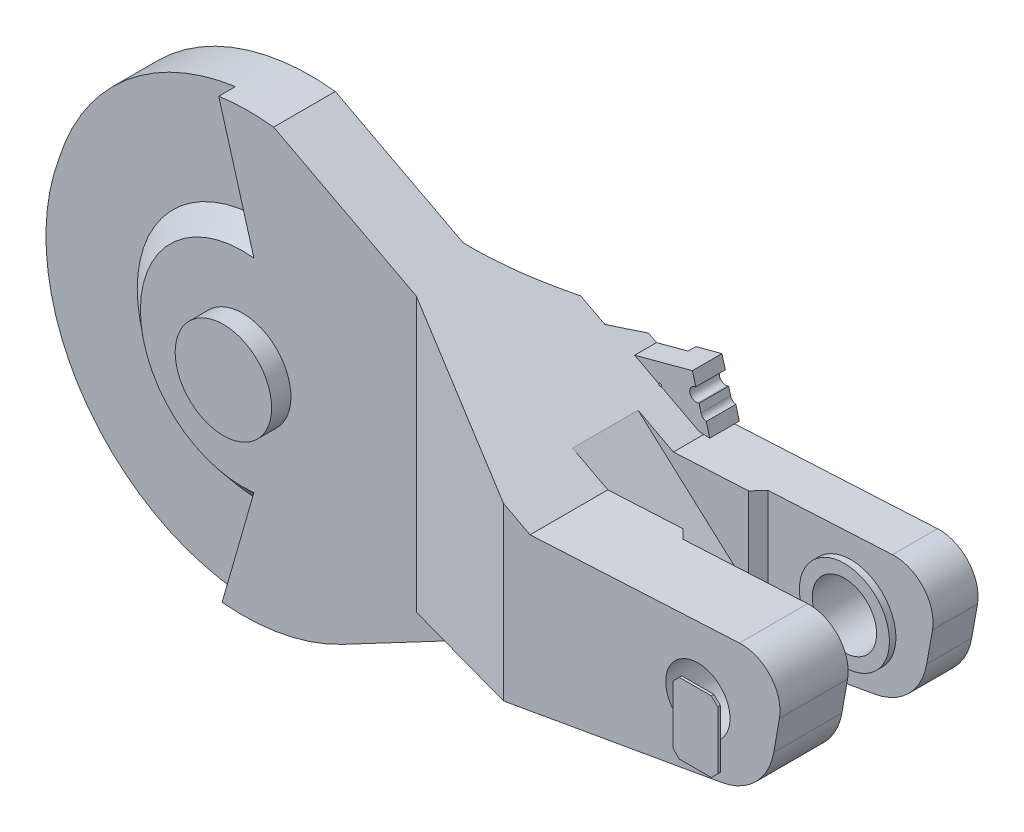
ISO-10303-21;
HEADER;
FILE_DESCRIPTION(('STEP AP214'),'2;1');
FILE_NAME('part.step','',(''),(''),'','','');
FILE_SCHEMA(('AUTOMOTIVE_DESIGN { 1 0 10303 214 1 1 1 1 }'));
ENDSEC;
DATA;
#1=APPLICATION_CONTEXT('core data for automotive mechanical design processes');
#2=APPLICATION_PROTOCOL_DEFINITION('international standard','automotive_design',2000,#1);
#3=PRODUCT_CONTEXT('',#1,'mechanical');
#4=PRODUCT('Part','Part','',(#3));
#5=PRODUCT_RELATED_PRODUCT_CATEGORY('part','',(#4));
#6=PRODUCT_DEFINITION_FORMATION('','',#4);
#7=PRODUCT_DEFINITION_CONTEXT('part definition',#1,'design');
#8=PRODUCT_DEFINITION('design','',#6,#7);
#9=PRODUCT_DEFINITION_SHAPE('','',#8);
#10=(LENGTH_UNIT() NAMED_UNIT(*) SI_UNIT(.MILLI.,.METRE.));
#11=(NAMED_UNIT(*) PLANE_ANGLE_UNIT() SI_UNIT($,.RADIAN.));
#12=(NAMED_UNIT(*) SI_UNIT($,.STERADIAN.) SOLID_ANGLE_UNIT());
#13=UNCERTAINTY_MEASURE_WITH_UNIT(LENGTH_MEASURE(1.E-05),#10,'distance_accuracy_value','');
#14=(GEOMETRIC_REPRESENTATION_CONTEXT(3) GLOBAL_UNCERTAINTY_ASSIGNED_CONTEXT((#13)) GLOBAL_UNIT_ASSIGNED_CONTEXT((#10,
#11,#12)) REPRESENTATION_CONTEXT('',''));
#15=CARTESIAN_POINT('',(0.,0.,0.));
#16=DIRECTION('',(0.,0.,1.));
#17=DIRECTION('',(1.,0.,0.));
#18=AXIS2_PLACEMENT_3D('',#15,#16,#17);
#19=CARTESIAN_POINT('',(433.906597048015,24.5766558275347,91.));
#20=DIRECTION('',(0.,0.,1.));
#21=DIRECTION('',(1.,0.,0.));
#22=AXIS2_PLACEMENT_3D('',#19,#20,#21);
#23=PLANE('',#22);
#24=DIRECTION('',(0.,1.,0.));
#25=VECTOR('',#24,1.);
#26=CARTESIAN_POINT('',(417.5,4.99999999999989,91.));
#27=LINE('',#26,#25);
#28=CARTESIAN_POINT('',(417.5,-40.,91.));
#29=VERTEX_POINT('',#28);
#30=CARTESIAN_POINT('',(417.5,-17.8535710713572,91.));
#31=VERTEX_POINT('',#30);
#32=EDGE_CURVE('E35',#29,#31,#27,.T.);
#33=ORIENTED_EDGE('',*,*,#32,.F.);
#34=DIRECTION('',(0.707106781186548,0.707106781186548,0.));
#35=VECTOR('',#34,1.);
#36=CARTESIAN_POINT('',(412.5,-45.,91.));
#37=LINE('',#36,#35);
#38=CARTESIAN_POINT('',(412.5,-45.,91.));
#39=VERTEX_POINT('',#38);
#40=EDGE_CURVE('E39',#39,#29,#37,.T.);
#41=ORIENTED_EDGE('',*,*,#40,.F.);
#42=DIRECTION('',(1.,0.,0.));
#43=VECTOR('',#42,1.);
#44=CARTESIAN_POINT('',(387.5,-45.,91.));
#45=LINE('',#44,#43);
#46=CARTESIAN_POINT('',(387.5,-45.,91.));
#47=VERTEX_POINT('',#46);
#48=EDGE_CURVE('E1507',#47,#39,#45,.T.);
#49=ORIENTED_EDGE('',*,*,#48,.F.);
#50=DIRECTION('',(0.707106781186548,-0.707106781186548,0.));
#51=VECTOR('',#50,1.);
#52=CARTESIAN_POINT('',(382.5,-40.,91.));
#53=LINE('',#52,#51);
#54=CARTESIAN_POINT('',(382.5,-40.,91.));
#55=VERTEX_POINT('',#54);
#56=EDGE_CURVE('E1504',#55,#47,#53,.T.);
#57=ORIENTED_EDGE('',*,*,#56,.F.);
#58=DIRECTION('',(0.,-1.,0.));
#59=VECTOR('',#58,1.);
#60=CARTESIAN_POINT('',(382.5,4.99999999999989,91.));
#61=LINE('',#60,#59);
#62=CARTESIAN_POINT('',(382.5,-17.853571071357,91.));
#63=VERTEX_POINT('',#62);
#64=EDGE_CURVE('E11',#63,#55,#61,.T.);
#65=ORIENTED_EDGE('',*,*,#64,.F.);
#66=CARTESIAN_POINT('',(400.,0.,91.));
#67=DIRECTION('',(0.,0.,1.));
#68=DIRECTION('',(1.,0.,0.));
#69=AXIS2_PLACEMENT_3D('',#66,#67,#68);
#70=CIRCLE('',#69,25.);
#71=EDGE_CURVE('E408',#31,#63,#70,.T.);
#72=ORIENTED_EDGE('',*,*,#71,.F.);
#73=EDGE_LOOP('',(#33,#41,#49,#57,#65,#72));
#74=FACE_BOUND('',#73,.T.);
#75=DIRECTION('',(0.984807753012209,0.173648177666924,0.));
#76=VECTOR('',#75,1.);
#77=CARTESIAN_POINT('',(135.,-96.3087100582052,91.));
#78=LINE('',#77,#76);
#79=CARTESIAN_POINT('',(248.853995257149,-76.2331788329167,91.));
#80=VERTEX_POINT('',#79);
#81=CARTESIAN_POINT('',(418.460664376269,-46.3269469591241,91.));
#82=VERTEX_POINT('',#81);
#83=EDGE_CURVE('E891',#80,#82,#78,.T.);
#84=ORIENTED_EDGE('',*,*,#83,.T.);
#85=CARTESIAN_POINT('',(409.778255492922,2.91344069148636,91.));
#86=DIRECTION('',(0.,0.,1.));
#87=DIRECTION('',(1.,0.,0.));
#88=AXIS2_PLACEMENT_3D('',#85,#86,#87);
#89=CIRCLE('',#88,50.);
#90=CARTESIAN_POINT('',(459.018643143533,-5.76896819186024,91.));
#91=VERTEX_POINT('',#90);
#92=EDGE_CURVE('E792',#82,#91,#89,.T.);
#93=ORIENTED_EDGE('',*,*,#92,.T.);
#94=DIRECTION('',(0.173648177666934,0.984807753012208,0.));
#95=VECTOR('',#94,1.);
#96=CARTESIAN_POINT('',(452.939154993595,-40.2474588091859,91.));
#97=LINE('',#96,#95);
#98=CARTESIAN_POINT('',(463.450829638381,19.3672104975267,91.));
#99=VERTEX_POINT('',#98);
#100=EDGE_CURVE('E889',#91,#99,#97,.T.);
#101=ORIENTED_EDGE('',*,*,#100,.T.);
#102=CARTESIAN_POINT('',(433.906597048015,24.5766558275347,91.));
#103=DIRECTION('',(0.,0.,1.));
#104=DIRECTION('',(1.,0.,0.));
#105=AXIS2_PLACEMENT_3D('',#102,#103,#104);
#106=CIRCLE('',#105,30.);
#107=CARTESIAN_POINT('',(432.336518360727,54.5355418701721,91.));
#108=VERTEX_POINT('',#107);
#109=EDGE_CURVE('E896',#99,#108,#106,.T.);
#110=ORIENTED_EDGE('',*,*,#109,.T.);
#111=DIRECTION('',(-0.998629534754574,-0.0523359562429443,0.));
#112=VECTOR('',#111,1.);
#113=CARTESIAN_POINT('',(432.336518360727,54.5355418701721,91.));
#114=LINE('',#113,#112);
#115=CARTESIAN_POINT('',(269.46867723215,46.,91.));
#116=VERTEX_POINT('',#115);
#117=EDGE_CURVE('E898',#108,#116,#114,.T.);
#118=ORIENTED_EDGE('',*,*,#117,.T.);
#119=DIRECTION('',(-0.88536896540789,0.464889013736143,0.));
#120=VECTOR('',#119,1.);
#121=CARTESIAN_POINT('',(176.495697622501,94.818197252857,91.));
#122=LINE('',#121,#120);
#123=CARTESIAN_POINT('',(248.853995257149,56.8243450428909,91.));
#124=VERTEX_POINT('',#123);
#125=EDGE_CURVE('E1012',#116,#124,#122,.T.);
#126=ORIENTED_EDGE('',*,*,#125,.T.);
#127=DIRECTION('',(0.,-1.,0.));
#128=VECTOR('',#127,1.);
#129=CARTESIAN_POINT('',(248.853995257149,-96.3087100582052,91.));
#130=LINE('',#129,#128);
#131=EDGE_CURVE('E936',#124,#80,#130,.T.);
#132=ORIENTED_EDGE('',*,*,#131,.T.);
#133=EDGE_LOOP('',(#84,#93,#101,#110,#118,#126,#132));
#134=FACE_BOUND('',#133,.T.);
#135=ADVANCED_FACE('F16',(#74,#134),#23,.T.);
#136=CARTESIAN_POINT('',(0.,0.,45.));
#137=DIRECTION('',(0.,0.,-1.));
#138=DIRECTION('',(-1.,0.,0.));
#139=AXIS2_PLACEMENT_3D('',#136,#137,#138);
#140=PLANE('',#139);
#141=DIRECTION('',(0.,-1.,0.));
#142=VECTOR('',#141,1.);
#143=CARTESIAN_POINT('',(135.,-96.3087100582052,45.));
#144=LINE('',#143,#142);
#145=CARTESIAN_POINT('',(135.,116.606733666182,45.));
#146=VERTEX_POINT('',#145);
#147=CARTESIAN_POINT('',(135.,-96.3087100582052,45.));
#148=VERTEX_POINT('',#147);
#149=EDGE_CURVE('E900',#146,#148,#144,.T.);
#150=ORIENTED_EDGE('',*,*,#149,.F.);
#151=DIRECTION('',(-0.885368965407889,0.464889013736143,0.));
#152=VECTOR('',#151,1.);
#153=CARTESIAN_POINT('',(269.46867723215,46.,45.));
#154=LINE('',#153,#152);
#155=CARTESIAN_POINT('',(24.0494383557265,174.864589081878,45.));
#156=VERTEX_POINT('',#155);
#157=EDGE_CURVE('E841',#146,#156,#154,.T.);
#158=ORIENTED_EDGE('',*,*,#157,.T.);
#159=CARTESIAN_POINT('',(4.89290463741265,7.87838391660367,45.));
#160=DIRECTION('',(0.,0.,-1.));
#161=DIRECTION('',(-1.,0.,0.));
#162=AXIS2_PLACEMENT_3D('',#159,#160,#161);
#163=CIRCLE('',#162,168.081425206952);
#164=CARTESIAN_POINT('',(-18.6042727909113,174.309294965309,45.));
#165=VERTEX_POINT('',#164);
#166=EDGE_CURVE('E1578',#165,#156,#163,.T.);
#167=ORIENTED_EDGE('',*,*,#166,.F.);
#168=DIRECTION('',(0.275637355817,-0.961261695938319,0.));
#169=VECTOR('',#168,1.);
#170=CARTESIAN_POINT('',(-16.,165.227116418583,45.));
#171=LINE('',#170,#169);
#172=CARTESIAN_POINT('',(8.71723441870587,79.0278760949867,45.));
#173=VERTEX_POINT('',#172);
#174=EDGE_CURVE('E1680',#165,#173,#171,.T.);
#175=ORIENTED_EDGE('',*,*,#174,.T.);
#176=CARTESIAN_POINT('',(0.,0.,45.));
#177=DIRECTION('',(0.,0.,-1.));
#178=DIRECTION('',(-1.,0.,0.));
#179=AXIS2_PLACEMENT_3D('',#176,#177,#178);
#180=CIRCLE('',#179,79.5072032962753);
#181=CARTESIAN_POINT('',(8.71723441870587,-79.0278760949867,45.));
#182=VERTEX_POINT('',#181);
#183=EDGE_CURVE('E579',#182,#173,#180,.T.);
#184=ORIENTED_EDGE('',*,*,#183,.F.);
#185=DIRECTION('',(-0.275637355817,-0.961261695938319,0.));
#186=VECTOR('',#185,1.);
#187=CARTESIAN_POINT('',(8.71723441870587,-79.0278760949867,45.));
#188=LINE('',#187,#186);
#189=CARTESIAN_POINT('',(-16.,-165.227116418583,45.));
#190=VERTEX_POINT('',#189);
#191=EDGE_CURVE('E906',#182,#190,#188,.T.);
#192=ORIENTED_EDGE('',*,*,#191,.T.);
#193=CARTESIAN_POINT('',(0.,0.,45.));
#194=DIRECTION('',(0.,0.,1.));
#195=DIRECTION('',(1.,0.,0.));
#196=AXIS2_PLACEMENT_3D('',#193,#194,#195);
#197=CIRCLE('',#196,166.);
#198=CARTESIAN_POINT('',(77.7295013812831,-146.676939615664,45.));
#199=VERTEX_POINT('',#198);
#200=EDGE_CURVE('E947',#190,#199,#197,.T.);
#201=ORIENTED_EDGE('',*,*,#200,.T.);
#202=DIRECTION('',(0.884035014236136,0.4674206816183,0.));
#203=VECTOR('',#202,1.);
#204=CARTESIAN_POINT('',(192.,-86.258072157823,45.));
#205=LINE('',#204,#203);
#206=CARTESIAN_POINT('',(192.,-86.258072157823,45.));
#207=VERTEX_POINT('',#206);
#208=EDGE_CURVE('E838',#199,#207,#205,.T.);
#209=ORIENTED_EDGE('',*,*,#208,.T.);
#210=DIRECTION('',(0.984807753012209,0.173648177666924,0.));
#211=VECTOR('',#210,1.);
#212=CARTESIAN_POINT('',(135.,-96.3087100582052,45.));
#213=LINE('',#212,#211);
#214=EDGE_CURVE('E907',#148,#207,#213,.T.);
#215=ORIENTED_EDGE('',*,*,#214,.F.);
#216=EDGE_LOOP('',(#150,#158,#167,#175,#184,#192,#201,#209,#215));
#217=FACE_BOUND('',#216,.T.);
#218=CARTESIAN_POINT('',(0.,0.,45.));
#219=DIRECTION('',(0.,0.,-1.));
#220=DIRECTION('',(-1.,0.,0.));
#221=AXIS2_PLACEMENT_3D('',#218,#219,#220);
#222=CIRCLE('',#221,37.5);
#223=CARTESIAN_POINT('',(-37.5,0.,45.));
#224=VERTEX_POINT('',#223);
#225=EDGE_CURVE('E26',#224,#224,#222,.F.);
#226=ORIENTED_EDGE('',*,*,#225,.F.);
#227=EDGE_LOOP('',(#226));
#228=FACE_BOUND('',#227,.T.);
#229=ADVANCED_FACE('F549',(#217,#228),#140,.F.);
#230=CARTESIAN_POINT('',(269.46867723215,46.,45.));
#231=DIRECTION('',(-0.464889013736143,-0.885368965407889,0.));
#232=DIRECTION('',(0.88536896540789,-0.464889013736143,0.));
#233=AXIS2_PLACEMENT_3D('',#230,#231,#232);
#234=PLANE('',#233);
#235=DIRECTION('',(0.88536896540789,-0.464889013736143,0.));
#236=VECTOR('',#235,1.);
#237=CARTESIAN_POINT('',(269.46867723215,46.,-60.));
#238=LINE('',#237,#236);
#239=CARTESIAN_POINT('',(210.53450626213,76.9451197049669,-60.));
#240=VERTEX_POINT('',#239);
#241=CARTESIAN_POINT('',(216.843769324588,73.6322555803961,-60.));
#242=VERTEX_POINT('',#241);
#243=EDGE_CURVE('E714',#240,#242,#238,.T.);
#244=ORIENTED_EDGE('',*,*,#243,.F.);
#245=CARTESIAN_POINT('',(212.806162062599,75.7523200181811,-63.0002));
#246=CARTESIAN_POINT('',(211.402032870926,76.4895993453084,-61.1373015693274));
#247=CARTESIAN_POINT('',(209.991103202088,77.230449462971,-59.2809229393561));
#248=CARTESIAN_POINT('',(207.154787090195,78.7197406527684,-55.5826130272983));
#249=CARTESIAN_POINT('',(205.729401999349,79.4681810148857,-53.7406804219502));
#250=CARTESIAN_POINT('',(202.863046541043,80.9732452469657,-50.0723081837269));
#251=CARTESIAN_POINT('',(201.422076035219,81.7298691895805,-48.2458686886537));
#252=CARTESIAN_POINT('',(198.52330330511,83.2519550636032,-44.6098073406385));
#253=CARTESIAN_POINT('',(197.065499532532,84.0174178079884,-42.8001870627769));
#254=CARTESIAN_POINT('',(195.598783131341,84.7875603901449,-40.9998));
#255=B_SPLINE_CURVE_WITH_KNOTS('',3,(#245,#246,#247,#248,#249,#250,#251,#252,#253,#254),
.UNSPECIFIED.,.F.,.F.,(4,2,2,2,4),(0.,7.33961538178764,14.6785504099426,22.0175506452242,
29.3572313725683),.UNSPECIFIED.);
#256=CARTESIAN_POINT('',(195.598946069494,84.7874748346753,-41.));
#257=VERTEX_POINT('',#256);
#258=EDGE_CURVE('E815',#240,#257,#255,.T.);
#259=ORIENTED_EDGE('',*,*,#258,.T.);
#260=DIRECTION('',(-0.88536896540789,0.464889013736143,0.));
#261=VECTOR('',#260,1.);
#262=CARTESIAN_POINT('',(269.46867723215,46.,-41.));
#263=LINE('',#262,#261);
#264=CARTESIAN_POINT('',(176.89857173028,94.606656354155,-41.));
#265=VERTEX_POINT('',#264);
#266=EDGE_CURVE('E961',#257,#265,#263,.T.);
#267=ORIENTED_EDGE('',*,*,#266,.T.);
#268=CARTESIAN_POINT('',(291.812783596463,34.2675698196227,-174.117716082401));
#269=CARTESIAN_POINT('',(290.48857406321,34.9628849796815,-172.355273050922));
#270=CARTESIAN_POINT('',(289.162095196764,35.6593917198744,-170.595006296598));
#271=CARTESIAN_POINT('',(286.504372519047,37.0549071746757,-167.079063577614));
#272=CARTESIAN_POINT('',(285.17312870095,37.7539158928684,-165.323387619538));
#273=CARTESIAN_POINT('',(281.171881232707,39.8548885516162,-160.063565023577));
#274=CARTESIAN_POINT('',(278.49439617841,41.2607808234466,-156.566669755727));
#275=CARTESIAN_POINT('',(273.116639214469,44.0845302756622,-149.593347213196));
#276=CARTESIAN_POINT('',(270.41636035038,45.5023911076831,-146.116926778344));
#277=CARTESIAN_POINT('',(264.991586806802,48.3508279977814,-139.188280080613));
#278=CARTESIAN_POINT('',(262.267092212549,49.7814040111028,-135.73605373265));
#279=CARTESIAN_POINT('',(256.762652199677,52.6716721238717,-128.822861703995));
#280=CARTESIAN_POINT('',(253.98242485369,54.1315122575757,-125.362182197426));
#281=CARTESIAN_POINT('',(248.391517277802,57.0671827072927,-118.472310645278));
#282=CARTESIAN_POINT('',(245.580836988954,58.5430130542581,-115.043118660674));
#283=CARTESIAN_POINT('',(239.925884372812,61.5123122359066,-108.221095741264));
#284=CARTESIAN_POINT('',(237.081616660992,63.0057786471,-104.828259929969));
#285=CARTESIAN_POINT('',(231.355044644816,66.0126837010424,-98.083750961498));
#286=CARTESIAN_POINT('',(228.472740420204,67.52612230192,-94.7320777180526));
#287=CARTESIAN_POINT('',(222.782164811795,70.5141263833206,-88.2101355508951));
#288=CARTESIAN_POINT('',(219.97557849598,71.9878070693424,-85.0379924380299));
#289=CARTESIAN_POINT('',(214.318152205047,74.9584051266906,-78.744303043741));
#290=CARTESIAN_POINT('',(211.467312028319,76.4553226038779,-75.6227569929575));
#291=CARTESIAN_POINT('',(207.153169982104,78.7205897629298,-70.9841720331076));
#292=CARTESIAN_POINT('',(205.708522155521,79.4791445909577,-69.4449686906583));
#293=CARTESIAN_POINT('',(202.805977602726,81.0032109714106,-66.3825893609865));
#294=CARTESIAN_POINT('',(201.348080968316,81.7687224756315,-64.8594132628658));
#295=CARTESIAN_POINT('',(198.418199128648,83.3071431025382,-61.8304359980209));
#296=CARTESIAN_POINT('',(196.946213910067,84.0800522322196,-60.3246348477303));
#297=CARTESIAN_POINT('',(193.98726994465,85.6337327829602,-57.331939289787));
#298=CARTESIAN_POINT('',(192.50031133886,86.4145041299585,-55.8450447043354));
#299=CARTESIAN_POINT('',(189.515156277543,87.9819475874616,-52.8964946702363));
#300=CARTESIAN_POINT('',(188.017010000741,88.7685933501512,-51.4347744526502));
#301=CARTESIAN_POINT('',(185.003848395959,90.3507424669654,-48.533666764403));
#302=CARTESIAN_POINT('',(183.488833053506,91.1462458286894,-47.0942793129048));
#303=CARTESIAN_POINT('',(180.44074940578,92.7467317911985,-44.2398507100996));
#304=CARTESIAN_POINT('',(178.907679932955,93.5517150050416,-42.8248111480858));
#305=CARTESIAN_POINT('',(175.822435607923,95.1717132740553,-40.0215426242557));
#306=CARTESIAN_POINT('',(174.270260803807,95.9867283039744,-38.6333135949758));
#307=CARTESIAN_POINT('',(171.14662090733,97.626887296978,-35.8872331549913));
#308=CARTESIAN_POINT('',(169.575169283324,98.4520241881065,-34.529362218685));
#309=CARTESIAN_POINT('',(166.410678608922,100.113633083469,-31.8460240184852));
#310=CARTESIAN_POINT('',(164.817639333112,100.950105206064,-30.5205570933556));
#311=CARTESIAN_POINT('',(161.608903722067,102.634946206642,-27.905599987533));
#312=CARTESIAN_POINT('',(159.99321068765,103.483313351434,-26.6161046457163));
#313=CARTESIAN_POINT('',(156.737655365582,105.192738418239,-24.0767311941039));
#314=CARTESIAN_POINT('',(155.097793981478,106.053795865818,-22.8268516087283));
#315=CARTESIAN_POINT('',(151.880745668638,107.743001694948,-20.436504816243));
#316=CARTESIAN_POINT('',(150.304887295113,108.570452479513,-19.2937589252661));
#317=CARTESIAN_POINT('',(147.129174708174,110.237953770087,-17.0516350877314));
#318=CARTESIAN_POINT('',(145.529320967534,111.078004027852,-15.9522562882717));
#319=CARTESIAN_POINT('',(142.304398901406,112.771344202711,-13.8012606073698));
#320=CARTESIAN_POINT('',(140.679328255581,113.624635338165,-12.7496481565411));
#321=CARTESIAN_POINT('',(137.403193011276,115.344866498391,-10.6992934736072));
#322=CARTESIAN_POINT('',(135.752128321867,116.211806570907,-9.70055142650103));
#323=CARTESIAN_POINT('',(132.424602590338,117.959021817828,-7.76221212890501));
#324=CARTESIAN_POINT('',(130.748162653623,118.839285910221,-6.82256875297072));
#325=CARTESIAN_POINT('',(127.368151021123,120.614060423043,-5.00754055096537));
#326=CARTESIAN_POINT('',(125.664579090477,121.508570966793,-4.13215628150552));
#327=CARTESIAN_POINT('',(122.230479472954,123.311745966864,-2.45219474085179));
#328=CARTESIAN_POINT('',(120.499955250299,124.220408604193,-1.64760845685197));
#329=CARTESIAN_POINT('',(117.012248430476,126.051731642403,-0.115945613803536));
#330=CARTESIAN_POINT('',(115.255067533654,126.974391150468,0.61113586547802));
#331=CARTESIAN_POINT('',(112.01551221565,128.675414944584,1.86457378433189));
#332=CARTESIAN_POINT('',(110.537115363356,129.451690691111,2.40405344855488));
#333=CARTESIAN_POINT('',(107.563770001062,131.012933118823,3.42072186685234));
#334=CARTESIAN_POINT('',(106.068823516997,131.797898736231,3.89791815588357));
#335=CARTESIAN_POINT('',(103.06359146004,133.375884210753,4.78618413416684));
#336=CARTESIAN_POINT('',(101.553306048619,134.168903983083,5.19725451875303));
#337=CARTESIAN_POINT('',(98.5191306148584,135.762087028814,5.94961797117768));
#338=CARTESIAN_POINT('',(96.9952405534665,136.562250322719,6.29091083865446));
#339=CARTESIAN_POINT('',(93.938628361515,138.167214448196,6.8999246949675));
#340=CARTESIAN_POINT('',(92.4059257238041,138.972005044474,7.16777015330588));
#341=CARTESIAN_POINT('',(89.3316380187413,140.586250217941,7.62793533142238));
#342=CARTESIAN_POINT('',(87.7900529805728,141.395704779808,7.82025529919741));
#343=CARTESIAN_POINT('',(84.7008285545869,143.017792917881,8.12732048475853));
#344=CARTESIAN_POINT('',(83.1531891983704,143.830426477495,8.24206610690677));
#345=CARTESIAN_POINT('',(80.0548959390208,145.457276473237,8.39272188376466));
#346=CARTESIAN_POINT('',(78.5042420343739,146.271492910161,8.42863199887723));
#347=CARTESIAN_POINT('',(75.3989247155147,147.902031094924,8.42120498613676));
#348=CARTESIAN_POINT('',(73.8442616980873,148.718352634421,8.37765512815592));
#349=CARTESIAN_POINT('',(70.7382680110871,150.349245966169,8.211381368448));
#350=CARTESIAN_POINT('',(69.1869373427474,151.163817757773,8.08865743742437));
#351=CARTESIAN_POINT('',(66.0906623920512,152.789607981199,7.76538962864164));
#352=CARTESIAN_POINT('',(64.545718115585,153.600826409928,7.5648456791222));
#353=CARTESIAN_POINT('',(61.4650306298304,155.218431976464,7.08807658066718));
#354=CARTESIAN_POINT('',(59.9292874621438,156.024819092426,6.81185108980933));
#355=CARTESIAN_POINT('',(56.8678029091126,157.632341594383,6.18617682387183));
#356=CARTESIAN_POINT('',(55.3420745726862,158.433470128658,5.83664681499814));
#357=CARTESIAN_POINT('',(52.3044969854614,160.028439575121,5.06789563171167));
#358=CARTESIAN_POINT('',(50.7926476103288,160.822280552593,4.64867508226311));
#359=CARTESIAN_POINT('',(47.7844211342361,162.401838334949,3.74421864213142));
#360=CARTESIAN_POINT('',(46.28804516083,163.187554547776,3.25897797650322));
#361=CARTESIAN_POINT('',(43.3121408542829,164.750140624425,2.22643303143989));
#362=CARTESIAN_POINT('',(41.8326136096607,165.527009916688,1.67912476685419));
#363=CARTESIAN_POINT('',(38.1051864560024,167.484205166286,0.218368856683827));
#364=CARTESIAN_POINT('',(35.8693115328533,168.658217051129,-0.734410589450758));
#365=CARTESIAN_POINT('',(31.4413830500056,170.983231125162,-2.76216539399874));
#366=CARTESIAN_POINT('',(29.2493355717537,172.134230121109,-3.83715757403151));
#367=CARTESIAN_POINT('',(24.9083824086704,174.413575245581,-6.09610719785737));
#368=CARTESIAN_POINT('',(22.7595011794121,175.541908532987,-7.28012439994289));
#369=CARTESIAN_POINT('',(18.505446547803,177.775625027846,-9.74388751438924));
#370=CARTESIAN_POINT('',(16.4002717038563,178.881008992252,-11.0236302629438));
#371=CARTESIAN_POINT('',(12.21293920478,181.079691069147,-13.679593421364));
#372=CARTESIAN_POINT('',(10.1311681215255,182.172786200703,-15.0565891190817));
#373=CARTESIAN_POINT('',(6.00840361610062,184.337564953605,-17.886191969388));
#374=CARTESIAN_POINT('',(3.96741036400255,185.409248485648,-19.3387994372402));
#375=CARTESIAN_POINT('',(-0.0753692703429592,187.532028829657,-22.310039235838));
#376=CARTESIAN_POINT('',(-2.07717014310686,188.583133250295,-23.8286464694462));
#377=CARTESIAN_POINT('',(-6.04480440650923,190.666456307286,-26.9245839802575));
#378=CARTESIAN_POINT('',(-8.01063740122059,191.698674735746,-28.5019149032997));
#379=CARTESIAN_POINT('',(-12.3308830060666,193.967146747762,-32.0557325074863));
#380=CARTESIAN_POINT('',(-14.6772520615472,195.199176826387,-34.0446861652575));
#381=CARTESIAN_POINT('',(-19.3247108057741,197.639461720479,-38.0891415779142));
#382=CARTESIAN_POINT('',(-21.6257975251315,198.847714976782,-40.14464767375));
#383=CARTESIAN_POINT('',(-26.1871032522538,201.242762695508,-44.3139408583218));
#384=CARTESIAN_POINT('',(-28.4473117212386,202.429551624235,-46.4277426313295));
#385=CARTESIAN_POINT('',(-32.9298744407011,204.783253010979,-50.7057649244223));
#386=CARTESIAN_POINT('',(-35.1522294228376,205.950165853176,-52.8699844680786));
#387=CARTESIAN_POINT('',(-39.5665960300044,208.268058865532,-57.2468073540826));
#388=CARTESIAN_POINT('',(-41.7585430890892,209.419005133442,-59.4594936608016));
#389=CARTESIAN_POINT('',(-46.1108855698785,211.704330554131,-63.9240814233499));
#390=CARTESIAN_POINT('',(-48.2712808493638,212.838709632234,-66.1759830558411));
#391=CARTESIAN_POINT('',(-52.5629694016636,215.092186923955,-70.7142296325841));
#392=CARTESIAN_POINT('',(-54.6942664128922,216.211287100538,-73.0005700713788));
#393=CARTESIAN_POINT('',(-58.9305018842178,218.435647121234,-77.6041568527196));
#394=CARTESIAN_POINT('',(-61.035440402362,219.540906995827,-79.921403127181));
#395=CARTESIAN_POINT('',(-65.118241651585,221.684701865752,-84.4688815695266));
#396=CARTESIAN_POINT('',(-67.0972627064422,222.72384507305,-86.6977882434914));
#397=CARTESIAN_POINT('',(-71.0351878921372,224.791568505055,-91.1781423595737));
#398=CARTESIAN_POINT('',(-72.994092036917,225.820148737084,-93.4295897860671));
#399=CARTESIAN_POINT('',(-76.8934168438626,227.867603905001,-97.9529917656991));
#400=CARTESIAN_POINT('',(-78.8338366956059,228.886478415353,-100.22494720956));
#401=CARTESIAN_POINT('',(-82.6975108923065,230.915214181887,-104.787404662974));
#402=CARTESIAN_POINT('',(-84.6207651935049,231.925075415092,-107.077906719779));
#403=CARTESIAN_POINT('',(-88.4425238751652,233.93180220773,-111.665185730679));
#404=CARTESIAN_POINT('',(-90.3411015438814,234.928706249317,-113.961884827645));
#405=CARTESIAN_POINT('',(-94.1236376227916,236.914838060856,-118.570593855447));
#406=CARTESIAN_POINT('',(-96.007596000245,237.904065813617,-120.88260382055));
#407=CARTESIAN_POINT('',(-99.7616600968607,239.875247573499,-125.520323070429));
#408=CARTESIAN_POINT('',(-101.631767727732,240.85720258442,-127.846030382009));
#409=CARTESIAN_POINT('',(-105.359300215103,242.814453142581,-132.510336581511));
#410=CARTESIAN_POINT('',(-107.216725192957,243.789748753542,-134.848935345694));
#411=CARTESIAN_POINT('',(-109.068277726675,244.761960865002,-137.193437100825));
#412=B_SPLINE_CURVE_WITH_KNOTS('',3,(#268,#269,#270,#271,#272,#273,#274,#275,#276,#277,#278,
#279,#280,#281,#282,#283,#284,#285,#286,#287,#288,#289,#290,#291,#292,#293,#294,#295,#296,#297,
#298,#299,#300,#301,#302,#303,#304,#305,#306,#307,#308,#309,#310,#311,#312,#313,#314,#315,#316,
#317,#318,#319,#320,#321,#322,#323,#324,#325,#326,#327,#328,#329,#330,#331,#332,#333,#334,#335,
#336,#337,#338,#339,#340,#341,#342,#343,#344,#345,#346,#347,#348,#349,#350,#351,#352,#353,#354,
#355,#356,#357,#358,#359,#360,#361,#362,#363,#364,#365,#366,#367,#368,#369,#370,#371,#372,#373,
#374,#375,#376,#377,#378,#379,#380,#381,#382,#383,#384,#385,#386,#387,#388,#389,#390,#391,#392,
#393,#394,#395,#396,#397,#398,#399,#400,#401,#402,#403,#404,#405,#406,#407,#408,#409,#410,#411),
.UNSPECIFIED.,.F.,.F.,(4,2,2,2,2,2,2,2,2,2,2,2,2,2,2,2,2,2,2,2,2,2,2,2,2,2,2,2,2,2,2,2,2,2,2,2,
2,2,2,2,2,2,2,2,2,2,2,2,2,2,2,2,2,2,2,2,2,2,2,2,2,2,2,2,2,2,2,2,2,2,2,4),(0.,6.93460377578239,
13.8692174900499,27.7386262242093,41.6124316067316,55.4861881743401,69.5050366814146,
83.5239123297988,97.5408834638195,111.557825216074,125.010995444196,138.464226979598,
145.193480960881,151.92268834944,158.651902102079,165.381052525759,172.088997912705,
178.796949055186,185.505336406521,192.213706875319,198.917630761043,205.621624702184,
212.324651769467,219.027428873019,225.37232488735,231.71709605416,238.0624545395,
244.407835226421,250.748200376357,257.088620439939,263.428232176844,269.767441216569,
275.030713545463,280.29334853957,285.55592819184,290.818522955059,296.072143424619,
301.32574664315,306.579322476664,311.832900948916,317.100564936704,322.36823087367,
327.635901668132,332.903596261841,338.177159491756,343.450675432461,348.724572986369,
353.99880935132,362.092343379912,370.186992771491,378.286105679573,386.384951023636,
394.557863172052,402.73080940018,410.900674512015,419.070629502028,429.009874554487,
438.94976921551,448.892190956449,458.834420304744,468.795255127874,478.75613483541,
488.715722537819,498.675288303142,508.145029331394,517.614763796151,527.084911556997,
536.555083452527,545.981510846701,555.407959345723,564.833081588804,574.258113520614),.UNSPECIFIED.);
#413=CARTESIAN_POINT('',(123.346772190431,122.725603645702,-2.99999999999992));
#414=VERTEX_POINT('',#413);
#415=EDGE_CURVE('E975',#265,#414,#412,.T.);
#416=ORIENTED_EDGE('',*,*,#415,.T.);
#417=DIRECTION('',(-0.885368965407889,0.464889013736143,0.));
#418=VECTOR('',#417,1.);
#419=CARTESIAN_POINT('',(24.0494383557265,174.864589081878,-3.));
#420=LINE('',#419,#418);
#421=CARTESIAN_POINT('',(24.0494383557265,174.864589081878,-3.));
#422=VERTEX_POINT('',#421);
#423=EDGE_CURVE('E1586',#414,#422,#420,.T.);
#424=ORIENTED_EDGE('',*,*,#423,.T.);
#425=DIRECTION('',(0.,0.,-1.));
#426=VECTOR('',#425,1.);
#427=CARTESIAN_POINT('',(24.0494383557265,174.864589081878,305.946692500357));
#428=LINE('',#427,#426);
#429=EDGE_CURVE('E1580',#156,#422,#428,.T.);
#430=ORIENTED_EDGE('',*,*,#429,.F.);
#431=ORIENTED_EDGE('',*,*,#157,.F.);
#432=DIRECTION('',(-0.833638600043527,0.437726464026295,-0.336811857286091));
#433=VECTOR('',#432,1.);
#434=CARTESIAN_POINT('',(92.6651217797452,138.83590653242,27.8955989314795));
#435=LINE('',#434,#433);
#436=EDGE_CURVE('E1007',#124,#146,#435,.T.);
#437=ORIENTED_EDGE('',*,*,#436,.F.);
#438=ORIENTED_EDGE('',*,*,#125,.F.);
#439=DIRECTION('',(0.,0.,-1.));
#440=VECTOR('',#439,1.);
#441=CARTESIAN_POINT('',(269.46867723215,46.,45.));
#442=LINE('',#441,#440);
#443=CARTESIAN_POINT('',(269.46867723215,46.,30.5));
#444=VERTEX_POINT('',#443);
#445=EDGE_CURVE('E835',#116,#444,#442,.T.);
#446=ORIENTED_EDGE('',*,*,#445,.T.);
#447=DIRECTION('',(0.885368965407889,-0.464889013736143,0.));
#448=VECTOR('',#447,1.);
#449=CARTESIAN_POINT('',(242.030669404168,60.4071329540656,30.5));
#450=LINE('',#449,#448);
#451=CARTESIAN_POINT('',(242.030669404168,60.4071329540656,30.5));
#452=VERTEX_POINT('',#451);
#453=EDGE_CURVE('E1029',#452,#444,#450,.T.);
#454=ORIENTED_EDGE('',*,*,#453,.F.);
#455=DIRECTION('',(0.,0.,-1.));
#456=VECTOR('',#455,1.);
#457=CARTESIAN_POINT('',(242.030669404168,60.4071329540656,38.));
#458=LINE('',#457,#456);
#459=CARTESIAN_POINT('',(242.030669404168,60.4071329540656,-20.5));
#460=VERTEX_POINT('',#459);
#461=EDGE_CURVE('E1056',#452,#460,#458,.T.);
#462=ORIENTED_EDGE('',*,*,#461,.T.);
#463=DIRECTION('',(-0.885368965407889,0.464889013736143,0.));
#464=VECTOR('',#463,1.);
#465=CARTESIAN_POINT('',(269.46867723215,46.,-20.5));
#466=LINE('',#465,#464);
#467=CARTESIAN_POINT('',(269.46867723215,46.,-20.5));
#468=VERTEX_POINT('',#467);
#469=EDGE_CURVE('E1024',#468,#460,#466,.T.);
#470=ORIENTED_EDGE('',*,*,#469,.F.);
#471=CARTESIAN_POINT('',(269.46867723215,46.,-63.));
#472=VERTEX_POINT('',#471);
#473=EDGE_CURVE('E840',#468,#472,#442,.T.);
#474=ORIENTED_EDGE('',*,*,#473,.T.);
#475=DIRECTION('',(0.885368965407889,-0.464889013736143,0.));
#476=VECTOR('',#475,1.);
#477=CARTESIAN_POINT('',(77.1715762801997,146.97124825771,-63.));
#478=LINE('',#477,#476);
#479=CARTESIAN_POINT('',(266.956653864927,47.3190117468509,-63.));
#480=VERTEX_POINT('',#479);
#481=EDGE_CURVE('E1568',#480,#472,#478,.T.);
#482=ORIENTED_EDGE('',*,*,#481,.F.);
#483=DIRECTION('',(0.,0.,1.));
#484=VECTOR('',#483,1.);
#485=CARTESIAN_POINT('',(266.956653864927,47.3190117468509,45.));
#486=LINE('',#485,#484);
#487=CARTESIAN_POINT('',(266.956653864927,47.3190117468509,-43.));
#488=VERTEX_POINT('',#487);
#489=EDGE_CURVE('E1560',#480,#488,#486,.T.);
#490=ORIENTED_EDGE('',*,*,#489,.T.);
#491=DIRECTION('',(-0.885368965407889,0.464889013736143,0.));
#492=VECTOR('',#491,1.);
#493=CARTESIAN_POINT('',(269.46867723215,46.,-43.));
#494=LINE('',#493,#492);
#495=CARTESIAN_POINT('',(237.605662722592,62.7306128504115,-43.));
#496=VERTEX_POINT('',#495);
#497=EDGE_CURVE('E786',#488,#496,#494,.T.);
#498=ORIENTED_EDGE('',*,*,#497,.T.);
#499=CARTESIAN_POINT('',(240.560041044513,61.1793296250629,-45.0002));
#500=CARTESIAN_POINT('',(240.239160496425,61.3478173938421,-44.7825814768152));
#501=CARTESIAN_POINT('',(239.918278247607,61.5163060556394,-44.5649661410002));
#502=CARTESIAN_POINT('',(239.436868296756,61.769084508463,-44.2386048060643));
#503=CARTESIAN_POINT('',(239.276364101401,61.853361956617,-44.129814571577));
#504=CARTESIAN_POINT('',(238.955332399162,62.0219290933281,-43.9122774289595));
#505=CARTESIAN_POINT('',(238.794804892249,62.1062187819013,-43.8035305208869));
#506=CARTESIAN_POINT('',(238.468196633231,62.277714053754,-43.5823924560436));
#507=CARTESIAN_POINT('',(238.302114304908,62.3649204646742,-43.4700042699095));
#508=CARTESIAN_POINT('',(237.969852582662,62.5393842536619,-43.245412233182));
#509=CARTESIAN_POINT('',(237.803673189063,62.6266416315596,-43.1332083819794));
#510=CARTESIAN_POINT('',(237.551135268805,62.7592440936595,-42.9633104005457));
#511=CARTESIAN_POINT('',(237.46489207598,62.8045286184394,-42.9053979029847));
#512=CARTESIAN_POINT('',(237.335356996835,62.8725448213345,-42.8188128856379));
#513=CARTESIAN_POINT('',(237.292142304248,62.8952359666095,-42.7899932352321));
#514=CARTESIAN_POINT('',(237.205624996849,62.9406644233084,-42.7325246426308));
#515=CARTESIAN_POINT('',(237.162322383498,62.9634017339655,-42.7038756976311));
#516=CARTESIAN_POINT('',(237.073596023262,63.0099901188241,-42.6455863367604));
#517=CARTESIAN_POINT('',(237.028165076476,63.0338449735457,-42.6159598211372));
#518=CARTESIAN_POINT('',(236.959750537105,63.0697680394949,-42.5721040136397));
#519=CARTESIAN_POINT('',(236.936911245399,63.0817604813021,-42.5575890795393));
#520=CARTESIAN_POINT('',(236.8910737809,63.1058287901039,-42.5288899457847));
#521=CARTESIAN_POINT('',(236.868075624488,63.1179046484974,-42.5147057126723));
#522=CARTESIAN_POINT('',(236.819650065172,63.1433319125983,-42.4856099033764));
#523=CARTESIAN_POINT('',(236.794195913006,63.1566973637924,-42.4707536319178));
#524=CARTESIAN_POINT('',(236.755452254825,63.1770408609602,-42.44960656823));
#525=CARTESIAN_POINT('',(236.742415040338,63.1838864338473,-42.442733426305));
#526=CARTESIAN_POINT('',(236.716087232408,63.1977106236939,-42.4296436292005));
#527=CARTESIAN_POINT('',(236.702796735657,63.2046891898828,-42.423426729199));
#528=CARTESIAN_POINT('',(236.67354331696,63.2200495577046,-42.4110901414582));
#529=CARTESIAN_POINT('',(236.657511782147,63.2284673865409,-42.405168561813));
#530=CARTESIAN_POINT('',(236.624958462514,63.2455604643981,-42.3961549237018));
#531=CARTESIAN_POINT('',(236.608444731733,63.2542314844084,-42.3930301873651));
#532=CARTESIAN_POINT('',(236.583392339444,63.2673859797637,-42.3913603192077));
#533=CARTESIAN_POINT('',(236.574930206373,63.2718292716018,-42.3913178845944));
#534=CARTESIAN_POINT('',(236.558051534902,63.2806919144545,-42.3922600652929));
#535=CARTESIAN_POINT('',(236.549635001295,63.2851112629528,-42.393244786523));
#536=CARTESIAN_POINT('',(236.532836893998,63.2939316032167,-42.3961303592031));
#537=CARTESIAN_POINT('',(236.524456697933,63.2983318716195,-42.3980410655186));
#538=CARTESIAN_POINT('',(236.507853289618,63.307049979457,-42.4025851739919));
#539=CARTESIAN_POINT('',(236.499630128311,63.3113677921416,-42.4052188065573));
#540=CARTESIAN_POINT('',(236.477751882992,63.3228556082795,-42.4130052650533));
#541=CARTESIAN_POINT('',(236.464235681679,63.3299526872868,-42.418647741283));
#542=CARTESIAN_POINT('',(236.43751740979,63.3439819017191,-42.4308221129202));
#543=CARTESIAN_POINT('',(236.424315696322,63.3509138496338,-42.437354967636));
#544=CARTESIAN_POINT('',(236.384966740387,63.3715751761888,-42.4577679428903));
#545=CARTESIAN_POINT('',(236.359142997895,63.3851346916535,-42.4724338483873));
#546=CARTESIAN_POINT('',(236.307770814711,63.4121091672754,-42.5026869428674));
#547=CARTESIAN_POINT('',(236.282224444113,63.4255230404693,-42.5182784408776));
#548=CARTESIAN_POINT('',(236.23139796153,63.4522109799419,-42.5498835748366));
#549=CARTESIAN_POINT('',(236.206117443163,63.4654852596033,-42.5658963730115));
#550=CARTESIAN_POINT('',(236.131090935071,63.504880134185,-42.6138934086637));
#551=CARTESIAN_POINT('',(236.08152221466,63.5309076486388,-42.6462283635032));
#552=CARTESIAN_POINT('',(235.982576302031,63.5828621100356,-42.7112733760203));
#553=CARTESIAN_POINT('',(235.933199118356,63.6087890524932,-42.743983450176));
#554=CARTESIAN_POINT('',(235.834510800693,63.6606082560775,-42.8096271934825));
#555=CARTESIAN_POINT('',(235.785199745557,63.6865004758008,-42.8425610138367));
#556=CARTESIAN_POINT('',(235.686637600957,63.7382534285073,-42.9085405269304));
#557=CARTESIAN_POINT('',(235.63738651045,63.7641141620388,-42.9415862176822));
#558=CARTESIAN_POINT('',(235.490291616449,63.8413506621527,-43.0404204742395));
#559=CARTESIAN_POINT('',(235.392501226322,63.8926983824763,-43.1063104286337));
#560=CARTESIAN_POINT('',(235.197009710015,63.9953469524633,-43.2381976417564));
#561=CARTESIAN_POINT('',(235.099308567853,64.0466478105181,-43.3041948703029));
#562=CARTESIAN_POINT('',(234.802013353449,64.2027514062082,-43.505155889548));
#563=CARTESIAN_POINT('',(234.602475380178,64.3075246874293,-43.6402255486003));
#564=CARTESIAN_POINT('',(234.203433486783,64.5170533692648,-43.9104797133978));
#565=CARTESIAN_POINT('',(234.003929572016,64.6218087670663,-44.0456642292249));
#566=CARTESIAN_POINT('',(233.603016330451,64.832320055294,-44.3173968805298));
#567=CARTESIAN_POINT('',(233.401607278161,64.9380758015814,-44.4539455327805));
#568=CARTESIAN_POINT('',(232.998826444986,65.1495677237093,-44.7270611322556));
#569=CARTESIAN_POINT('',(232.79745466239,65.2553039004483,-44.8636280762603));
#570=CARTESIAN_POINT('',(232.596085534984,65.361038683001,-45.0002));
#571=B_SPLINE_CURVE_WITH_KNOTS('',3,(#499,#500,#501,#502,#503,#504,#505,#506,#507,#508,#509,
#510,#511,#512,#513,#514,#515,#516,#517,#518,#519,#520,#521,#522,#523,#524,#525,#526,#527,#528,
#529,#530,#531,#532,#533,#534,#535,#536,#537,#538,#539,#540,#541,#542,#543,#544,#545,#546,#547,
#548,#549,#550,#551,#552,#553,#554,#555,#556,#557,#558,#559,#560,#561,#562,#563,#564,#565,#566,
#567,#568,#569,#570),.UNSPECIFIED.,.F.,.F.,(4,2,2,2,2,2,2,2,2,2,2,2,2,2,2,2,2,2,2,2,2,2,2,2,2,2,
2,2,2,2,2,2,2,2,2,4),(0.,1.2682241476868,1.90249254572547,2.5367617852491,3.19279123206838,
3.84881850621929,4.18879145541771,4.35884039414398,4.52888653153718,4.70663826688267,
4.79543499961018,4.88422270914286,4.98128012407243,5.03002095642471,5.07874354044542,
5.13579103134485,5.19216294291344,5.22078024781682,5.24940050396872,5.27833227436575,
5.3072732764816,5.35604499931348,5.40486969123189,5.50276210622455,5.60115275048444,
5.69936066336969,5.89331658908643,6.087281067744,6.28139314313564,6.47550178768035,
6.86133740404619,7.24707866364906,8.0353233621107,8.82364641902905,9.61961046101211,
10.4154944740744),.UNSPECIFIED.);
#572=CARTESIAN_POINT('',(235.550463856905,63.8097554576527,-43.));
#573=VERTEX_POINT('',#572);
#574=EDGE_CURVE('E514',#496,#573,#571,.T.);
#575=ORIENTED_EDGE('',*,*,#574,.T.);
#576=CARTESIAN_POINT('',(216.843769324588,73.6322555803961,-43.));
#577=VERTEX_POINT('',#576);
#578=EDGE_CURVE('E784',#573,#577,#494,.T.);
#579=ORIENTED_EDGE('',*,*,#578,.T.);
#580=DIRECTION('',(0.,0.,-1.));
#581=VECTOR('',#580,1.);
#582=CARTESIAN_POINT('',(216.843769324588,73.6322555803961,-43.));
#583=LINE('',#582,#581);
#584=EDGE_CURVE('E1556',#577,#242,#583,.T.);
#585=ORIENTED_EDGE('',*,*,#584,.T.);
#586=EDGE_LOOP('',(#244,#259,#267,#416,#424,#430,#431,#437,#438,#446,#454,#462,#470,#474,#482,
#490,#498,#575,#579,#585));
#587=FACE_BOUND('',#586,.T.);
#588=ADVANCED_FACE('F18',(#587),#234,.F.);
#589=CARTESIAN_POINT('',(0.,0.,-41.));
#590=DIRECTION('',(0.,0.,-1.));
#591=DIRECTION('',(-1.,0.,0.));
#592=AXIS2_PLACEMENT_3D('',#589,#590,#591);
#593=CONICAL_SURFACE('',#592,213.185045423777,0.5235987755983);
#594=CARTESIAN_POINT('',(0.,0.,-60.));
#595=DIRECTION('',(0.,0.,-1.));
#596=DIRECTION('',(-1.,0.,0.));
#597=AXIS2_PLACEMENT_3D('',#594,#595,#596);
#598=CIRCLE('',#597,224.15470053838);
#599=CARTESIAN_POINT('',(220.589066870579,39.8220209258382,-60.));
#600=VERTEX_POINT('',#599);
#601=EDGE_CURVE('E712',#600,#240,#598,.F.);
#602=ORIENTED_EDGE('',*,*,#601,.F.);
#603=CARTESIAN_POINT('',(-37.3267549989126,192.029507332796,-258.623665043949));
#604=DIRECTION('',(0.134922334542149,-0.694115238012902,-0.70710678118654));
#605=DIRECTION('',(-0.134922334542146,0.694115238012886,-0.707106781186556));
#606=AXIS2_PLACEMENT_3D('',#603,#604,#605);
#607=ELLIPSE('',#606,479.178160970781,276.653640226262);
#608=CARTESIAN_POINT('',(219.801876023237,37.6315731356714,-58.));
#609=VERTEX_POINT('',#608);
#610=EDGE_CURVE('E655',#600,#609,#607,.T.);
#611=ORIENTED_EDGE('',*,*,#610,.T.);
#612=CARTESIAN_POINT('',(0.,0.,-58.));
#613=DIRECTION('',(0.,0.,1.));
#614=DIRECTION('',(1.,0.,0.));
#615=AXIS2_PLACEMENT_3D('',#612,#613,#614);
#616=CIRCLE('',#615,223.);
#617=CARTESIAN_POINT('',(206.71067833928,-83.6641826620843,-58.));
#618=VERTEX_POINT('',#617);
#619=EDGE_CURVE('E808',#618,#609,#616,.T.);
#620=ORIENTED_EDGE('',*,*,#619,.F.);
#621=CARTESIAN_POINT('',(195.203727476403,-85.6931685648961,-40.9998));
#622=CARTESIAN_POINT('',(196.168941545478,-85.5229752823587,-42.4121009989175));
#623=CARTESIAN_POINT('',(197.132495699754,-85.3530746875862,-43.8255712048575));
#624=CARTESIAN_POINT('',(199.056412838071,-85.0138361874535,-46.6547392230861));
#625=CARTESIAN_POINT('',(200.016775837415,-84.844498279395,-48.0704370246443));
#626=CARTESIAN_POINT('',(201.934448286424,-84.5063608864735,-50.9039625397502));
#627=CARTESIAN_POINT('',(202.891757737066,-84.3375614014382,-52.321790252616));
#628=CARTESIAN_POINT('',(204.803450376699,-84.0004784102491,-55.1594883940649));
#629=CARTESIAN_POINT('',(205.757833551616,-83.832194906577,-56.5793588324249));
#630=CARTESIAN_POINT('',(206.710812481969,-83.664159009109,-58.0002));
#631=B_SPLINE_CURVE_WITH_KNOTS('',3,(#621,#622,#623,#624,#625,#626,#627,#628,#629,#630),
.UNSPECIFIED.,.F.,.F.,(4,2,2,2,4),(0.,5.15720503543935,10.3143853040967,15.4715639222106,
20.6287673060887),.UNSPECIFIED.);
#632=CARTESIAN_POINT('',(195.203864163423,-85.6931444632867,-41.));
#633=VERTEX_POINT('',#632);
#634=EDGE_CURVE('E639',#633,#618,#631,.T.);
#635=ORIENTED_EDGE('',*,*,#634,.F.);
#636=CARTESIAN_POINT('',(0.,0.,-41.));
#637=DIRECTION('',(0.,0.,1.));
#638=DIRECTION('',(1.,0.,0.));
#639=AXIS2_PLACEMENT_3D('',#636,#637,#638);
#640=CIRCLE('',#639,213.185045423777);
#641=EDGE_CURVE('E814',#633,#257,#640,.T.);
#642=ORIENTED_EDGE('',*,*,#641,.T.);
#643=ORIENTED_EDGE('',*,*,#258,.F.);
#644=EDGE_LOOP('',(#602,#611,#620,#635,#642,#643));
#645=FACE_BOUND('',#644,.T.);
#646=ADVANCED_FACE('F537',(#645),#593,.F.);
#647=CARTESIAN_POINT('',(236.651827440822,63.4106660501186,-63.));
#648=DIRECTION('',(0.,0.,-1.));
#649=DIRECTION('',(-1.,0.,0.));
#650=AXIS2_PLACEMENT_3D('',#647,#648,#649);
#651=CYLINDRICAL_SURFACE('',#650,5.);
#652=CARTESIAN_POINT('',(236.651827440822,63.4106660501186,-50.));
#653=DIRECTION('',(0.,0.,-1.));
#654=DIRECTION('',(-1.,0.,0.));
#655=AXIS2_PLACEMENT_3D('',#652,#653,#654);
#656=CIRCLE('',#655,5.);
#657=CARTESIAN_POINT('',(231.651827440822,63.4106660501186,-50.));
#658=VERTEX_POINT('',#657);
#659=EDGE_CURVE('E522',#658,#658,#656,.T.);
#660=ORIENTED_EDGE('',*,*,#659,.F.);
#661=EDGE_LOOP('',(#660));
#662=FACE_BOUND('',#661,.T.);
#663=CARTESIAN_POINT('',(236.651827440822,63.4106660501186,-60.));
#664=DIRECTION('',(0.,0.,-1.));
#665=DIRECTION('',(-1.,0.,0.));
#666=AXIS2_PLACEMENT_3D('',#663,#664,#665);
#667=CIRCLE('',#666,5.);
#668=CARTESIAN_POINT('',(231.651827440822,63.4106660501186,-60.));
#669=VERTEX_POINT('',#668);
#670=EDGE_CURVE('E665',#669,#669,#667,.F.);
#671=ORIENTED_EDGE('',*,*,#670,.F.);
#672=EDGE_LOOP('',(#671));
#673=FACE_BOUND('',#672,.T.);
#674=ADVANCED_FACE('F534',(#662,#673),#651,.F.);
#675=CARTESIAN_POINT('',(433.906597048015,24.5766558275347,-28.));
#676=DIRECTION('',(0.,0.,-1.));
#677=DIRECTION('',(-1.,0.,0.));
#678=AXIS2_PLACEMENT_3D('',#675,#676,#677);
#679=PLANE('',#678);
#680=DIRECTION('',(-0.984807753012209,-0.173648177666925,0.));
#681=VECTOR('',#680,1.);
#682=CARTESIAN_POINT('',(452.939154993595,-40.2474588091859,-28.));
#683=LINE('',#682,#681);
#684=CARTESIAN_POINT('',(418.460664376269,-46.3269469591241,-28.));
#685=VERTEX_POINT('',#684);
#686=CARTESIAN_POINT('',(363.182386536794,-56.073998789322,-28.));
#687=VERTEX_POINT('',#686);
#688=EDGE_CURVE('E1045',#685,#687,#683,.T.);
#689=ORIENTED_EDGE('',*,*,#688,.F.);
#690=CARTESIAN_POINT('',(409.778255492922,2.91344069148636,-28.));
#691=DIRECTION('',(0.,0.,-1.));
#692=DIRECTION('',(-1.,0.,0.));
#693=AXIS2_PLACEMENT_3D('',#690,#691,#692);
#694=CIRCLE('',#693,50.);
#695=CARTESIAN_POINT('',(459.018643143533,-5.76896819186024,-28.));
#696=VERTEX_POINT('',#695);
#697=EDGE_CURVE('E861',#685,#696,#694,.F.);
#698=ORIENTED_EDGE('',*,*,#697,.T.);
#699=DIRECTION('',(-0.173648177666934,-0.984807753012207,0.));
#700=VECTOR('',#699,1.);
#701=CARTESIAN_POINT('',(463.450829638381,19.3672104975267,-28.));
#702=LINE('',#701,#700);
#703=CARTESIAN_POINT('',(463.450829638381,19.3672104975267,-28.));
#704=VERTEX_POINT('',#703);
#705=EDGE_CURVE('E1042',#704,#696,#702,.T.);
#706=ORIENTED_EDGE('',*,*,#705,.F.);
#707=CARTESIAN_POINT('',(433.906597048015,24.5766558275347,-28.));
#708=DIRECTION('',(0.,0.,-1.));
#709=DIRECTION('',(-1.,0.,0.));
#710=AXIS2_PLACEMENT_3D('',#707,#708,#709);
#711=CIRCLE('',#710,30.);
#712=CARTESIAN_POINT('',(432.336518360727,54.5355418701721,-28.));
#713=VERTEX_POINT('',#712);
#714=EDGE_CURVE('E1039',#713,#704,#711,.T.);
#715=ORIENTED_EDGE('',*,*,#714,.F.);
#716=DIRECTION('',(0.998629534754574,0.0523359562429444,0.));
#717=VECTOR('',#716,1.);
#718=CARTESIAN_POINT('',(269.46867723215,46.,-28.));
#719=LINE('',#718,#717);
#720=CARTESIAN_POINT('',(335.5,49.4605549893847,-28.));
#721=VERTEX_POINT('',#720);
#722=EDGE_CURVE('E1037',#721,#713,#719,.T.);
#723=ORIENTED_EDGE('',*,*,#722,.F.);
#724=DIRECTION('',(0.,-1.,0.));
#725=VECTOR('',#724,1.);
#726=CARTESIAN_POINT('',(335.5,-17.,-28.));
#727=LINE('',#726,#725);
#728=CARTESIAN_POINT('',(335.5,-25.3295938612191,-28.));
#729=VERTEX_POINT('',#728);
#730=EDGE_CURVE('E925',#721,#729,#727,.T.);
#731=ORIENTED_EDGE('',*,*,#730,.T.);
#732=DIRECTION('',(-0.669130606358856,0.743144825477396,0.));
#733=VECTOR('',#732,1.);
#734=CARTESIAN_POINT('',(363.182386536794,-56.073998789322,-28.));
#735=LINE('',#734,#733);
#736=EDGE_CURVE('E1047',#687,#729,#735,.T.);
#737=ORIENTED_EDGE('',*,*,#736,.F.);
#738=EDGE_LOOP('',(#689,#698,#706,#715,#723,#731,#737));
#739=FACE_BOUND('',#738,.T.);
#740=CARTESIAN_POINT('',(400.,0.,-28.));
#741=DIRECTION('',(0.,0.,-1.));
#742=DIRECTION('',(-1.,0.,0.));
#743=AXIS2_PLACEMENT_3D('',#740,#741,#742);
#744=CIRCLE('',#743,35.);
#745=CARTESIAN_POINT('',(365.,0.,-28.));
#746=VERTEX_POINT('',#745);
#747=EDGE_CURVE('E794',#746,#746,#744,.F.);
#748=ORIENTED_EDGE('',*,*,#747,.F.);
#749=EDGE_LOOP('',(#748));
#750=FACE_BOUND('',#749,.T.);
#751=ADVANCED_FACE('F536',(#739,#750),#679,.F.);
#752=CARTESIAN_POINT('',(433.906597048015,24.5766558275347,38.));
#753=DIRECTION('',(0.,0.,-1.));
#754=DIRECTION('',(-1.,0.,0.));
#755=AXIS2_PLACEMENT_3D('',#752,#753,#754);
#756=PLANE('',#755);
#757=DIRECTION('',(-0.173648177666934,-0.984807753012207,0.));
#758=VECTOR('',#757,1.);
#759=CARTESIAN_POINT('',(463.450829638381,19.3672104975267,38.));
#760=LINE('',#759,#758);
#761=CARTESIAN_POINT('',(463.450829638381,19.3672104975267,38.));
#762=VERTEX_POINT('',#761);
#763=CARTESIAN_POINT('',(459.018643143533,-5.76896819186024,38.));
#764=VERTEX_POINT('',#763);
#765=EDGE_CURVE('E874',#762,#764,#760,.T.);
#766=ORIENTED_EDGE('',*,*,#765,.T.);
#767=CARTESIAN_POINT('',(409.778255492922,2.91344069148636,38.));
#768=DIRECTION('',(0.,0.,-1.));
#769=DIRECTION('',(-1.,0.,0.));
#770=AXIS2_PLACEMENT_3D('',#767,#768,#769);
#771=CIRCLE('',#770,50.);
#772=CARTESIAN_POINT('',(418.460664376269,-46.3269469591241,38.));
#773=VERTEX_POINT('',#772);
#774=EDGE_CURVE('E795',#764,#773,#771,.T.);
#775=ORIENTED_EDGE('',*,*,#774,.T.);
#776=DIRECTION('',(-0.984807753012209,-0.173648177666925,0.));
#777=VECTOR('',#776,1.);
#778=CARTESIAN_POINT('',(452.939154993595,-40.2474588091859,38.));
#779=LINE('',#778,#777);
#780=CARTESIAN_POINT('',(363.182386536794,-56.073998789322,38.));
#781=VERTEX_POINT('',#780);
#782=EDGE_CURVE('E871',#773,#781,#779,.T.);
#783=ORIENTED_EDGE('',*,*,#782,.T.);
#784=DIRECTION('',(-0.669130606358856,0.743144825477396,0.));
#785=VECTOR('',#784,1.);
#786=CARTESIAN_POINT('',(363.182386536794,-56.073998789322,38.));
#787=LINE('',#786,#785);
#788=CARTESIAN_POINT('',(335.5,-25.3295938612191,38.));
#789=VERTEX_POINT('',#788);
#790=EDGE_CURVE('E883',#781,#789,#787,.T.);
#791=ORIENTED_EDGE('',*,*,#790,.T.);
#792=DIRECTION('',(0.,1.,0.));
#793=VECTOR('',#792,1.);
#794=CARTESIAN_POINT('',(335.5,24.5766558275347,38.));
#795=LINE('',#794,#793);
#796=CARTESIAN_POINT('',(335.5,49.4605549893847,38.));
#797=VERTEX_POINT('',#796);
#798=EDGE_CURVE('E931',#789,#797,#795,.T.);
#799=ORIENTED_EDGE('',*,*,#798,.T.);
#800=DIRECTION('',(0.998629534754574,0.0523359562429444,0.));
#801=VECTOR('',#800,1.);
#802=CARTESIAN_POINT('',(269.46867723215,46.,38.));
#803=LINE('',#802,#801);
#804=CARTESIAN_POINT('',(432.336518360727,54.5355418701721,38.));
#805=VERTEX_POINT('',#804);
#806=EDGE_CURVE('E1050',#797,#805,#803,.T.);
#807=ORIENTED_EDGE('',*,*,#806,.T.);
#808=CARTESIAN_POINT('',(433.906597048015,24.5766558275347,38.));
#809=DIRECTION('',(0.,0.,-1.));
#810=DIRECTION('',(-1.,0.,0.));
#811=AXIS2_PLACEMENT_3D('',#808,#809,#810);
#812=CIRCLE('',#811,30.);
#813=EDGE_CURVE('E1052',#805,#762,#812,.T.);
#814=ORIENTED_EDGE('',*,*,#813,.T.);
#815=EDGE_LOOP('',(#766,#775,#783,#791,#799,#807,#814));
#816=FACE_BOUND('',#815,.T.);
#817=CARTESIAN_POINT('',(400.,0.,38.));
#818=DIRECTION('',(0.,0.,-1.));
#819=DIRECTION('',(-1.,0.,0.));
#820=AXIS2_PLACEMENT_3D('',#817,#818,#819);
#821=CIRCLE('',#820,35.);
#822=CARTESIAN_POINT('',(365.,0.,38.));
#823=VERTEX_POINT('',#822);
#824=EDGE_CURVE('E1545',#823,#823,#821,.T.);
#825=ORIENTED_EDGE('',*,*,#824,.F.);
#826=EDGE_LOOP('',(#825));
#827=FACE_BOUND('',#826,.T.);
#828=ADVANCED_FACE('F868',(#816,#827),#756,.T.);
#829=CARTESIAN_POINT('',(433.906597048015,24.5766558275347,-63.));
#830=DIRECTION('',(0.,0.,-1.));
#831=DIRECTION('',(-1.,0.,0.));
#832=AXIS2_PLACEMENT_3D('',#829,#830,#831);
#833=PLANE('',#832);
#834=CARTESIAN_POINT('',(400.,0.,-63.));
#835=DIRECTION('',(0.,0.,-1.));
#836=DIRECTION('',(-1.,0.,0.));
#837=AXIS2_PLACEMENT_3D('',#834,#835,#836);
#838=CIRCLE('',#837,25.);
#839=CARTESIAN_POINT('',(375.,0.,-63.));
#840=VERTEX_POINT('',#839);
#841=EDGE_CURVE('E421',#840,#840,#838,.T.);
#842=ORIENTED_EDGE('',*,*,#841,.F.);
#843=EDGE_LOOP('',(#842));
#844=FACE_BOUND('',#843,.T.);
#845=CARTESIAN_POINT('',(244.395544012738,49.9564459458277,-63.));
#846=DIRECTION('',(0.,0.,-1.));
#847=DIRECTION('',(-1.,0.,0.));
#848=AXIS2_PLACEMENT_3D('',#845,#846,#847);
#849=CIRCLE('',#848,5.);
#850=CARTESIAN_POINT('',(249.057960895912,48.1503814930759,-63.));
#851=VERTEX_POINT('',#850);
#852=CARTESIAN_POINT('',(248.246196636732,46.767014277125,-63.));
#853=VERTEX_POINT('',#852);
#854=EDGE_CURVE('E456',#851,#853,#849,.T.);
#855=ORIENTED_EDGE('',*,*,#854,.F.);
#856=DIRECTION('',(0.998923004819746,-0.0463986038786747,0.));
#857=VECTOR('',#856,1.);
#858=CARTESIAN_POINT('',(434.601259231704,39.5321496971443,-63.));
#859=LINE('',#858,#857);
#860=EDGE_CURVE('E1544',#851,#480,#859,.T.);
#861=ORIENTED_EDGE('',*,*,#860,.T.);
#862=ORIENTED_EDGE('',*,*,#481,.T.);
#863=DIRECTION('',(0.998629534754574,0.0523359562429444,0.));
#864=VECTOR('',#863,1.);
#865=CARTESIAN_POINT('',(269.46867723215,46.,-63.));
#866=LINE('',#865,#864);
#867=CARTESIAN_POINT('',(432.336518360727,54.5355418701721,-63.));
#868=VERTEX_POINT('',#867);
#869=EDGE_CURVE('E911',#472,#868,#866,.T.);
#870=ORIENTED_EDGE('',*,*,#869,.T.);
#871=CARTESIAN_POINT('',(433.906597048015,24.5766558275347,-63.));
#872=DIRECTION('',(0.,0.,-1.));
#873=DIRECTION('',(-1.,0.,0.));
#874=AXIS2_PLACEMENT_3D('',#871,#872,#873);
#875=CIRCLE('',#874,30.);
#876=CARTESIAN_POINT('',(463.450829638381,19.3672104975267,-63.));
#877=VERTEX_POINT('',#876);
#878=EDGE_CURVE('E1575',#868,#877,#875,.T.);
#879=ORIENTED_EDGE('',*,*,#878,.T.);
#880=DIRECTION('',(-0.173648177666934,-0.984807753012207,0.));
#881=VECTOR('',#880,1.);
#882=CARTESIAN_POINT('',(463.450829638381,19.3672104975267,-63.));
#883=LINE('',#882,#881);
#884=CARTESIAN_POINT('',(459.018643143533,-5.76896819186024,-63.));
#885=VERTEX_POINT('',#884);
#886=EDGE_CURVE('E1572',#877,#885,#883,.T.);
#887=ORIENTED_EDGE('',*,*,#886,.T.);
#888=CARTESIAN_POINT('',(409.778255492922,2.91344069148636,-63.));
#889=DIRECTION('',(0.,0.,-1.));
#890=DIRECTION('',(-1.,0.,0.));
#891=AXIS2_PLACEMENT_3D('',#888,#889,#890);
#892=CIRCLE('',#891,50.);
#893=CARTESIAN_POINT('',(418.460664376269,-46.3269469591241,-63.));
#894=VERTEX_POINT('',#893);
#895=EDGE_CURVE('E855',#885,#894,#892,.T.);
#896=ORIENTED_EDGE('',*,*,#895,.T.);
#897=DIRECTION('',(-0.984807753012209,-0.173648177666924,0.));
#898=VECTOR('',#897,1.);
#899=CARTESIAN_POINT('',(452.939154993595,-40.2474588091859,-63.));
#900=LINE('',#899,#898);
#901=CARTESIAN_POINT('',(240.35626178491,-77.731558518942,-63.));
#902=VERTEX_POINT('',#901);
#903=EDGE_CURVE('E1570',#894,#902,#900,.T.);
#904=ORIENTED_EDGE('',*,*,#903,.T.);
#905=CARTESIAN_POINT('',(0.,0.,-63.));
#906=DIRECTION('',(0.,0.,-1.));
#907=DIRECTION('',(-1.,0.,0.));
#908=AXIS2_PLACEMENT_3D('',#905,#906,#907);
#909=CIRCLE('',#908,252.613);
#910=EDGE_CURVE('E824',#853,#902,#909,.T.);
#911=ORIENTED_EDGE('',*,*,#910,.F.);
#912=EDGE_LOOP('',(#855,#861,#862,#870,#879,#887,#896,#904,#911));
#913=FACE_BOUND('',#912,.T.);
#914=ADVANCED_FACE('F559',(#844,#913),#833,.T.);
#915=CARTESIAN_POINT('',(269.46867723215,46.,45.));
#916=DIRECTION('',(0.0523359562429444,-0.998629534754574,0.));
#917=DIRECTION('',(0.998629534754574,0.0523359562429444,0.));
#918=AXIS2_PLACEMENT_3D('',#915,#916,#917);
#919=PLANE('',#918);
#920=ORIENTED_EDGE('',*,*,#445,.F.);
#921=ORIENTED_EDGE('',*,*,#117,.F.);
#922=DIRECTION('',(0.,0.,-1.));
#923=VECTOR('',#922,1.);
#924=CARTESIAN_POINT('',(432.336518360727,54.5355418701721,45.));
#925=LINE('',#924,#923);
#926=EDGE_CURVE('E1620',#108,#805,#925,.T.);
#927=ORIENTED_EDGE('',*,*,#926,.T.);
#928=ORIENTED_EDGE('',*,*,#806,.F.);
#929=DIRECTION('',(-0.706621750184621,-0.0370324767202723,-0.706621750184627));
#930=VECTOR('',#929,1.);
#931=CARTESIAN_POINT('',(305.934260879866,47.9110802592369,8.43426087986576));
#932=LINE('',#931,#930);
#933=CARTESIAN_POINT('',(328.,49.067496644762,30.5));
#934=VERTEX_POINT('',#933);
#935=EDGE_CURVE('E935',#797,#934,#932,.T.);
#936=ORIENTED_EDGE('',*,*,#935,.T.);
#937=DIRECTION('',(0.998629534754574,0.0523359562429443,0.));
#938=VECTOR('',#937,1.);
#939=CARTESIAN_POINT('',(269.46867723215,46.,30.5));
#940=LINE('',#939,#938);
#941=EDGE_CURVE('E1031',#444,#934,#940,.T.);
#942=ORIENTED_EDGE('',*,*,#941,.F.);
#943=EDGE_LOOP('',(#920,#921,#927,#928,#936,#942));
#944=FACE_BOUND('',#943,.T.);
#945=ADVANCED_FACE('F627',(#944),#919,.F.);
#946=CARTESIAN_POINT('',(452.939154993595,-40.2474588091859,45.));
#947=DIRECTION('',(-0.173648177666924,0.984807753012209,0.));
#948=DIRECTION('',(-0.984807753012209,-0.173648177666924,0.));
#949=AXIS2_PLACEMENT_3D('',#946,#947,#948);
#950=PLANE('',#949);
#951=ORIENTED_EDGE('',*,*,#903,.F.);
#952=DIRECTION('',(0.,0.,-1.));
#953=VECTOR('',#952,1.);
#954=CARTESIAN_POINT('',(418.460664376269,-46.3269469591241,45.));
#955=LINE('',#954,#953);
#956=EDGE_CURVE('E859',#894,#685,#955,.F.);
#957=ORIENTED_EDGE('',*,*,#956,.T.);
#958=ORIENTED_EDGE('',*,*,#688,.T.);
#959=DIRECTION('',(0.,0.,-1.));
#960=VECTOR('',#959,1.);
#961=CARTESIAN_POINT('',(363.182386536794,-56.073998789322,38.));
#962=LINE('',#961,#960);
#963=EDGE_CURVE('E882',#781,#687,#962,.T.);
#964=ORIENTED_EDGE('',*,*,#963,.F.);
#965=ORIENTED_EDGE('',*,*,#782,.F.);
#966=DIRECTION('',(0.,0.,-1.));
#967=VECTOR('',#966,1.);
#968=CARTESIAN_POINT('',(418.460664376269,-46.3269469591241,45.));
#969=LINE('',#968,#967);
#970=EDGE_CURVE('E857',#773,#82,#969,.F.);
#971=ORIENTED_EDGE('',*,*,#970,.T.);
#972=ORIENTED_EDGE('',*,*,#83,.F.);
#973=DIRECTION('',(-0.9150358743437,-0.161345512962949,-0.369698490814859));
#974=VECTOR('',#973,1.);
#975=CARTESIAN_POINT('',(263.73725001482,-73.6088594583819,97.0132252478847));
#976=LINE('',#975,#974);
#977=EDGE_CURVE('E850',#80,#148,#976,.T.);
#978=ORIENTED_EDGE('',*,*,#977,.T.);
#979=ORIENTED_EDGE('',*,*,#214,.T.);
#980=DIRECTION('',(0.,0.,-1.));
#981=VECTOR('',#980,1.);
#982=CARTESIAN_POINT('',(192.,-86.258072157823,45.));
#983=LINE('',#982,#981);
#984=CARTESIAN_POINT('',(192.,-86.258072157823,-41.));
#985=VERTEX_POINT('',#984);
#986=EDGE_CURVE('E831',#207,#985,#983,.T.);
#987=ORIENTED_EDGE('',*,*,#986,.T.);
#988=DIRECTION('',(0.984807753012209,0.173648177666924,0.));
#989=VECTOR('',#988,1.);
#990=CARTESIAN_POINT('',(452.939154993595,-40.2474588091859,-41.));
#991=LINE('',#990,#989);
#992=EDGE_CURVE('E825',#985,#633,#991,.T.);
#993=ORIENTED_EDGE('',*,*,#992,.T.);
#994=ORIENTED_EDGE('',*,*,#634,.T.);
#995=DIRECTION('',(0.984807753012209,0.173648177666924,0.));
#996=VECTOR('',#995,1.);
#997=CARTESIAN_POINT('',(452.939154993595,-40.2474588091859,-58.));
#998=LINE('',#997,#996);
#999=CARTESIAN_POINT('',(234.767616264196,-78.7169875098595,-58.));
#1000=VERTEX_POINT('',#999);
#1001=EDGE_CURVE('E813',#618,#1000,#998,.T.);
#1002=ORIENTED_EDGE('',*,*,#1001,.T.);
#1003=CARTESIAN_POINT('',(234.767616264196,-78.7169875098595,-58.));
#1004=CARTESIAN_POINT('',(235.700229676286,-78.5525426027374,-58.8319820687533));
#1005=CARTESIAN_POINT('',(236.632256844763,-78.3882010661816,-59.6646397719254));
#1006=CARTESIAN_POINT('',(238.495138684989,-78.0597247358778,-61.3313064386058));
#1007=CARTESIAN_POINT('',(239.42599335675,-77.8955899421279,-62.1653154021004));
#1008=CARTESIAN_POINT('',(240.35626178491,-77.731558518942,-63.));
#1009=B_SPLINE_CURVE_WITH_KNOTS('',3,(#1003,#1004,#1005,#1006,#1007,#1008),.UNSPECIFIED.,.F.,
.F.,(4,2,4),(0.,3.78166824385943,7.56333644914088),.UNSPECIFIED.);
#1010=EDGE_CURVE('E647',#1000,#902,#1009,.T.);
#1011=ORIENTED_EDGE('',*,*,#1010,.T.);
#1012=EDGE_LOOP('',(#951,#957,#958,#964,#965,#971,#972,#978,#979,#987,#993,#994,#1002,#1011));
#1013=FACE_BOUND('',#1012,.T.);
#1014=ADVANCED_FACE('F632',(#1013),#950,.F.);
#1015=CARTESIAN_POINT('',(470.,56.5094013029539,45.));
#1016=DIRECTION('',(-0.984807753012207,0.173648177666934,0.));
#1017=DIRECTION('',(-0.173648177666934,-0.984807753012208,0.));
#1018=AXIS2_PLACEMENT_3D('',#1015,#1016,#1017);
#1019=PLANE('',#1018);
#1020=ORIENTED_EDGE('',*,*,#100,.F.);
#1021=DIRECTION('',(0.,0.,-1.));
#1022=VECTOR('',#1021,1.);
#1023=CARTESIAN_POINT('',(459.018643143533,-5.76896819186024,45.));
#1024=LINE('',#1023,#1022);
#1025=EDGE_CURVE('E863',#91,#764,#1024,.T.);
#1026=ORIENTED_EDGE('',*,*,#1025,.T.);
#1027=ORIENTED_EDGE('',*,*,#765,.F.);
#1028=DIRECTION('',(0.,0.,-1.));
#1029=VECTOR('',#1028,1.);
#1030=CARTESIAN_POINT('',(463.450829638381,19.3672104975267,45.));
#1031=LINE('',#1030,#1029);
#1032=EDGE_CURVE('E894',#762,#99,#1031,.F.);
#1033=ORIENTED_EDGE('',*,*,#1032,.T.);
#1034=EDGE_LOOP('',(#1020,#1026,#1027,#1033));
#1035=FACE_BOUND('',#1034,.T.);
#1036=ADVANCED_FACE('F631',(#1035),#1019,.F.);
#1037=CARTESIAN_POINT('',(433.906597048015,24.5766558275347,45.));
#1038=DIRECTION('',(0.,0.,-1.));
#1039=DIRECTION('',(-1.,0.,0.));
#1040=AXIS2_PLACEMENT_3D('',#1037,#1038,#1039);
#1041=CYLINDRICAL_SURFACE('',#1040,30.);
#1042=ORIENTED_EDGE('',*,*,#1032,.F.);
#1043=ORIENTED_EDGE('',*,*,#813,.F.);
#1044=ORIENTED_EDGE('',*,*,#926,.F.);
#1045=ORIENTED_EDGE('',*,*,#109,.F.);
#1046=EDGE_LOOP('',(#1042,#1043,#1044,#1045));
#1047=FACE_BOUND('',#1046,.T.);
#1048=ADVANCED_FACE('F601',(#1047),#1041,.T.);
#1049=CARTESIAN_POINT('',(0.,0.,0.));
#1050=DIRECTION('',(0.,0.,-1.));
#1051=DIRECTION('',(-1.,0.,0.));
#1052=AXIS2_PLACEMENT_3D('',#1049,#1050,#1051);
#1053=CYLINDRICAL_SURFACE('',#1052,166.);
#1054=CARTESIAN_POINT('',(0.,0.,32.));
#1055=DIRECTION('',(0.,0.,-1.));
#1056=DIRECTION('',(-1.,0.,0.));
#1057=AXIS2_PLACEMENT_3D('',#1054,#1055,#1056);
#1058=CIRCLE('',#1057,166.);
#1059=CARTESIAN_POINT('',(-16.,-165.227116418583,32.));
#1060=VERTEX_POINT('',#1059);
#1061=CARTESIAN_POINT('',(-155.560547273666,57.9388999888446,32.));
#1062=VERTEX_POINT('',#1061);
#1063=EDGE_CURVE('E1600',#1060,#1062,#1058,.T.);
#1064=ORIENTED_EDGE('',*,*,#1063,.T.);
#1065=DIRECTION('',(0.,0.,-1.));
#1066=VECTOR('',#1065,1.);
#1067=CARTESIAN_POINT('',(-155.560547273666,57.9388999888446,305.946692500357));
#1068=LINE('',#1067,#1066);
#1069=CARTESIAN_POINT('',(-155.560547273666,57.9388999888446,-3.));
#1070=VERTEX_POINT('',#1069);
#1071=EDGE_CURVE('E1006',#1062,#1070,#1068,.T.);
#1072=ORIENTED_EDGE('',*,*,#1071,.T.);
#1073=CARTESIAN_POINT('',(0.,0.,-3.));
#1074=DIRECTION('',(0.,0.,-1.));
#1075=DIRECTION('',(-1.,0.,0.));
#1076=AXIS2_PLACEMENT_3D('',#1073,#1074,#1075);
#1077=CIRCLE('',#1076,166.);
#1078=CARTESIAN_POINT('',(77.7295013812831,-146.676939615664,-3.));
#1079=VERTEX_POINT('',#1078);
#1080=EDGE_CURVE('E1598',#1079,#1070,#1077,.T.);
#1081=ORIENTED_EDGE('',*,*,#1080,.F.);
#1082=DIRECTION('',(0.,0.,-1.));
#1083=VECTOR('',#1082,1.);
#1084=CARTESIAN_POINT('',(77.7295013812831,-146.676939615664,45.));
#1085=LINE('',#1084,#1083);
#1086=EDGE_CURVE('E834',#199,#1079,#1085,.T.);
#1087=ORIENTED_EDGE('',*,*,#1086,.F.);
#1088=ORIENTED_EDGE('',*,*,#200,.F.);
#1089=DIRECTION('',(0.,0.,1.));
#1090=VECTOR('',#1089,1.);
#1091=CARTESIAN_POINT('',(-16.,-165.227116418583,-346.613259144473));
#1092=LINE('',#1091,#1090);
#1093=EDGE_CURVE('E1601',#1060,#190,#1092,.T.);
#1094=ORIENTED_EDGE('',*,*,#1093,.F.);
#1095=EDGE_LOOP('',(#1064,#1072,#1081,#1087,#1088,#1094));
#1096=FACE_BOUND('',#1095,.T.);
#1097=ADVANCED_FACE('F597',(#1096),#1053,.T.);
#1098=CARTESIAN_POINT('',(192.,-86.258072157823,45.));
#1099=DIRECTION('',(-0.4674206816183,0.884035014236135,0.));
#1100=DIRECTION('',(-0.884035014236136,-0.4674206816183,0.));
#1101=AXIS2_PLACEMENT_3D('',#1098,#1099,#1100);
#1102=PLANE('',#1101);
#1103=ORIENTED_EDGE('',*,*,#1086,.T.);
#1104=DIRECTION('',(0.884035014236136,0.4674206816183,0.));
#1105=VECTOR('',#1104,1.);
#1106=CARTESIAN_POINT('',(192.,-86.258072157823,-3.));
#1107=LINE('',#1106,#1105);
#1108=CARTESIAN_POINT('',(123.697630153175,-122.371958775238,-2.99999999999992));
#1109=VERTEX_POINT('',#1108);
#1110=EDGE_CURVE('E1588',#1079,#1109,#1107,.T.);
#1111=ORIENTED_EDGE('',*,*,#1110,.T.);
#1112=CARTESIAN_POINT('',(-3.10881202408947,-189.419024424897,-25.0570806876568));
#1113=CARTESIAN_POINT('',(-2.19452224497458,-188.935606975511,-24.3453614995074));
#1114=CARTESIAN_POINT('',(-1.27641025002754,-188.450168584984,-23.6399390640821));
#1115=CARTESIAN_POINT('',(0.567743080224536,-187.475099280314,-22.2424305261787));
#1116=CARTESIAN_POINT('',(1.49378461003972,-186.985468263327,-21.5503447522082));
#1117=CARTESIAN_POINT('',(4.28457520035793,-185.509878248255,-19.4949553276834));
#1118=CARTESIAN_POINT('',(6.16158543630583,-184.517436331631,-18.152835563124));
#1119=CARTESIAN_POINT('',(9.95704394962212,-182.510642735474,-15.5273095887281));
#1120=CARTESIAN_POINT('',(11.8756200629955,-181.496223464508,-14.2441395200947));
#1121=CARTESIAN_POINT('',(15.7490129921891,-179.448223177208,-11.7499600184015));
#1122=CARTESIAN_POINT('',(17.7038273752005,-178.414643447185,-10.5389457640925));
#1123=CARTESIAN_POINT('',(21.6850669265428,-176.309620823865,-8.1779286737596));
#1124=CARTESIAN_POINT('',(23.7121453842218,-175.237832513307,-7.02933108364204));
#1125=CARTESIAN_POINT('',(27.8062817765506,-173.073117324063,-4.82659515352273));
#1126=CARTESIAN_POINT('',(29.8733416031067,-171.980189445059,-3.77246129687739));
#1127=CARTESIAN_POINT('',(34.0445310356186,-169.774733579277,-1.77163926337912));
#1128=CARTESIAN_POINT('',(36.1486065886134,-168.662234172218,-0.824807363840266));
#1129=CARTESIAN_POINT('',(40.3953120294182,-166.416850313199,0.950730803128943));
#1130=CARTESIAN_POINT('',(42.5379369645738,-165.283968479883,1.77945212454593));
#1131=CARTESIAN_POINT('',(46.1738529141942,-163.361530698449,3.06416360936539));
#1132=CARTESIAN_POINT('',(47.6575646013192,-162.577039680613,3.5550089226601));
#1133=CARTESIAN_POINT('',(50.6405163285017,-160.999847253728,4.47193395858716));
#1134=CARTESIAN_POINT('',(52.1397553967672,-160.207146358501,4.89801770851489));
#1135=CARTESIAN_POINT('',(55.152314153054,-158.614299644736,5.68178185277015));
#1136=CARTESIAN_POINT('',(56.6656351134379,-157.814153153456,6.03945600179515));
#1137=CARTESIAN_POINT('',(59.7042076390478,-156.207552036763,6.6830109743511));
#1138=CARTESIAN_POINT('',(61.2294592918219,-155.401097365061,6.96889127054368));
#1139=CARTESIAN_POINT('',(64.2782494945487,-153.789093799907,7.46417678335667));
#1140=CARTESIAN_POINT('',(65.8017186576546,-152.983581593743,7.67412718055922));
#1141=CARTESIAN_POINT('',(68.8553400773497,-151.369023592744,8.01829175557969));
#1142=CARTESIAN_POINT('',(70.3854922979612,-150.559977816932,8.1525063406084));
#1143=CARTESIAN_POINT('',(73.4495245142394,-148.939915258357,8.34375733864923));
#1144=CARTESIAN_POINT('',(74.9834043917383,-148.128898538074,8.40079616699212));
#1145=CARTESIAN_POINT('',(78.0518874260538,-146.506482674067,8.43707924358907));
#1146=CARTESIAN_POINT('',(79.5864905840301,-145.695083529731,8.41632336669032));
#1147=CARTESIAN_POINT('',(82.6575452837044,-144.071307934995,8.29708109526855));
#1148=CARTESIAN_POINT('',(84.1939903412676,-143.258934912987,8.19838154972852));
#1149=CARTESIAN_POINT('',(87.2614893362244,-141.637039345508,7.92406581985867));
#1150=CARTESIAN_POINT('',(88.792543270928,-140.827516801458,7.74844959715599));
#1151=CARTESIAN_POINT('',(91.846462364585,-139.212801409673,7.3221596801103));
#1152=CARTESIAN_POINT('',(93.3693274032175,-138.407608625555,7.07148488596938));
#1153=CARTESIAN_POINT('',(96.4043194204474,-136.802900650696,6.4976214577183));
#1154=CARTESIAN_POINT('',(97.9164463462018,-136.003385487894,6.17443246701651));
#1155=CARTESIAN_POINT('',(100.932455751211,-134.408714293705,5.45752148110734));
#1156=CARTESIAN_POINT('',(102.436297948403,-133.613579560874,5.06358319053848));
#1157=CARTESIAN_POINT('',(105.429136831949,-132.031159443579,4.20939423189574));
#1158=CARTESIAN_POINT('',(106.918133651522,-131.243873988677,3.74914415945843));
#1159=CARTESIAN_POINT('',(109.879903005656,-129.67788143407,2.76611890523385));
#1160=CARTESIAN_POINT('',(111.352675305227,-128.899174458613,2.24334281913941));
#1161=CARTESIAN_POINT('',(114.281099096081,-127.350812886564,1.13914774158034));
#1162=CARTESIAN_POINT('',(115.736748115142,-126.581159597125,0.557720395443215));
#1163=CARTESIAN_POINT('',(119.531573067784,-124.574700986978,-1.03913653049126));
#1164=CARTESIAN_POINT('',(121.856127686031,-123.345626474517,-2.09925602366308));
#1165=CARTESIAN_POINT('',(126.456351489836,-120.913324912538,-4.34688645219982));
#1166=CARTESIAN_POINT('',(128.732018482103,-119.710099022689,-5.53440308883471));
#1167=CARTESIAN_POINT('',(133.236371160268,-117.32848792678,-8.02232859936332));
#1168=CARTESIAN_POINT('',(135.465023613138,-116.150120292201,-9.32281420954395));
#1169=CARTESIAN_POINT('',(139.875048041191,-113.818383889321,-12.0220249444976));
#1170=CARTESIAN_POINT('',(142.056421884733,-112.665014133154,-13.4207461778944));
#1171=CARTESIAN_POINT('',(146.389963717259,-110.373716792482,-16.3147763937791));
#1172=CARTESIAN_POINT('',(148.541800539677,-109.235964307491,-17.8107180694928));
#1173=CARTESIAN_POINT('',(152.802397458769,-106.983235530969,-20.8789659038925));
#1174=CARTESIAN_POINT('',(154.911157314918,-105.868259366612,-22.4512724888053));
#1175=CARTESIAN_POINT('',(159.087599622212,-103.660026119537,-25.6622049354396));
#1176=CARTESIAN_POINT('',(161.155297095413,-102.566761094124,-27.3008058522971));
#1177=CARTESIAN_POINT('',(165.253260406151,-100.400022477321,-30.6367845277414));
#1178=CARTESIAN_POINT('',(167.283525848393,-99.3265490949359,-32.3341629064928));
#1179=CARTESIAN_POINT('',(171.207222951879,-97.2519512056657,-35.6932954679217));
#1180=CARTESIAN_POINT('',(173.102371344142,-96.2499190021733,-37.3524888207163));
#1181=CARTESIAN_POINT('',(176.863680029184,-94.2611816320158,-40.7124778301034));
#1182=CARTESIAN_POINT('',(178.729839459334,-93.2744769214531,-42.413274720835));
#1183=CARTESIAN_POINT('',(182.435431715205,-91.3151988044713,-45.8521727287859));
#1184=CARTESIAN_POINT('',(184.274861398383,-90.3426270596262,-47.5902781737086));
#1185=CARTESIAN_POINT('',(187.928720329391,-88.4107021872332,-51.0997250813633));
#1186=CARTESIAN_POINT('',(189.743149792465,-87.4513489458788,-52.8710662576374));
#1187=CARTESIAN_POINT('',(193.350710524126,-85.5439035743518,-56.4454884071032));
#1188=CARTESIAN_POINT('',(195.143817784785,-84.5958241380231,-58.2486003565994));
#1189=CARTESIAN_POINT('',(198.708504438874,-82.7110478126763,-61.8818374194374));
#1190=CARTESIAN_POINT('',(200.480083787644,-81.7743509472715,-63.7119625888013));
#1191=CARTESIAN_POINT('',(204.003147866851,-79.9115819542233,-67.396533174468));
#1192=CARTESIAN_POINT('',(205.75463383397,-78.9855091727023,-69.2509770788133));
#1193=CARTESIAN_POINT('',(209.239039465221,-77.1431802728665,-72.9820332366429));
#1194=CARTESIAN_POINT('',(210.971959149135,-76.2269241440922,-74.8586454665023));
#1195=CARTESIAN_POINT('',(214.360244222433,-74.4354175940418,-78.5660807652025));
#1196=CARTESIAN_POINT('',(216.016202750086,-73.5598535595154,-80.3962106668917));
#1197=CARTESIAN_POINT('',(219.313112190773,-71.81666054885,-84.0736775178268));
#1198=CARTESIAN_POINT('',(220.954063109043,-70.9490315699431,-85.9210144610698));
#1199=CARTESIAN_POINT('',(224.221985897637,-69.2211648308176,-89.6315323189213));
#1200=CARTESIAN_POINT('',(225.848957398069,-68.3609272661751,-91.4947136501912));
#1201=CARTESIAN_POINT('',(229.089786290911,-66.6473860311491,-95.2356149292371));
#1202=CARTESIAN_POINT('',(230.703643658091,-65.7940823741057,-97.1133349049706));
#1203=CARTESIAN_POINT('',(233.91474318,-64.0962601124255,-100.877103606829));
#1204=CARTESIAN_POINT('',(235.512018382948,-63.2517240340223,-102.763116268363));
#1205=CARTESIAN_POINT('',(238.695113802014,-61.5687085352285,-106.547473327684));
#1206=CARTESIAN_POINT('',(240.28093399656,-60.7302291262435,-108.44581774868));
#1207=CARTESIAN_POINT('',(243.441662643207,-59.0590397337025,-112.253734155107));
#1208=CARTESIAN_POINT('',(245.016572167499,-58.226329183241,-114.16330500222));
#1209=CARTESIAN_POINT('',(248.156262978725,-56.5662632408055,-117.993044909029));
#1210=CARTESIAN_POINT('',(249.721044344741,-55.7389078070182,-119.913213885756));
#1211=CARTESIAN_POINT('',(251.281085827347,-54.9140585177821,-121.838288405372));
#1212=B_SPLINE_CURVE_WITH_KNOTS('',3,(#1112,#1113,#1114,#1115,#1116,#1117,#1118,#1119,#1120,
#1121,#1122,#1123,#1124,#1125,#1126,#1127,#1128,#1129,#1130,#1131,#1132,#1133,#1134,#1135,#1136,
#1137,#1138,#1139,#1140,#1141,#1142,#1143,#1144,#1145,#1146,#1147,#1148,#1149,#1150,#1151,#1152,
#1153,#1154,#1155,#1156,#1157,#1158,#1159,#1160,#1161,#1162,#1163,#1164,#1165,#1166,#1167,#1168,
#1169,#1170,#1171,#1172,#1173,#1174,#1175,#1176,#1177,#1178,#1179,#1180,#1181,#1182,#1183,#1184,
#1185,#1186,#1187,#1188,#1189,#1190,#1191,#1192,#1193,#1194,#1195,#1196,#1197,#1198,#1199,#1200,
#1201,#1202,#1203,#1204,#1205,#1206,#1207,#1208,#1209,#1210,#1211),.UNSPECIFIED.,.F.,.F.,(4,2,2,
2,2,2,2,2,2,2,2,2,2,2,2,2,2,2,2,2,2,2,2,2,2,2,2,2,2,2,2,2,2,2,2,2,2,2,2,2,2,2,2,2,2,2,2,2,2,4),
(0.,3.76631435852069,7.53272137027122,15.067203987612,22.6296220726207,30.1915342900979,
37.8833333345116,45.5754972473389,53.2572331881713,60.9379891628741,66.1827768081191,
71.427238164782,76.6721780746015,81.9171565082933,87.123690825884,92.3301971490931,
97.5365405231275,102.742892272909,107.963531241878,113.184172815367,118.404890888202,
123.625634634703,128.862619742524,134.099557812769,139.336571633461,144.574332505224,
153.075663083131,161.577374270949,170.084906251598,178.592101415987,187.161638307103,
195.731223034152,204.297612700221,212.864092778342,220.996008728,229.128166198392,
237.261272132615,245.394307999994,253.535768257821,261.677245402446,269.818218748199,
277.959183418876,285.815505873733,293.671825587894,301.528352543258,309.384894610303,
317.220271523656,325.055663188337,332.890273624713,340.724822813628),.UNSPECIFIED.);
#1213=CARTESIAN_POINT('',(177.16863484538,-94.0999411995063,-41.));
#1214=VERTEX_POINT('',#1213);
#1215=EDGE_CURVE('E969',#1109,#1214,#1212,.T.);
#1216=ORIENTED_EDGE('',*,*,#1215,.T.);
#1217=DIRECTION('',(0.884035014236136,0.4674206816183,0.));
#1218=VECTOR('',#1217,1.);
#1219=CARTESIAN_POINT('',(192.,-86.258072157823,-41.));
#1220=LINE('',#1219,#1218);
#1221=EDGE_CURVE('E953',#1214,#985,#1220,.T.);
#1222=ORIENTED_EDGE('',*,*,#1221,.T.);
#1223=ORIENTED_EDGE('',*,*,#986,.F.);
#1224=ORIENTED_EDGE('',*,*,#208,.F.);
#1225=EDGE_LOOP('',(#1103,#1111,#1216,#1222,#1223,#1224));
#1226=FACE_BOUND('',#1225,.T.);
#1227=ADVANCED_FACE('F600',(#1226),#1102,.F.);
#1228=ORIENTED_EDGE('',*,*,#705,.T.);
#1229=DIRECTION('',(0.,0.,-1.));
#1230=VECTOR('',#1229,1.);
#1231=CARTESIAN_POINT('',(459.018643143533,-5.76896819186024,45.));
#1232=LINE('',#1231,#1230);
#1233=EDGE_CURVE('E852',#696,#885,#1232,.T.);
#1234=ORIENTED_EDGE('',*,*,#1233,.T.);
#1235=ORIENTED_EDGE('',*,*,#886,.F.);
#1236=EDGE_CURVE('E826',#877,#704,#1031,.F.);
#1237=ORIENTED_EDGE('',*,*,#1236,.T.);
#1238=EDGE_LOOP('',(#1228,#1234,#1235,#1237));
#1239=FACE_BOUND('',#1238,.T.);
#1240=ADVANCED_FACE('F625',(#1239),#1019,.F.);
#1241=ORIENTED_EDGE('',*,*,#473,.F.);
#1242=DIRECTION('',(-0.998629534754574,-0.0523359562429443,0.));
#1243=VECTOR('',#1242,1.);
#1244=CARTESIAN_POINT('',(328.,49.067496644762,-20.5));
#1245=LINE('',#1244,#1243);
#1246=CARTESIAN_POINT('',(328.,49.067496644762,-20.5));
#1247=VERTEX_POINT('',#1246);
#1248=EDGE_CURVE('E1021',#1247,#468,#1245,.T.);
#1249=ORIENTED_EDGE('',*,*,#1248,.F.);
#1250=DIRECTION('',(-0.706621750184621,-0.0370324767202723,0.706621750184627));
#1251=VECTOR('',#1250,1.);
#1252=CARTESIAN_POINT('',(265.989117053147,45.8176439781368,41.510882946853));
#1253=LINE('',#1252,#1251);
#1254=EDGE_CURVE('E933',#1247,#721,#1253,.F.);
#1255=ORIENTED_EDGE('',*,*,#1254,.T.);
#1256=ORIENTED_EDGE('',*,*,#722,.T.);
#1257=EDGE_CURVE('E1619',#713,#868,#925,.T.);
#1258=ORIENTED_EDGE('',*,*,#1257,.T.);
#1259=ORIENTED_EDGE('',*,*,#869,.F.);
#1260=EDGE_LOOP('',(#1241,#1249,#1255,#1256,#1258,#1259));
#1261=FACE_BOUND('',#1260,.T.);
#1262=ADVANCED_FACE('F620',(#1261),#919,.F.);
#1263=CARTESIAN_POINT('',(0.,153.,5.));
#1264=DIRECTION('',(0.,0.,-1.));
#1265=DIRECTION('',(-1.,0.,0.));
#1266=AXIS2_PLACEMENT_3D('',#1263,#1264,#1265);
#1267=PLANE('',#1266);
#1268=CARTESIAN_POINT('',(0.,0.,5.));
#1269=DIRECTION('',(0.,0.,-1.));
#1270=DIRECTION('',(-1.,0.,0.));
#1271=AXIS2_PLACEMENT_3D('',#1268,#1269,#1270);
#1272=CIRCLE('',#1271,153.);
#1273=CARTESIAN_POINT('',(-153.,0.,5.));
#1274=VERTEX_POINT('',#1273);
#1275=EDGE_CURVE('E849',#1274,#1274,#1272,.T.);
#1276=ORIENTED_EDGE('',*,*,#1275,.T.);
#1277=EDGE_LOOP('',(#1276));
#1278=FACE_BOUND('',#1277,.T.);
#1279=ADVANCED_FACE('F617',(#1278),#1267,.T.);
#1280=CARTESIAN_POINT('',(0.,0.,0.));
#1281=DIRECTION('',(0.,0.,-1.));
#1282=DIRECTION('',(-1.,0.,0.));
#1283=AXIS2_PLACEMENT_3D('',#1280,#1281,#1282);
#1284=CYLINDRICAL_SURFACE('',#1283,153.);
#1285=CARTESIAN_POINT('',(0.,0.,7.7));
#1286=DIRECTION('',(0.,0.,-1.));
#1287=DIRECTION('',(-1.,0.,0.));
#1288=AXIS2_PLACEMENT_3D('',#1285,#1286,#1287);
#1289=CIRCLE('',#1288,153.);
#1290=CARTESIAN_POINT('',(-153.,0.,7.7));
#1291=VERTEX_POINT('',#1290);
#1292=EDGE_CURVE('E1614',#1291,#1291,#1289,.T.);
#1293=ORIENTED_EDGE('',*,*,#1292,.T.);
#1294=EDGE_LOOP('',(#1293));
#1295=FACE_BOUND('',#1294,.T.);
#1296=ORIENTED_EDGE('',*,*,#1275,.F.);
#1297=EDGE_LOOP('',(#1296));
#1298=FACE_BOUND('',#1297,.T.);
#1299=ADVANCED_FACE('F613',(#1295,#1298),#1284,.T.);
#1300=CARTESIAN_POINT('',(0.,157.5,7.7));
#1301=DIRECTION('',(0.,0.,-1.));
#1302=DIRECTION('',(-1.,0.,0.));
#1303=AXIS2_PLACEMENT_3D('',#1300,#1301,#1302);
#1304=PLANE('',#1303);
#1305=CARTESIAN_POINT('',(0.,0.,7.7));
#1306=DIRECTION('',(0.,0.,-1.));
#1307=DIRECTION('',(-1.,0.,0.));
#1308=AXIS2_PLACEMENT_3D('',#1305,#1306,#1307);
#1309=CIRCLE('',#1308,157.5);
#1310=CARTESIAN_POINT('',(-157.5,0.,7.7));
#1311=VERTEX_POINT('',#1310);
#1312=EDGE_CURVE('E1611',#1311,#1311,#1309,.T.);
#1313=ORIENTED_EDGE('',*,*,#1312,.T.);
#1314=EDGE_LOOP('',(#1313));
#1315=FACE_BOUND('',#1314,.T.);
#1316=ORIENTED_EDGE('',*,*,#1292,.F.);
#1317=EDGE_LOOP('',(#1316));
#1318=FACE_BOUND('',#1317,.T.);
#1319=ADVANCED_FACE('F609',(#1315,#1318),#1304,.T.);
#1320=CARTESIAN_POINT('',(0.,0.,0.));
#1321=DIRECTION('',(0.,0.,-1.));
#1322=DIRECTION('',(-1.,0.,0.));
#1323=AXIS2_PLACEMENT_3D('',#1320,#1321,#1322);
#1324=CYLINDRICAL_SURFACE('',#1323,157.5);
#1325=CARTESIAN_POINT('',(0.,0.,-3.));
#1326=DIRECTION('',(0.,0.,-1.));
#1327=DIRECTION('',(-1.,0.,0.));
#1328=AXIS2_PLACEMENT_3D('',#1325,#1326,#1327);
#1329=CIRCLE('',#1328,157.5);
#1330=CARTESIAN_POINT('',(-157.5,0.,-3.));
#1331=VERTEX_POINT('',#1330);
#1332=EDGE_CURVE('E1605',#1331,#1331,#1329,.T.);
#1333=ORIENTED_EDGE('',*,*,#1332,.T.);
#1334=EDGE_LOOP('',(#1333));
#1335=FACE_BOUND('',#1334,.T.);
#1336=ORIENTED_EDGE('',*,*,#1312,.F.);
#1337=EDGE_LOOP('',(#1336));
#1338=FACE_BOUND('',#1337,.T.);
#1339=ADVANCED_FACE('F605',(#1335,#1338),#1324,.F.);
#1340=CARTESIAN_POINT('',(0.,166.,-3.));
#1341=DIRECTION('',(0.,0.,-1.));
#1342=DIRECTION('',(-1.,0.,0.));
#1343=AXIS2_PLACEMENT_3D('',#1340,#1341,#1342);
#1344=PLANE('',#1343);
#1345=ORIENTED_EDGE('',*,*,#423,.F.);
#1346=CARTESIAN_POINT('',(0.,0.,-3.));
#1347=DIRECTION('',(0.,0.,1.));
#1348=DIRECTION('',(1.,0.,0.));
#1349=AXIS2_PLACEMENT_3D('',#1346,#1347,#1348);
#1350=CIRCLE('',#1349,174.);
#1351=EDGE_CURVE('E964',#1109,#414,#1350,.T.);
#1352=ORIENTED_EDGE('',*,*,#1351,.F.);
#1353=ORIENTED_EDGE('',*,*,#1110,.F.);
#1354=ORIENTED_EDGE('',*,*,#1080,.T.);
#1355=CARTESIAN_POINT('',(4.89290463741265,7.87838391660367,-2.99999999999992));
#1356=DIRECTION('',(0.,0.,-1.));
#1357=DIRECTION('',(-1.,0.,0.));
#1358=AXIS2_PLACEMENT_3D('',#1355,#1356,#1357);
#1359=CIRCLE('',#1358,168.081425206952);
#1360=EDGE_CURVE('E1584',#422,#1070,#1359,.F.);
#1361=ORIENTED_EDGE('',*,*,#1360,.F.);
#1362=EDGE_LOOP('',(#1345,#1352,#1353,#1354,#1361));
#1363=FACE_BOUND('',#1362,.T.);
#1364=ORIENTED_EDGE('',*,*,#1332,.F.);
#1365=EDGE_LOOP('',(#1364));
#1366=FACE_BOUND('',#1365,.T.);
#1367=ADVANCED_FACE('F595',(#1363,#1366),#1344,.T.);
#1368=CARTESIAN_POINT('',(0.,166.,32.));
#1369=DIRECTION('',(0.,0.,1.));
#1370=DIRECTION('',(1.,0.,0.));
#1371=AXIS2_PLACEMENT_3D('',#1368,#1369,#1370);
#1372=PLANE('',#1371);
#1373=DIRECTION('',(-0.275637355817,0.961261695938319,0.));
#1374=VECTOR('',#1373,1.);
#1375=CARTESIAN_POINT('',(-16.,165.227116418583,32.));
#1376=LINE('',#1375,#1374);
#1377=CARTESIAN_POINT('',(4.16347518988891,94.9087218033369,32.));
#1378=VERTEX_POINT('',#1377);
#1379=CARTESIAN_POINT('',(-18.6042727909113,174.309294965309,32.));
#1380=VERTEX_POINT('',#1379);
#1381=EDGE_CURVE('E912',#1378,#1380,#1376,.T.);
#1382=ORIENTED_EDGE('',*,*,#1381,.T.);
#1383=CARTESIAN_POINT('',(4.89290463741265,7.87838391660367,32.));
#1384=DIRECTION('',(0.,0.,1.));
#1385=DIRECTION('',(1.,0.,0.));
#1386=AXIS2_PLACEMENT_3D('',#1383,#1384,#1385);
#1387=CIRCLE('',#1386,168.081425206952);
#1388=EDGE_CURVE('E1000',#1380,#1062,#1387,.T.);
#1389=ORIENTED_EDGE('',*,*,#1388,.T.);
#1390=ORIENTED_EDGE('',*,*,#1063,.F.);
#1391=DIRECTION('',(0.275637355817,0.961261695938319,0.));
#1392=VECTOR('',#1391,1.);
#1393=CARTESIAN_POINT('',(8.71723441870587,-79.0278760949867,32.));
#1394=LINE('',#1393,#1392);
#1395=CARTESIAN_POINT('',(4.16347518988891,-94.9087218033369,32.));
#1396=VERTEX_POINT('',#1395);
#1397=EDGE_CURVE('E1688',#1060,#1396,#1394,.T.);
#1398=ORIENTED_EDGE('',*,*,#1397,.T.);
#1399=CARTESIAN_POINT('',(0.,0.,32.));
#1400=DIRECTION('',(0.,0.,-1.));
#1401=DIRECTION('',(-1.,0.,0.));
#1402=AXIS2_PLACEMENT_3D('',#1399,#1400,#1401);
#1403=CIRCLE('',#1402,95.);
#1404=EDGE_CURVE('E1603',#1396,#1378,#1403,.T.);
#1405=ORIENTED_EDGE('',*,*,#1404,.T.);
#1406=EDGE_LOOP('',(#1382,#1389,#1390,#1398,#1405));
#1407=FACE_BOUND('',#1406,.T.);
#1408=ADVANCED_FACE('F590',(#1407),#1372,.T.);
#1409=CARTESIAN_POINT('',(0.,0.,32.));
#1410=DIRECTION('',(0.,0.,-1.));
#1411=DIRECTION('',(-1.,0.,0.));
#1412=AXIS2_PLACEMENT_3D('',#1409,#1410,#1411);
#1413=CONICAL_SURFACE('',#1412,95.,0.872664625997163);
#1414=CARTESIAN_POINT('',(4.16340590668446,94.9089634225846,31.9998));
#1415=CARTESIAN_POINT('',(4.54128135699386,93.5911551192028,33.0905926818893));
#1416=CARTESIAN_POINT('',(4.91948848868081,92.2721901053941,34.1798754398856));
#1417=CARTESIAN_POINT('',(5.67666733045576,89.6315936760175,36.3549124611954));
#1418=CARTESIAN_POINT('',(6.05563903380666,88.3099622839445,37.4406667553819));
#1419=CARTESIAN_POINT('',(6.81445568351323,85.6636541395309,39.6081597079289));
#1420=CARTESIAN_POINT('',(7.19430063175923,84.3389773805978,40.6898983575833));
#1421=CARTESIAN_POINT('',(7.95500324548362,81.6860920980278,42.848702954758));
#1422=CARTESIAN_POINT('',(8.33586091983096,80.3578835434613,43.925768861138));
#1423=CARTESIAN_POINT('',(8.71729176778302,79.0276760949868,45.0001615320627));
#1424=B_SPLINE_CURVE_WITH_KNOTS('',3,(#1414,#1415,#1416,#1417,#1418,#1419,#1420,#1421,#1422,
#1423),.UNSPECIFIED.,.F.,.F.,(4,2,2,2,4),(0.,5.25577269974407,10.511499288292,15.7672372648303,
21.023021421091),.UNSPECIFIED.);
#1425=EDGE_CURVE('E571',#1378,#173,#1424,.T.);
#1426=ORIENTED_EDGE('',*,*,#1425,.F.);
#1427=ORIENTED_EDGE('',*,*,#1404,.F.);
#1428=CARTESIAN_POINT('',(8.71729176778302,-79.0276760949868,45.0001615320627));
#1429=CARTESIAN_POINT('',(8.33586091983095,-80.3578835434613,43.925768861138));
#1430=CARTESIAN_POINT('',(7.95500324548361,-81.6860920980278,42.848702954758));
#1431=CARTESIAN_POINT('',(7.19430063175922,-84.3389773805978,40.6898983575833));
#1432=CARTESIAN_POINT('',(6.81445568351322,-85.6636541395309,39.6081597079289));
#1433=CARTESIAN_POINT('',(6.05563903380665,-88.3099622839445,37.4406667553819));
#1434=CARTESIAN_POINT('',(5.67666733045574,-89.6315936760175,36.3549124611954));
#1435=CARTESIAN_POINT('',(4.9194884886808,-92.2721901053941,34.1798754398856));
#1436=CARTESIAN_POINT('',(4.54128135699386,-93.5911551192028,33.0905926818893));
#1437=CARTESIAN_POINT('',(4.16340590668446,-94.9089634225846,31.9998));
#1438=B_SPLINE_CURVE_WITH_KNOTS('',3,(#1428,#1429,#1430,#1431,#1432,#1433,#1434,#1435,#1436,
#1437),.UNSPECIFIED.,.F.,.F.,(4,2,2,2,4),(0.,5.25578415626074,10.511522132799,15.7672487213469,
21.023021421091),.UNSPECIFIED.);
#1439=EDGE_CURVE('E580',#182,#1396,#1438,.T.);
#1440=ORIENTED_EDGE('',*,*,#1439,.F.);
#1441=ORIENTED_EDGE('',*,*,#183,.T.);
#1442=EDGE_LOOP('',(#1426,#1427,#1440,#1441));
#1443=FACE_BOUND('',#1442,.T.);
#1444=ADVANCED_FACE('F586',(#1443),#1413,.T.);
#1445=ORIENTED_EDGE('',*,*,#714,.T.);
#1446=ORIENTED_EDGE('',*,*,#1236,.F.);
#1447=ORIENTED_EDGE('',*,*,#878,.F.);
#1448=ORIENTED_EDGE('',*,*,#1257,.F.);
#1449=EDGE_LOOP('',(#1445,#1446,#1447,#1448));
#1450=FACE_BOUND('',#1449,.T.);
#1451=ADVANCED_FACE('F566',(#1450),#1041,.T.);
#1452=CARTESIAN_POINT('',(-16.,165.227116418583,-346.613259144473));
#1453=DIRECTION('',(-0.961261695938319,-0.275637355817,0.));
#1454=DIRECTION('',(0.275637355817,-0.961261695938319,0.));
#1455=AXIS2_PLACEMENT_3D('',#1452,#1453,#1454);
#1456=PLANE('',#1455);
#1457=ORIENTED_EDGE('',*,*,#1381,.F.);
#1458=ORIENTED_EDGE('',*,*,#1425,.T.);
#1459=ORIENTED_EDGE('',*,*,#174,.F.);
#1460=DIRECTION('',(0.,0.,-1.));
#1461=VECTOR('',#1460,1.);
#1462=CARTESIAN_POINT('',(-18.6042727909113,174.309294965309,305.946692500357));
#1463=LINE('',#1462,#1461);
#1464=EDGE_CURVE('E1003',#1380,#165,#1463,.F.);
#1465=ORIENTED_EDGE('',*,*,#1464,.F.);
#1466=EDGE_LOOP('',(#1457,#1458,#1459,#1465));
#1467=FACE_BOUND('',#1466,.T.);
#1468=ADVANCED_FACE('F561',(#1467),#1456,.T.);
#1469=CARTESIAN_POINT('',(8.71723441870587,-79.0278760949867,-346.613259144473));
#1470=DIRECTION('',(-0.961261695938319,0.275637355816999,0.));
#1471=DIRECTION('',(-0.275637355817,-0.961261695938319,0.));
#1472=AXIS2_PLACEMENT_3D('',#1469,#1470,#1471);
#1473=PLANE('',#1472);
#1474=ORIENTED_EDGE('',*,*,#191,.F.);
#1475=ORIENTED_EDGE('',*,*,#1439,.T.);
#1476=ORIENTED_EDGE('',*,*,#1397,.F.);
#1477=ORIENTED_EDGE('',*,*,#1093,.T.);
#1478=EDGE_LOOP('',(#1474,#1475,#1476,#1477));
#1479=FACE_BOUND('',#1478,.T.);
#1480=ADVANCED_FACE('F565',(#1479),#1473,.T.);
#1481=CARTESIAN_POINT('',(4.89290463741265,7.87838391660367,305.946692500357));
#1482=DIRECTION('',(0.,0.,-1.));
#1483=DIRECTION('',(-1.,0.,0.));
#1484=AXIS2_PLACEMENT_3D('',#1481,#1482,#1483);
#1485=CYLINDRICAL_SURFACE('',#1484,168.081425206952);
#1486=ORIENTED_EDGE('',*,*,#1388,.F.);
#1487=ORIENTED_EDGE('',*,*,#1464,.T.);
#1488=ORIENTED_EDGE('',*,*,#166,.T.);
#1489=ORIENTED_EDGE('',*,*,#429,.T.);
#1490=ORIENTED_EDGE('',*,*,#1360,.T.);
#1491=ORIENTED_EDGE('',*,*,#1071,.F.);
#1492=EDGE_LOOP('',(#1486,#1487,#1488,#1489,#1490,#1491));
#1493=FACE_BOUND('',#1492,.T.);
#1494=ADVANCED_FACE('F986',(#1493),#1485,.T.);
#1495=CARTESIAN_POINT('',(193.123665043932,111.499999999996,-58.));
#1496=DIRECTION('',(0.,0.,1.));
#1497=DIRECTION('',(1.,0.,0.));
#1498=AXIS2_PLACEMENT_3D('',#1495,#1496,#1497);
#1499=PLANE('',#1498);
#1500=ORIENTED_EDGE('',*,*,#619,.T.);
#1501=DIRECTION('',(0.981627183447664,0.190808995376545,0.));
#1502=VECTOR('',#1501,1.);
#1503=CARTESIAN_POINT('',(248.925832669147,43.2926968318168,-58.));
#1504=LINE('',#1503,#1502);
#1505=CARTESIAN_POINT('',(243.968137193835,42.329018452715,-58.));
#1506=VERTEX_POINT('',#1505);
#1507=EDGE_CURVE('E802',#609,#1506,#1504,.T.);
#1508=ORIENTED_EDGE('',*,*,#1507,.T.);
#1509=CARTESIAN_POINT('',(0.,0.,-58.));
#1510=DIRECTION('',(0.,0.,1.));
#1511=DIRECTION('',(1.,0.,0.));
#1512=AXIS2_PLACEMENT_3D('',#1509,#1510,#1511);
#1513=CIRCLE('',#1512,247.613);
#1514=EDGE_CURVE('E801',#1506,#1000,#1513,.F.);
#1515=ORIENTED_EDGE('',*,*,#1514,.T.);
#1516=ORIENTED_EDGE('',*,*,#1001,.F.);
#1517=EDGE_LOOP('',(#1500,#1508,#1515,#1516));
#1518=FACE_BOUND('',#1517,.T.);
#1519=ADVANCED_FACE('F811',(#1518),#1499,.F.);
#1520=CARTESIAN_POINT('',(173.731525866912,100.303943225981,-41.));
#1521=DIRECTION('',(0.,0.,1.));
#1522=DIRECTION('',(1.,0.,0.));
#1523=AXIS2_PLACEMENT_3D('',#1520,#1521,#1522);
#1524=PLANE('',#1523);
#1525=CARTESIAN_POINT('',(0.,0.,-41.));
#1526=DIRECTION('',(0.,0.,1.));
#1527=DIRECTION('',(1.,0.,0.));
#1528=AXIS2_PLACEMENT_3D('',#1525,#1526,#1527);
#1529=CIRCLE('',#1528,200.607886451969);
#1530=EDGE_CURVE('E962',#1214,#265,#1529,.T.);
#1531=ORIENTED_EDGE('',*,*,#1530,.T.);
#1532=ORIENTED_EDGE('',*,*,#266,.F.);
#1533=ORIENTED_EDGE('',*,*,#641,.F.);
#1534=ORIENTED_EDGE('',*,*,#992,.F.);
#1535=ORIENTED_EDGE('',*,*,#1221,.F.);
#1536=EDGE_LOOP('',(#1531,#1532,#1533,#1534,#1535));
#1537=FACE_BOUND('',#1536,.T.);
#1538=ADVANCED_FACE('F956',(#1537),#1524,.F.);
#1539=CARTESIAN_POINT('',(0.,0.,-3.));
#1540=DIRECTION('',(0.,0.,-1.));
#1541=DIRECTION('',(-1.,0.,0.));
#1542=AXIS2_PLACEMENT_3D('',#1539,#1540,#1541);
#1543=CONICAL_SURFACE('',#1542,174.,0.610865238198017);
#1544=ORIENTED_EDGE('',*,*,#1351,.T.);
#1545=ORIENTED_EDGE('',*,*,#415,.F.);
#1546=ORIENTED_EDGE('',*,*,#1530,.F.);
#1547=ORIENTED_EDGE('',*,*,#1215,.F.);
#1548=EDGE_LOOP('',(#1544,#1545,#1546,#1547));
#1549=FACE_BOUND('',#1548,.T.);
#1550=ADVANCED_FACE('F980',(#1549),#1543,.F.);
#1551=CARTESIAN_POINT('',(328.,-17.,38.));
#1552=DIRECTION('',(-0.66913060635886,-0.743144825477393,0.));
#1553=DIRECTION('',(0.743144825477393,-0.66913060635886,0.));
#1554=AXIS2_PLACEMENT_3D('',#1551,#1552,#1553);
#1555=PLANE('',#1554);
#1556=DIRECTION('',(0.,0.,-1.));
#1557=VECTOR('',#1556,1.);
#1558=CARTESIAN_POINT('',(328.,-17.,38.));
#1559=LINE('',#1558,#1557);
#1560=CARTESIAN_POINT('',(328.,-17.,30.5));
#1561=VERTEX_POINT('',#1560);
#1562=CARTESIAN_POINT('',(328.,-17.,-20.5));
#1563=VERTEX_POINT('',#1562);
#1564=EDGE_CURVE('E1057',#1561,#1563,#1559,.T.);
#1565=ORIENTED_EDGE('',*,*,#1564,.T.);
#1566=DIRECTION('',(0.743144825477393,-0.66913060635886,0.));
#1567=VECTOR('',#1566,1.);
#1568=CARTESIAN_POINT('',(242.030669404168,60.4071329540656,-20.5));
#1569=LINE('',#1568,#1567);
#1570=EDGE_CURVE('E1009',#460,#1563,#1569,.T.);
#1571=ORIENTED_EDGE('',*,*,#1570,.F.);
#1572=ORIENTED_EDGE('',*,*,#461,.F.);
#1573=DIRECTION('',(-0.743144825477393,0.66913060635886,0.));
#1574=VECTOR('',#1573,1.);
#1575=CARTESIAN_POINT('',(328.,-17.,30.5));
#1576=LINE('',#1575,#1574);
#1577=EDGE_CURVE('E1026',#1561,#452,#1576,.T.);
#1578=ORIENTED_EDGE('',*,*,#1577,.F.);
#1579=EDGE_LOOP('',(#1565,#1571,#1572,#1578));
#1580=FACE_BOUND('',#1579,.T.);
#1581=ADVANCED_FACE('F984',(#1580),#1555,.F.);
#1582=CARTESIAN_POINT('',(363.182386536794,-56.073998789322,38.));
#1583=DIRECTION('',(-0.743144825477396,-0.669130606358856,0.));
#1584=DIRECTION('',(0.669130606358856,-0.743144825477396,0.));
#1585=AXIS2_PLACEMENT_3D('',#1582,#1583,#1584);
#1586=PLANE('',#1585);
#1587=ORIENTED_EDGE('',*,*,#736,.T.);
#1588=DIRECTION('',(0.556117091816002,-0.617630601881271,-0.556117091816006));
#1589=VECTOR('',#1588,1.);
#1590=CARTESIAN_POINT('',(328.,-17.,-20.5));
#1591=LINE('',#1590,#1589);
#1592=EDGE_CURVE('E929',#729,#1563,#1591,.F.);
#1593=ORIENTED_EDGE('',*,*,#1592,.T.);
#1594=ORIENTED_EDGE('',*,*,#1564,.F.);
#1595=DIRECTION('',(0.556117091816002,-0.617630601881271,0.556117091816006));
#1596=VECTOR('',#1595,1.);
#1597=CARTESIAN_POINT('',(328.,-17.,30.5));
#1598=LINE('',#1597,#1596);
#1599=EDGE_CURVE('E927',#1561,#789,#1598,.T.);
#1600=ORIENTED_EDGE('',*,*,#1599,.T.);
#1601=ORIENTED_EDGE('',*,*,#790,.F.);
#1602=ORIENTED_EDGE('',*,*,#963,.T.);
#1603=EDGE_LOOP('',(#1587,#1593,#1594,#1600,#1601,#1602));
#1604=FACE_BOUND('',#1603,.T.);
#1605=ADVANCED_FACE('F1215',(#1604),#1586,.F.);
#1606=CARTESIAN_POINT('',(328.,-17.,30.5));
#1607=DIRECTION('',(0.,0.,-1.));
#1608=DIRECTION('',(-1.,0.,0.));
#1609=AXIS2_PLACEMENT_3D('',#1606,#1607,#1608);
#1610=PLANE('',#1609);
#1611=ORIENTED_EDGE('',*,*,#1577,.T.);
#1612=ORIENTED_EDGE('',*,*,#453,.T.);
#1613=ORIENTED_EDGE('',*,*,#941,.T.);
#1614=DIRECTION('',(0.,-1.,0.));
#1615=VECTOR('',#1614,1.);
#1616=CARTESIAN_POINT('',(328.,-17.,30.5));
#1617=LINE('',#1616,#1615);
#1618=EDGE_CURVE('E1034',#934,#1561,#1617,.T.);
#1619=ORIENTED_EDGE('',*,*,#1618,.T.);
#1620=EDGE_LOOP('',(#1611,#1612,#1613,#1619));
#1621=FACE_BOUND('',#1620,.T.);
#1622=ADVANCED_FACE('F1222',(#1621),#1610,.T.);
#1623=CARTESIAN_POINT('',(328.,-17.,-20.5));
#1624=DIRECTION('',(0.,0.,1.));
#1625=DIRECTION('',(1.,0.,0.));
#1626=AXIS2_PLACEMENT_3D('',#1623,#1624,#1625);
#1627=PLANE('',#1626);
#1628=ORIENTED_EDGE('',*,*,#1570,.T.);
#1629=DIRECTION('',(0.,1.,0.));
#1630=VECTOR('',#1629,1.);
#1631=CARTESIAN_POINT('',(328.,-17.,-20.5));
#1632=LINE('',#1631,#1630);
#1633=EDGE_CURVE('E1018',#1563,#1247,#1632,.T.);
#1634=ORIENTED_EDGE('',*,*,#1633,.T.);
#1635=ORIENTED_EDGE('',*,*,#1248,.T.);
#1636=ORIENTED_EDGE('',*,*,#469,.T.);
#1637=EDGE_LOOP('',(#1628,#1634,#1635,#1636));
#1638=FACE_BOUND('',#1637,.T.);
#1639=ADVANCED_FACE('F1229',(#1638),#1627,.T.);
#1640=CARTESIAN_POINT('',(328.,-17.,-20.5));
#1641=DIRECTION('',(0.70710678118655,0.,0.707106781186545));
#1642=DIRECTION('',(0.707106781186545,0.,-0.70710678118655));
#1643=AXIS2_PLACEMENT_3D('',#1640,#1641,#1642);
#1644=PLANE('',#1643);
#1645=ORIENTED_EDGE('',*,*,#1592,.F.);
#1646=ORIENTED_EDGE('',*,*,#730,.F.);
#1647=ORIENTED_EDGE('',*,*,#1254,.F.);
#1648=ORIENTED_EDGE('',*,*,#1633,.F.);
#1649=EDGE_LOOP('',(#1645,#1646,#1647,#1648));
#1650=FACE_BOUND('',#1649,.T.);
#1651=ADVANCED_FACE('F1237',(#1650),#1644,.T.);
#1652=CARTESIAN_POINT('',(328.,-17.,30.5));
#1653=DIRECTION('',(-0.70710678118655,0.,0.707106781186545));
#1654=DIRECTION('',(0.707106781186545,0.,0.70710678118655));
#1655=AXIS2_PLACEMENT_3D('',#1652,#1653,#1654);
#1656=PLANE('',#1655);
#1657=ORIENTED_EDGE('',*,*,#935,.F.);
#1658=ORIENTED_EDGE('',*,*,#798,.F.);
#1659=ORIENTED_EDGE('',*,*,#1599,.F.);
#1660=ORIENTED_EDGE('',*,*,#1618,.F.);
#1661=EDGE_LOOP('',(#1657,#1658,#1659,#1660));
#1662=FACE_BOUND('',#1661,.T.);
#1663=ADVANCED_FACE('F1245',(#1662),#1656,.F.);
#1664=CARTESIAN_POINT('',(248.853995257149,24.5766558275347,91.));
#1665=DIRECTION('',(-0.374606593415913,0.,0.927183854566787));
#1666=DIRECTION('',(0.927183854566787,0.,0.374606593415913));
#1667=AXIS2_PLACEMENT_3D('',#1664,#1665,#1666);
#1668=PLANE('',#1667);
#1669=ORIENTED_EDGE('',*,*,#149,.T.);
#1670=ORIENTED_EDGE('',*,*,#977,.F.);
#1671=ORIENTED_EDGE('',*,*,#131,.F.);
#1672=ORIENTED_EDGE('',*,*,#436,.T.);
#1673=EDGE_LOOP('',(#1669,#1670,#1671,#1672));
#1674=FACE_BOUND('',#1673,.T.);
#1675=ADVANCED_FACE('F1253',(#1674),#1668,.T.);
#1676=CARTESIAN_POINT('',(409.778255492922,2.91344069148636,45.));
#1677=DIRECTION('',(0.,0.,-1.));
#1678=DIRECTION('',(-1.,0.,0.));
#1679=AXIS2_PLACEMENT_3D('',#1676,#1677,#1678);
#1680=CYLINDRICAL_SURFACE('',#1679,50.);
#1681=ORIENTED_EDGE('',*,*,#697,.F.);
#1682=ORIENTED_EDGE('',*,*,#956,.F.);
#1683=ORIENTED_EDGE('',*,*,#895,.F.);
#1684=ORIENTED_EDGE('',*,*,#1233,.F.);
#1685=EDGE_LOOP('',(#1681,#1682,#1683,#1684));
#1686=FACE_BOUND('',#1685,.T.);
#1687=ADVANCED_FACE('F1261',(#1686),#1680,.T.);
#1688=CARTESIAN_POINT('',(409.778255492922,2.91344069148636,45.));
#1689=DIRECTION('',(0.,0.,-1.));
#1690=DIRECTION('',(-1.,0.,0.));
#1691=AXIS2_PLACEMENT_3D('',#1688,#1689,#1690);
#1692=CYLINDRICAL_SURFACE('',#1691,50.);
#1693=ORIENTED_EDGE('',*,*,#92,.F.);
#1694=ORIENTED_EDGE('',*,*,#970,.F.);
#1695=ORIENTED_EDGE('',*,*,#774,.F.);
#1696=ORIENTED_EDGE('',*,*,#1025,.F.);
#1697=EDGE_LOOP('',(#1693,#1694,#1695,#1696));
#1698=FACE_BOUND('',#1697,.T.);
#1699=ADVANCED_FACE('F886',(#1698),#1692,.T.);
#1700=CARTESIAN_POINT('',(275.230664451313,46.9346953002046,-43.));
#1701=DIRECTION('',(0.,0.,1.));
#1702=DIRECTION('',(1.,0.,0.));
#1703=AXIS2_PLACEMENT_3D('',#1700,#1701,#1702);
#1704=PLANE('',#1703);
#1705=DIRECTION('',(0.258819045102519,-0.965925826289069,0.));
#1706=VECTOR('',#1705,1.);
#1707=CARTESIAN_POINT('',(272.332886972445,46.1582381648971,-43.));
#1708=LINE('',#1707,#1706);
#1709=CARTESIAN_POINT('',(261.747316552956,85.6641247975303,-43.));
#1710=VERTEX_POINT('',#1709);
#1711=CARTESIAN_POINT('',(264.335507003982,76.0048665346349,-43.));
#1712=VERTEX_POINT('',#1711);
#1713=EDGE_CURVE('E758',#1710,#1712,#1708,.T.);
#1714=ORIENTED_EDGE('',*,*,#1713,.F.);
#1715=DIRECTION('',(0.965925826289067,0.258819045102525,0.));
#1716=VECTOR('',#1715,1.);
#1717=CARTESIAN_POINT('',(264.645094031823,86.440581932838,-43.));
#1718=LINE('',#1717,#1716);
#1719=EDGE_CURVE('E791',#577,#1710,#1718,.T.);
#1720=ORIENTED_EDGE('',*,*,#1719,.F.);
#1721=ORIENTED_EDGE('',*,*,#578,.F.);
#1722=CARTESIAN_POINT('',(236.651827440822,63.4106660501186,-43.));
#1723=DIRECTION('',(0.,0.,1.));
#1724=DIRECTION('',(1.,0.,0.));
#1725=AXIS2_PLACEMENT_3D('',#1722,#1723,#1724);
#1726=CIRCLE('',#1725,1.17144103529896);
#1727=EDGE_CURVE('E654',#496,#573,#1726,.T.);
#1728=ORIENTED_EDGE('',*,*,#1727,.F.);
#1729=ORIENTED_EDGE('',*,*,#497,.F.);
#1730=DIRECTION('',(-0.998923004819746,0.0463986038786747,0.));
#1731=VECTOR('',#1730,1.);
#1732=CARTESIAN_POINT('',(247.971787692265,48.2008327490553,-43.));
#1733=LINE('',#1732,#1731);
#1734=CARTESIAN_POINT('',(275.230664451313,46.9346953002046,-43.));
#1735=VERTEX_POINT('',#1734);
#1736=EDGE_CURVE('E1547',#1735,#488,#1733,.T.);
#1737=ORIENTED_EDGE('',*,*,#1736,.F.);
#1738=DIRECTION('',(0.258819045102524,-0.965925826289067,0.));
#1739=VECTOR('',#1738,1.);
#1740=CARTESIAN_POINT('',(275.230664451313,46.9346953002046,-43.));
#1741=LINE('',#1740,#1739);
#1742=CARTESIAN_POINT('',(272.560447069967,56.9000822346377,-43.));
#1743=VERTEX_POINT('',#1742);
#1744=EDGE_CURVE('E1554',#1743,#1735,#1741,.T.);
#1745=ORIENTED_EDGE('',*,*,#1744,.F.);
#1746=CARTESIAN_POINT('',(273.306240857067,61.8441485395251,-43.));
#1747=DIRECTION('',(0.,0.,1.));
#1748=DIRECTION('',(1.,0.,0.));
#1749=AXIS2_PLACEMENT_3D('',#1746,#1747,#1748);
#1750=CIRCLE('',#1749,5.);
#1751=CARTESIAN_POINT('',(268.476611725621,60.5500533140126,-43.));
#1752=VERTEX_POINT('',#1751);
#1753=EDGE_CURVE('E746',#1752,#1743,#1750,.T.);
#1754=ORIENTED_EDGE('',*,*,#1753,.F.);
#1755=DIRECTION('',(0.258819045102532,-0.965925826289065,0.));
#1756=VECTOR('',#1755,1.);
#1757=CARTESIAN_POINT('',(272.332886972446,46.1582381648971,-43.));
#1758=LINE('',#1757,#1756);
#1759=CARTESIAN_POINT('',(266.923697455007,66.3456082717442,-43.));
#1760=VERTEX_POINT('',#1759);
#1761=EDGE_CURVE('E748',#1760,#1752,#1758,.T.);
#1762=ORIENTED_EDGE('',*,*,#1761,.F.);
#1763=DIRECTION('',(0.965925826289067,0.258819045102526,0.));
#1764=VECTOR('',#1763,1.);
#1765=CARTESIAN_POINT('',(269.821474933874,67.1220654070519,-43.));
#1766=LINE('',#1765,#1764);
#1767=CARTESIAN_POINT('',(265.957771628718,66.0867892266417,-43.));
#1768=VERTEX_POINT('',#1767);
#1769=EDGE_CURVE('E750',#1768,#1760,#1766,.T.);
#1770=ORIENTED_EDGE('',*,*,#1769,.F.);
#1771=CARTESIAN_POINT('',(264.663676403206,70.9164183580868,-43.));
#1772=DIRECTION('',(0.,0.,1.));
#1773=DIRECTION('',(1.,0.,0.));
#1774=AXIS2_PLACEMENT_3D('',#1771,#1772,#1773);
#1775=CIRCLE('',#1774,5.);
#1776=CARTESIAN_POINT('',(263.369581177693,75.7460474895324,-43.));
#1777=VERTEX_POINT('',#1776);
#1778=EDGE_CURVE('E752',#1777,#1768,#1775,.T.);
#1779=ORIENTED_EDGE('',*,*,#1778,.F.);
#1780=DIRECTION('',(-0.965925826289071,-0.258819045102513,0.));
#1781=VECTOR('',#1780,1.);
#1782=CARTESIAN_POINT('',(267.23328448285,76.7813236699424,-43.));
#1783=LINE('',#1782,#1781);
#1784=EDGE_CURVE('E754',#1712,#1777,#1783,.T.);
#1785=ORIENTED_EDGE('',*,*,#1784,.F.);
#1786=EDGE_LOOP('',(#1714,#1720,#1721,#1728,#1729,#1737,#1745,#1754,#1762,#1770,#1779,#1785));
#1787=FACE_BOUND('',#1786,.T.);
#1788=ADVANCED_FACE('F789',(#1787),#1704,.T.);
#1789=CARTESIAN_POINT('',(247.971787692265,48.2008327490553,-43.));
#1790=DIRECTION('',(-0.0463986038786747,-0.998923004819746,0.));
#1791=DIRECTION('',(0.998923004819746,-0.0463986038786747,0.));
#1792=AXIS2_PLACEMENT_3D('',#1789,#1790,#1791);
#1793=PLANE('',#1792);
#1794=DIRECTION('',(0.,0.,-1.));
#1795=VECTOR('',#1794,1.);
#1796=CARTESIAN_POINT('',(249.057960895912,48.1503814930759,-60.));
#1797=LINE('',#1796,#1795);
#1798=CARTESIAN_POINT('',(249.057960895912,48.1503814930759,-66.));
#1799=VERTEX_POINT('',#1798);
#1800=EDGE_CURVE('E669',#1799,#851,#1797,.F.);
#1801=ORIENTED_EDGE('',*,*,#1800,.F.);
#1802=DIRECTION('',(-0.998923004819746,0.0463986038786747,0.));
#1803=VECTOR('',#1802,1.);
#1804=CARTESIAN_POINT('',(247.971787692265,48.2008327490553,-66.));
#1805=LINE('',#1804,#1803);
#1806=CARTESIAN_POINT('',(275.230664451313,46.9346953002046,-66.));
#1807=VERTEX_POINT('',#1806);
#1808=EDGE_CURVE('E764',#1807,#1799,#1805,.T.);
#1809=ORIENTED_EDGE('',*,*,#1808,.F.);
#1810=DIRECTION('',(0.,0.,-1.));
#1811=VECTOR('',#1810,1.);
#1812=CARTESIAN_POINT('',(275.230664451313,46.9346953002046,-43.));
#1813=LINE('',#1812,#1811);
#1814=EDGE_CURVE('E1557',#1735,#1807,#1813,.T.);
#1815=ORIENTED_EDGE('',*,*,#1814,.F.);
#1816=ORIENTED_EDGE('',*,*,#1736,.T.);
#1817=ORIENTED_EDGE('',*,*,#489,.F.);
#1818=ORIENTED_EDGE('',*,*,#860,.F.);
#1819=EDGE_LOOP('',(#1801,#1809,#1815,#1816,#1817,#1818));
#1820=FACE_BOUND('',#1819,.T.);
#1821=ADVANCED_FACE('F1281',(#1820),#1793,.T.);
#1822=CARTESIAN_POINT('',(275.230664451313,46.9346953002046,-43.));
#1823=DIRECTION('',(0.965925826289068,0.258819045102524,0.));
#1824=DIRECTION('',(-0.258819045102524,0.965925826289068,0.));
#1825=AXIS2_PLACEMENT_3D('',#1822,#1823,#1824);
#1826=PLANE('',#1825);
#1827=DIRECTION('',(0.,0.,-1.));
#1828=VECTOR('',#1827,1.);
#1829=CARTESIAN_POINT('',(272.560447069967,56.9000822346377,-23.));
#1830=LINE('',#1829,#1828);
#1831=CARTESIAN_POINT('',(272.560447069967,56.9000822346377,-66.));
#1832=VERTEX_POINT('',#1831);
#1833=EDGE_CURVE('E737',#1743,#1832,#1830,.T.);
#1834=ORIENTED_EDGE('',*,*,#1833,.F.);
#1835=ORIENTED_EDGE('',*,*,#1744,.T.);
#1836=ORIENTED_EDGE('',*,*,#1814,.T.);
#1837=DIRECTION('',(0.258819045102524,-0.965925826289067,0.));
#1838=VECTOR('',#1837,1.);
#1839=CARTESIAN_POINT('',(277.586046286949,38.1442906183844,-66.));
#1840=LINE('',#1839,#1838);
#1841=EDGE_CURVE('E762',#1832,#1807,#1840,.T.);
#1842=ORIENTED_EDGE('',*,*,#1841,.F.);
#1843=EDGE_LOOP('',(#1834,#1835,#1836,#1842));
#1844=FACE_BOUND('',#1843,.T.);
#1845=ADVANCED_FACE('F1288',(#1844),#1826,.T.);
#1846=CARTESIAN_POINT('',(264.645094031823,86.440581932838,-43.));
#1847=DIRECTION('',(-0.258819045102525,0.965925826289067,0.));
#1848=DIRECTION('',(-0.965925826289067,-0.258819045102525,0.));
#1849=AXIS2_PLACEMENT_3D('',#1846,#1847,#1848);
#1850=PLANE('',#1849);
#1851=DIRECTION('',(0.,0.,-1.));
#1852=VECTOR('',#1851,1.);
#1853=CARTESIAN_POINT('',(241.460601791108,80.2283159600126,-43.));
#1854=LINE('',#1853,#1852);
#1855=CARTESIAN_POINT('',(241.460601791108,80.2283159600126,-60.));
#1856=VERTEX_POINT('',#1855);
#1857=CARTESIAN_POINT('',(241.460601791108,80.2283159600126,-66.));
#1858=VERTEX_POINT('',#1857);
#1859=EDGE_CURVE('E441',#1856,#1858,#1854,.T.);
#1860=ORIENTED_EDGE('',*,*,#1859,.F.);
#1861=DIRECTION('',(-0.965925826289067,-0.258819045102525,0.));
#1862=VECTOR('',#1861,1.);
#1863=CARTESIAN_POINT('',(264.645094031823,86.440581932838,-60.));
#1864=LINE('',#1863,#1862);
#1865=EDGE_CURVE('E704',#1856,#242,#1864,.T.);
#1866=ORIENTED_EDGE('',*,*,#1865,.T.);
#1867=ORIENTED_EDGE('',*,*,#584,.F.);
#1868=ORIENTED_EDGE('',*,*,#1719,.T.);
#1869=DIRECTION('',(0.,0.,1.));
#1870=VECTOR('',#1869,1.);
#1871=CARTESIAN_POINT('',(261.747316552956,85.6641247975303,-43.));
#1872=LINE('',#1871,#1870);
#1873=CARTESIAN_POINT('',(261.747316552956,85.6641247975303,-66.));
#1874=VERTEX_POINT('',#1873);
#1875=EDGE_CURVE('E756',#1874,#1710,#1872,.T.);
#1876=ORIENTED_EDGE('',*,*,#1875,.F.);
#1877=DIRECTION('',(0.965925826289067,0.258819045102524,0.));
#1878=VECTOR('',#1877,1.);
#1879=CARTESIAN_POINT('',(264.645094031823,86.440581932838,-66.));
#1880=LINE('',#1879,#1878);
#1881=EDGE_CURVE('E760',#1858,#1874,#1880,.T.);
#1882=ORIENTED_EDGE('',*,*,#1881,.F.);
#1883=EDGE_LOOP('',(#1860,#1866,#1867,#1868,#1876,#1882));
#1884=FACE_BOUND('',#1883,.T.);
#1885=ADVANCED_FACE('F1296',(#1884),#1850,.T.);
#1886=CARTESIAN_POINT('',(400.,0.,33.));
#1887=DIRECTION('',(0.,0.,1.));
#1888=DIRECTION('',(1.,0.,0.));
#1889=AXIS2_PLACEMENT_3D('',#1886,#1887,#1888);
#1890=CYLINDRICAL_SURFACE('',#1889,35.);
#1891=CARTESIAN_POINT('',(400.,0.,33.));
#1892=DIRECTION('',(0.,0.,-1.));
#1893=DIRECTION('',(-1.,0.,0.));
#1894=AXIS2_PLACEMENT_3D('',#1891,#1892,#1893);
#1895=CIRCLE('',#1894,35.);
#1896=CARTESIAN_POINT('',(365.,0.,33.));
#1897=VERTEX_POINT('',#1896);
#1898=EDGE_CURVE('E1543',#1897,#1897,#1895,.T.);
#1899=ORIENTED_EDGE('',*,*,#1898,.F.);
#1900=EDGE_LOOP('',(#1899));
#1901=FACE_BOUND('',#1900,.T.);
#1902=ORIENTED_EDGE('',*,*,#824,.T.);
#1903=EDGE_LOOP('',(#1902));
#1904=FACE_BOUND('',#1903,.T.);
#1905=ADVANCED_FACE('F1304',(#1901,#1904),#1890,.T.);
#1906=CARTESIAN_POINT('',(400.,0.,33.));
#1907=DIRECTION('',(0.,0.,-1.));
#1908=DIRECTION('',(-1.,0.,0.));
#1909=AXIS2_PLACEMENT_3D('',#1906,#1907,#1908);
#1910=PLANE('',#1909);
#1911=CARTESIAN_POINT('',(400.,0.,33.));
#1912=DIRECTION('',(0.,0.,-1.));
#1913=DIRECTION('',(-1.,0.,0.));
#1914=AXIS2_PLACEMENT_3D('',#1911,#1912,#1913);
#1915=CIRCLE('',#1914,25.);
#1916=CARTESIAN_POINT('',(375.,0.,33.));
#1917=VERTEX_POINT('',#1916);
#1918=EDGE_CURVE('E418',#1917,#1917,#1915,.T.);
#1919=ORIENTED_EDGE('',*,*,#1918,.F.);
#1920=EDGE_LOOP('',(#1919));
#1921=FACE_BOUND('',#1920,.T.);
#1922=ORIENTED_EDGE('',*,*,#1898,.T.);
#1923=EDGE_LOOP('',(#1922));
#1924=FACE_BOUND('',#1923,.T.);
#1925=ADVANCED_FACE('F1312',(#1921,#1924),#1910,.T.);
#1926=CARTESIAN_POINT('',(400.,0.,-23.));
#1927=DIRECTION('',(0.,0.,-1.));
#1928=DIRECTION('',(-1.,0.,0.));
#1929=AXIS2_PLACEMENT_3D('',#1926,#1927,#1928);
#1930=CYLINDRICAL_SURFACE('',#1929,35.);
#1931=CARTESIAN_POINT('',(400.,0.,-23.));
#1932=DIRECTION('',(0.,0.,1.));
#1933=DIRECTION('',(1.,0.,0.));
#1934=AXIS2_PLACEMENT_3D('',#1931,#1932,#1933);
#1935=CIRCLE('',#1934,35.);
#1936=CARTESIAN_POINT('',(435.,0.,-23.));
#1937=VERTEX_POINT('',#1936);
#1938=EDGE_CURVE('E528',#1937,#1937,#1935,.T.);
#1939=ORIENTED_EDGE('',*,*,#1938,.F.);
#1940=EDGE_LOOP('',(#1939));
#1941=FACE_BOUND('',#1940,.T.);
#1942=ORIENTED_EDGE('',*,*,#747,.T.);
#1943=EDGE_LOOP('',(#1942));
#1944=FACE_BOUND('',#1943,.T.);
#1945=ADVANCED_FACE('F1320',(#1941,#1944),#1930,.T.);
#1946=CARTESIAN_POINT('',(400.,0.,-23.));
#1947=DIRECTION('',(0.,0.,1.));
#1948=DIRECTION('',(1.,0.,0.));
#1949=AXIS2_PLACEMENT_3D('',#1946,#1947,#1948);
#1950=PLANE('',#1949);
#1951=CARTESIAN_POINT('',(400.,0.,-23.));
#1952=DIRECTION('',(0.,0.,1.));
#1953=DIRECTION('',(1.,0.,0.));
#1954=AXIS2_PLACEMENT_3D('',#1951,#1952,#1953);
#1955=CIRCLE('',#1954,25.);
#1956=CARTESIAN_POINT('',(425.,0.,-23.));
#1957=VERTEX_POINT('',#1956);
#1958=EDGE_CURVE('E21',#1957,#1957,#1955,.T.);
#1959=ORIENTED_EDGE('',*,*,#1958,.F.);
#1960=EDGE_LOOP('',(#1959));
#1961=FACE_BOUND('',#1960,.T.);
#1962=ORIENTED_EDGE('',*,*,#1938,.T.);
#1963=EDGE_LOOP('',(#1962));
#1964=FACE_BOUND('',#1963,.T.);
#1965=ADVANCED_FACE('F1328',(#1961,#1964),#1950,.T.);
#1966=CARTESIAN_POINT('',(0.,0.,-63.));
#1967=DIRECTION('',(0.,0.,-1.));
#1968=DIRECTION('',(-1.,0.,0.));
#1969=AXIS2_PLACEMENT_3D('',#1966,#1967,#1968);
#1970=CONICAL_SURFACE('',#1969,252.613,0.785398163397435);
#1971=CARTESIAN_POINT('',(243.968137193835,42.329018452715,-58.));
#1972=CARTESIAN_POINT('',(244.304827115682,42.8174700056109,-58.4152338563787));
#1973=CARTESIAN_POINT('',(244.640745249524,43.3061432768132,-58.8308326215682));
#1974=CARTESIAN_POINT('',(245.311049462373,44.2839232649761,-59.6627479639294));
#1975=CARTESIAN_POINT('',(245.645435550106,44.7730299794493,-60.0790645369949));
#1976=CARTESIAN_POINT('',(246.312690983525,45.7516723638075,-60.9124081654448));
#1977=CARTESIAN_POINT('',(246.645560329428,46.2412080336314,-61.329435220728));
#1978=CARTESIAN_POINT('',(247.309797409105,47.220704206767,-62.1641928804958));
#1979=CARTESIAN_POINT('',(247.641165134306,47.7106647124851,-62.5819234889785));
#1980=CARTESIAN_POINT('',(247.971787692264,48.2008327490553,-63.));
#1981=B_SPLINE_CURVE_WITH_KNOTS('',3,(#1971,#1972,#1973,#1974,#1975,#1976,#1977,#1978,#1979,
#1980),.UNSPECIFIED.,.F.,.F.,(4,2,2,2,4),(0.,2.17238923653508,4.34476608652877,6.51714262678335,
8.68953155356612),.UNSPECIFIED.);
#1982=CARTESIAN_POINT('',(245.93640509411,45.1997930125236,-60.4424671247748));
#1983=VERTEX_POINT('',#1982);
#1984=EDGE_CURVE('E521',#1983,#1506,#1981,.F.);
#1985=ORIENTED_EDGE('',*,*,#1984,.F.);
#1986=CARTESIAN_POINT('',(245.689439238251,45.1267632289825,-60.1863701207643));
#1987=CARTESIAN_POINT('',(245.78103550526,45.1513062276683,-60.280893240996));
#1988=CARTESIAN_POINT('',(245.872029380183,45.1784728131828,-60.3752978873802));
#1989=CARTESIAN_POINT('',(246.052675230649,45.2380804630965,-60.5637429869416));
#1990=CARTESIAN_POINT('',(246.142327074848,45.2705220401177,-60.6577834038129));
#1991=CARTESIAN_POINT('',(246.409345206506,45.3759138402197,-60.9394646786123));
#1992=CARTESIAN_POINT('',(246.584455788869,45.4568463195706,-61.1263371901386));
#1993=CARTESIAN_POINT('',(246.923189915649,45.6382169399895,-61.4923667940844));
#1994=CARTESIAN_POINT('',(247.086982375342,45.7381808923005,-61.6716030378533));
#1995=CARTESIAN_POINT('',(247.405353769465,45.9591300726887,-62.0249231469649));
#1996=CARTESIAN_POINT('',(247.559943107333,46.0800909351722,-62.1990127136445));
#1997=CARTESIAN_POINT('',(247.803134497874,46.2952758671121,-62.4775429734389));
#1998=CARTESIAN_POINT('',(247.895118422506,46.3830019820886,-62.5840797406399));
#1999=CARTESIAN_POINT('',(248.074536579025,46.5679809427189,-62.7945019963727));
#2000=CARTESIAN_POINT('',(248.161933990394,46.6652968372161,-62.898363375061));
#2001=CARTESIAN_POINT('',(248.24636244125,46.7672144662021,-63.0002));
#2002=B_SPLINE_CURVE_WITH_KNOTS('',3,(#1986,#1987,#1988,#1989,#1990,#1991,#1992,#1993,#1994,
#1995,#1996,#1997,#1998,#1999,#2000,#2001),.UNSPECIFIED.,.F.,.F.,(4,2,2,2,2,2,2,4),(0.,
0.401615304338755,0.803269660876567,1.60796954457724,2.3947606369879,3.18064473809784,
3.6778782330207,4.17863196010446),.UNSPECIFIED.);
#2003=EDGE_CURVE('E448',#1983,#853,#2002,.T.);
#2004=ORIENTED_EDGE('',*,*,#2003,.T.);
#2005=ORIENTED_EDGE('',*,*,#910,.T.);
#2006=ORIENTED_EDGE('',*,*,#1010,.F.);
#2007=ORIENTED_EDGE('',*,*,#1514,.F.);
#2008=EDGE_LOOP('',(#1985,#2004,#2005,#2006,#2007));
#2009=FACE_BOUND('',#2008,.T.);
#2010=ADVANCED_FACE('F458',(#2009),#1970,.F.);
#2011=CARTESIAN_POINT('',(207.930767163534,35.3240633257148,-58.));
#2012=DIRECTION('',(0.134922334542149,-0.694115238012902,-0.70710678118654));
#2013=DIRECTION('',(0.,0.713632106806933,-0.700520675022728));
#2014=AXIS2_PLACEMENT_3D('',#2011,#2012,#2013);
#2015=PLANE('',#2014);
#2016=DIRECTION('',(-0.963584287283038,-0.258191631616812,0.0695873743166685));
#2017=VECTOR('',#2016,1.);
#2018=CARTESIAN_POINT('',(208.029776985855,35.0358871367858,-57.6982264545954));
#2019=LINE('',#2018,#2017);
#2020=CARTESIAN_POINT('',(239.90269708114,43.576210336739,-60.));
#2021=VERTEX_POINT('',#2020);
#2022=CARTESIAN_POINT('',(245.68963923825,45.1268168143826,-60.4179168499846));
#2023=VERTEX_POINT('',#2022);
#2024=EDGE_CURVE('E664',#2021,#2023,#2019,.F.);
#2025=ORIENTED_EDGE('',*,*,#2024,.T.);
#2026=CARTESIAN_POINT('',(244.395544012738,49.9564459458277,-65.4057371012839));
#2027=DIRECTION('',(0.134922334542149,-0.694115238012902,-0.70710678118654));
#2028=DIRECTION('',(-0.134922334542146,0.694115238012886,-0.707106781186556));
#2029=AXIS2_PLACEMENT_3D('',#2026,#2027,#2028);
#2030=ELLIPSE('',#2029,7.07106781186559,5.);
#2031=EDGE_CURVE('E445',#2023,#1983,#2030,.F.);
#2032=ORIENTED_EDGE('',*,*,#2031,.T.);
#2033=ORIENTED_EDGE('',*,*,#1984,.T.);
#2034=ORIENTED_EDGE('',*,*,#1507,.F.);
#2035=ORIENTED_EDGE('',*,*,#610,.F.);
#2036=DIRECTION('',(0.981627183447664,0.190808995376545,0.));
#2037=VECTOR('',#2036,1.);
#2038=CARTESIAN_POINT('',(207.549149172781,37.2873176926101,-60.));
#2039=LINE('',#2038,#2037);
#2040=EDGE_CURVE('E668',#2021,#600,#2039,.F.);
#2041=ORIENTED_EDGE('',*,*,#2040,.F.);
#2042=EDGE_LOOP('',(#2025,#2032,#2033,#2034,#2035,#2041));
#2043=FACE_BOUND('',#2042,.T.);
#2044=ADVANCED_FACE('F510',(#2043),#2015,.T.);
#2045=CARTESIAN_POINT('',(236.651827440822,63.4106660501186,-45.));
#2046=DIRECTION('',(0.,0.,-1.));
#2047=DIRECTION('',(-1.,0.,0.));
#2048=AXIS2_PLACEMENT_3D('',#2045,#2046,#2047);
#2049=CONICAL_SURFACE('',#2048,4.5,1.02974425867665);
#2050=CARTESIAN_POINT('',(236.651827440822,63.4106660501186,-45.));
#2051=DIRECTION('',(0.,0.,-1.));
#2052=DIRECTION('',(-1.,0.,0.));
#2053=AXIS2_PLACEMENT_3D('',#2050,#2051,#2052);
#2054=CIRCLE('',#2053,4.5);
#2055=CARTESIAN_POINT('',(232.151827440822,63.4106660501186,-45.));
#2056=VERTEX_POINT('',#2055);
#2057=EDGE_CURVE('E767',#2056,#2056,#2054,.T.);
#2058=ORIENTED_EDGE('',*,*,#2057,.T.);
#2059=EDGE_LOOP('',(#2058));
#2060=FACE_BOUND('',#2059,.T.);
#2061=ORIENTED_EDGE('',*,*,#1727,.T.);
#2062=ORIENTED_EDGE('',*,*,#574,.F.);
#2063=EDGE_LOOP('',(#2061,#2062));
#2064=FACE_BOUND('',#2063,.T.);
#2065=ADVANCED_FACE('F505',(#2060,#2064),#2049,.F.);
#2066=CARTESIAN_POINT('',(241.151827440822,63.4106660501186,-50.));
#2067=DIRECTION('',(0.,0.,1.));
#2068=DIRECTION('',(1.,0.,0.));
#2069=AXIS2_PLACEMENT_3D('',#2066,#2067,#2068);
#2070=PLANE('',#2069);
#2071=CARTESIAN_POINT('',(236.651827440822,63.4106660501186,-50.));
#2072=DIRECTION('',(0.,0.,-1.));
#2073=DIRECTION('',(-1.,0.,0.));
#2074=AXIS2_PLACEMENT_3D('',#2071,#2072,#2073);
#2075=CIRCLE('',#2074,4.5);
#2076=CARTESIAN_POINT('',(232.151827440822,63.4106660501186,-50.));
#2077=VERTEX_POINT('',#2076);
#2078=EDGE_CURVE('E769',#2077,#2077,#2075,.T.);
#2079=ORIENTED_EDGE('',*,*,#2078,.F.);
#2080=EDGE_LOOP('',(#2079));
#2081=FACE_BOUND('',#2080,.T.);
#2082=ORIENTED_EDGE('',*,*,#659,.T.);
#2083=EDGE_LOOP('',(#2082));
#2084=FACE_BOUND('',#2083,.T.);
#2085=ADVANCED_FACE('F509',(#2081,#2084),#2070,.F.);
#2086=CARTESIAN_POINT('',(236.651827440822,63.4106660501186,-63.));
#2087=DIRECTION('',(0.,0.,-1.));
#2088=DIRECTION('',(-1.,0.,0.));
#2089=AXIS2_PLACEMENT_3D('',#2086,#2087,#2088);
#2090=CYLINDRICAL_SURFACE('',#2089,4.5);
#2091=ORIENTED_EDGE('',*,*,#2057,.F.);
#2092=EDGE_LOOP('',(#2091));
#2093=FACE_BOUND('',#2092,.T.);
#2094=ORIENTED_EDGE('',*,*,#2078,.T.);
#2095=EDGE_LOOP('',(#2094));
#2096=FACE_BOUND('',#2095,.T.);
#2097=ADVANCED_FACE('F503',(#2093,#2096),#2090,.F.);
#2098=CARTESIAN_POINT('',(235.667319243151,78.6760105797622,-66.));
#2099=DIRECTION('',(0.,0.,1.));
#2100=DIRECTION('',(1.,0.,0.));
#2101=AXIS2_PLACEMENT_3D('',#2098,#2099,#2100);
#2102=PLANE('',#2101);
#2103=ORIENTED_EDGE('',*,*,#1808,.T.);
#2104=CARTESIAN_POINT('',(244.395544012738,49.9564459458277,-66.));
#2105=DIRECTION('',(0.,0.,-1.));
#2106=DIRECTION('',(-1.,0.,0.));
#2107=AXIS2_PLACEMENT_3D('',#2104,#2105,#2106);
#2108=CIRCLE('',#2107,5.);
#2109=CARTESIAN_POINT('',(249.225173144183,51.2505411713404,-66.));
#2110=VERTEX_POINT('',#2109);
#2111=EDGE_CURVE('E427',#2110,#1799,#2108,.T.);
#2112=ORIENTED_EDGE('',*,*,#2111,.F.);
#2113=DIRECTION('',(-0.258819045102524,0.965925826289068,0.));
#2114=VECTOR('',#2113,1.);
#2115=CARTESIAN_POINT('',(241.460601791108,80.2283159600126,-66.));
#2116=LINE('',#2115,#2114);
#2117=EDGE_CURVE('E661',#2110,#1858,#2116,.T.);
#2118=ORIENTED_EDGE('',*,*,#2117,.T.);
#2119=ORIENTED_EDGE('',*,*,#1881,.T.);
#2120=DIRECTION('',(-0.258819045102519,0.965925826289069,0.));
#2121=VECTOR('',#2120,1.);
#2122=CARTESIAN_POINT('',(264.335507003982,76.0048665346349,-66.));
#2123=LINE('',#2122,#2121);
#2124=CARTESIAN_POINT('',(264.335507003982,76.0048665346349,-66.));
#2125=VERTEX_POINT('',#2124);
#2126=EDGE_CURVE('E731',#2125,#1874,#2123,.T.);
#2127=ORIENTED_EDGE('',*,*,#2126,.F.);
#2128=DIRECTION('',(0.965925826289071,0.258819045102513,0.));
#2129=VECTOR('',#2128,1.);
#2130=CARTESIAN_POINT('',(264.335507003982,76.0048665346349,-66.));
#2131=LINE('',#2130,#2129);
#2132=CARTESIAN_POINT('',(263.369581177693,75.7460474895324,-66.));
#2133=VERTEX_POINT('',#2132);
#2134=EDGE_CURVE('E728',#2133,#2125,#2131,.T.);
#2135=ORIENTED_EDGE('',*,*,#2134,.F.);
#2136=CARTESIAN_POINT('',(264.663676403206,70.9164183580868,-66.));
#2137=DIRECTION('',(0.,0.,-1.));
#2138=DIRECTION('',(-1.,0.,0.));
#2139=AXIS2_PLACEMENT_3D('',#2136,#2137,#2138);
#2140=CIRCLE('',#2139,5.);
#2141=CARTESIAN_POINT('',(265.957771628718,66.0867892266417,-66.));
#2142=VERTEX_POINT('',#2141);
#2143=EDGE_CURVE('E725',#2142,#2133,#2140,.T.);
#2144=ORIENTED_EDGE('',*,*,#2143,.F.);
#2145=DIRECTION('',(-0.965925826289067,-0.258819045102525,0.));
#2146=VECTOR('',#2145,1.);
#2147=CARTESIAN_POINT('',(266.923697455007,66.3456082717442,-66.));
#2148=LINE('',#2147,#2146);
#2149=CARTESIAN_POINT('',(266.923697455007,66.3456082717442,-66.));
#2150=VERTEX_POINT('',#2149);
#2151=EDGE_CURVE('E722',#2150,#2142,#2148,.T.);
#2152=ORIENTED_EDGE('',*,*,#2151,.F.);
#2153=DIRECTION('',(-0.258819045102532,0.965925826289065,0.));
#2154=VECTOR('',#2153,1.);
#2155=CARTESIAN_POINT('',(266.923697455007,66.3456082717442,-66.));
#2156=LINE('',#2155,#2154);
#2157=CARTESIAN_POINT('',(268.476611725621,60.5500533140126,-66.));
#2158=VERTEX_POINT('',#2157);
#2159=EDGE_CURVE('E719',#2158,#2150,#2156,.T.);
#2160=ORIENTED_EDGE('',*,*,#2159,.F.);
#2161=CARTESIAN_POINT('',(273.306240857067,61.8441485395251,-66.));
#2162=DIRECTION('',(0.,0.,1.));
#2163=DIRECTION('',(1.,0.,0.));
#2164=AXIS2_PLACEMENT_3D('',#2161,#2162,#2163);
#2165=CIRCLE('',#2164,5.);
#2166=EDGE_CURVE('E658',#2158,#1832,#2165,.T.);
#2167=ORIENTED_EDGE('',*,*,#2166,.T.);
#2168=ORIENTED_EDGE('',*,*,#1841,.T.);
#2169=EDGE_LOOP('',(#2103,#2112,#2118,#2119,#2127,#2135,#2144,#2152,#2160,#2167,#2168));
#2170=FACE_BOUND('',#2169,.T.);
#2171=ADVANCED_FACE('F480',(#2170),#2102,.F.);
#2172=CARTESIAN_POINT('',(264.335507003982,76.0048665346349,-23.));
#2173=DIRECTION('',(-0.965925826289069,-0.258819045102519,0.));
#2174=DIRECTION('',(0.258819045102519,-0.965925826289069,0.));
#2175=AXIS2_PLACEMENT_3D('',#2172,#2173,#2174);
#2176=PLANE('',#2175);
#2177=ORIENTED_EDGE('',*,*,#1713,.T.);
#2178=DIRECTION('',(0.,0.,-1.));
#2179=VECTOR('',#2178,1.);
#2180=CARTESIAN_POINT('',(264.335507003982,76.0048665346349,-23.));
#2181=LINE('',#2180,#2179);
#2182=EDGE_CURVE('E735',#1712,#2125,#2181,.T.);
#2183=ORIENTED_EDGE('',*,*,#2182,.T.);
#2184=ORIENTED_EDGE('',*,*,#2126,.T.);
#2185=ORIENTED_EDGE('',*,*,#1875,.T.);
#2186=EDGE_LOOP('',(#2177,#2183,#2184,#2185));
#2187=FACE_BOUND('',#2186,.T.);
#2188=ADVANCED_FACE('F476',(#2187),#2176,.F.);
#2189=CARTESIAN_POINT('',(264.335507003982,76.0048665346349,-23.));
#2190=DIRECTION('',(-0.258819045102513,0.965925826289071,0.));
#2191=DIRECTION('',(-0.965925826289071,-0.258819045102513,0.));
#2192=AXIS2_PLACEMENT_3D('',#2189,#2190,#2191);
#2193=PLANE('',#2192);
#2194=ORIENTED_EDGE('',*,*,#1784,.T.);
#2195=DIRECTION('',(0.,0.,-1.));
#2196=VECTOR('',#2195,1.);
#2197=CARTESIAN_POINT('',(263.369581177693,75.7460474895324,-23.));
#2198=LINE('',#2197,#2196);
#2199=EDGE_CURVE('E738',#1777,#2133,#2198,.T.);
#2200=ORIENTED_EDGE('',*,*,#2199,.T.);
#2201=ORIENTED_EDGE('',*,*,#2134,.T.);
#2202=ORIENTED_EDGE('',*,*,#2182,.F.);
#2203=EDGE_LOOP('',(#2194,#2200,#2201,#2202));
#2204=FACE_BOUND('',#2203,.T.);
#2205=ADVANCED_FACE('F479',(#2204),#2193,.F.);
#2206=CARTESIAN_POINT('',(264.663676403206,70.9164183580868,-23.));
#2207=DIRECTION('',(0.,0.,-1.));
#2208=DIRECTION('',(-1.,0.,0.));
#2209=AXIS2_PLACEMENT_3D('',#2206,#2207,#2208);
#2210=CYLINDRICAL_SURFACE('',#2209,5.);
#2211=ORIENTED_EDGE('',*,*,#1778,.T.);
#2212=DIRECTION('',(0.,0.,-1.));
#2213=VECTOR('',#2212,1.);
#2214=CARTESIAN_POINT('',(265.957771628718,66.0867892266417,-23.));
#2215=LINE('',#2214,#2213);
#2216=EDGE_CURVE('E740',#1768,#2142,#2215,.T.);
#2217=ORIENTED_EDGE('',*,*,#2216,.T.);
#2218=ORIENTED_EDGE('',*,*,#2143,.T.);
#2219=ORIENTED_EDGE('',*,*,#2199,.F.);
#2220=EDGE_LOOP('',(#2211,#2217,#2218,#2219));
#2221=FACE_BOUND('',#2220,.T.);
#2222=ADVANCED_FACE('F484',(#2221),#2210,.F.);
#2223=CARTESIAN_POINT('',(266.923697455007,66.3456082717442,-23.));
#2224=DIRECTION('',(0.258819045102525,-0.965925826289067,0.));
#2225=DIRECTION('',(0.965925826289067,0.258819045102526,0.));
#2226=AXIS2_PLACEMENT_3D('',#2223,#2224,#2225);
#2227=PLANE('',#2226);
#2228=ORIENTED_EDGE('',*,*,#1769,.T.);
#2229=DIRECTION('',(0.,0.,-1.));
#2230=VECTOR('',#2229,1.);
#2231=CARTESIAN_POINT('',(266.923697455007,66.3456082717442,-23.));
#2232=LINE('',#2231,#2230);
#2233=EDGE_CURVE('E742',#1760,#2150,#2232,.T.);
#2234=ORIENTED_EDGE('',*,*,#2233,.T.);
#2235=ORIENTED_EDGE('',*,*,#2151,.T.);
#2236=ORIENTED_EDGE('',*,*,#2216,.F.);
#2237=EDGE_LOOP('',(#2228,#2234,#2235,#2236));
#2238=FACE_BOUND('',#2237,.T.);
#2239=ADVANCED_FACE('F488',(#2238),#2227,.F.);
#2240=CARTESIAN_POINT('',(266.923697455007,66.3456082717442,-23.));
#2241=DIRECTION('',(-0.965925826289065,-0.258819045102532,0.));
#2242=DIRECTION('',(0.258819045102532,-0.965925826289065,0.));
#2243=AXIS2_PLACEMENT_3D('',#2240,#2241,#2242);
#2244=PLANE('',#2243);
#2245=ORIENTED_EDGE('',*,*,#1761,.T.);
#2246=DIRECTION('',(0.,0.,-1.));
#2247=VECTOR('',#2246,1.);
#2248=CARTESIAN_POINT('',(268.476611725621,60.5500533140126,-23.));
#2249=LINE('',#2248,#2247);
#2250=EDGE_CURVE('E734',#1752,#2158,#2249,.T.);
#2251=ORIENTED_EDGE('',*,*,#2250,.T.);
#2252=ORIENTED_EDGE('',*,*,#2159,.T.);
#2253=ORIENTED_EDGE('',*,*,#2233,.F.);
#2254=EDGE_LOOP('',(#2245,#2251,#2252,#2253));
#2255=FACE_BOUND('',#2254,.T.);
#2256=ADVANCED_FACE('F492',(#2255),#2244,.F.);
#2257=CARTESIAN_POINT('',(273.306240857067,61.8441485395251,-23.));
#2258=DIRECTION('',(0.,0.,-1.));
#2259=DIRECTION('',(-1.,0.,0.));
#2260=AXIS2_PLACEMENT_3D('',#2257,#2258,#2259);
#2261=CYLINDRICAL_SURFACE('',#2260,5.);
#2262=ORIENTED_EDGE('',*,*,#1753,.T.);
#2263=ORIENTED_EDGE('',*,*,#1833,.T.);
#2264=ORIENTED_EDGE('',*,*,#2166,.F.);
#2265=ORIENTED_EDGE('',*,*,#2250,.F.);
#2266=EDGE_LOOP('',(#2262,#2263,#2264,#2265));
#2267=FACE_BOUND('',#2266,.T.);
#2268=ADVANCED_FACE('F496',(#2267),#2261,.F.);
#2269=CARTESIAN_POINT('',(245.68963923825,45.1268168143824,-60.));
#2270=DIRECTION('',(0.258819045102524,-0.965925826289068,0.));
#2271=DIRECTION('',(0.965925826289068,0.258819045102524,0.));
#2272=AXIS2_PLACEMENT_3D('',#2269,#2270,#2271);
#2273=PLANE('',#2272);
#2274=DIRECTION('',(-0.965925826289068,-0.258819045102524,0.));
#2275=VECTOR('',#2274,1.);
#2276=CARTESIAN_POINT('',(245.68963923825,45.1268168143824,-60.));
#2277=LINE('',#2276,#2275);
#2278=CARTESIAN_POINT('',(245.68963923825,45.1268168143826,-60.));
#2279=VERTEX_POINT('',#2278);
#2280=EDGE_CURVE('E434',#2279,#2021,#2277,.T.);
#2281=ORIENTED_EDGE('',*,*,#2280,.F.);
#2282=DIRECTION('',(0.,0.,-1.));
#2283=VECTOR('',#2282,1.);
#2284=CARTESIAN_POINT('',(245.68963923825,45.1268168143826,-60.));
#2285=LINE('',#2284,#2283);
#2286=EDGE_CURVE('E438',#2279,#2023,#2285,.T.);
#2287=ORIENTED_EDGE('',*,*,#2286,.T.);
#2288=ORIENTED_EDGE('',*,*,#2024,.F.);
#2289=EDGE_LOOP('',(#2281,#2287,#2288));
#2290=FACE_BOUND('',#2289,.T.);
#2291=ADVANCED_FACE('F470',(#2290),#2273,.F.);
#2292=CARTESIAN_POINT('',(244.395544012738,49.9564459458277,-60.));
#2293=DIRECTION('',(0.,0.,-1.));
#2294=DIRECTION('',(-1.,0.,0.));
#2295=AXIS2_PLACEMENT_3D('',#2292,#2293,#2294);
#2296=PLANE('',#2295);
#2297=DIRECTION('',(0.258819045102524,-0.965925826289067,0.));
#2298=VECTOR('',#2297,1.);
#2299=CARTESIAN_POINT('',(240.166506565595,85.0579450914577,-60.));
#2300=LINE('',#2299,#2298);
#2301=CARTESIAN_POINT('',(249.225173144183,51.2505411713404,-60.));
#2302=VERTEX_POINT('',#2301);
#2303=EDGE_CURVE('E429',#1856,#2302,#2300,.T.);
#2304=ORIENTED_EDGE('',*,*,#2303,.T.);
#2305=CARTESIAN_POINT('',(244.395544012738,49.9564459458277,-60.));
#2306=DIRECTION('',(0.,0.,-1.));
#2307=DIRECTION('',(-1.,0.,0.));
#2308=AXIS2_PLACEMENT_3D('',#2305,#2306,#2307);
#2309=CIRCLE('',#2308,5.);
#2310=EDGE_CURVE('E431',#2302,#2279,#2309,.T.);
#2311=ORIENTED_EDGE('',*,*,#2310,.T.);
#2312=ORIENTED_EDGE('',*,*,#2280,.T.);
#2313=ORIENTED_EDGE('',*,*,#2040,.T.);
#2314=ORIENTED_EDGE('',*,*,#601,.T.);
#2315=ORIENTED_EDGE('',*,*,#243,.T.);
#2316=ORIENTED_EDGE('',*,*,#1865,.F.);
#2317=EDGE_LOOP('',(#2304,#2311,#2312,#2313,#2314,#2315,#2316));
#2318=FACE_BOUND('',#2317,.T.);
#2319=ORIENTED_EDGE('',*,*,#670,.T.);
#2320=EDGE_LOOP('',(#2319));
#2321=FACE_BOUND('',#2320,.T.);
#2322=ADVANCED_FACE('F468',(#2318,#2321),#2296,.T.);
#2323=CARTESIAN_POINT('',(244.395544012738,49.9564459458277,-60.));
#2324=DIRECTION('',(0.,0.,-1.));
#2325=DIRECTION('',(-1.,0.,0.));
#2326=AXIS2_PLACEMENT_3D('',#2323,#2324,#2325);
#2327=CYLINDRICAL_SURFACE('',#2326,5.);
#2328=ORIENTED_EDGE('',*,*,#1800,.T.);
#2329=ORIENTED_EDGE('',*,*,#854,.T.);
#2330=ORIENTED_EDGE('',*,*,#2003,.F.);
#2331=ORIENTED_EDGE('',*,*,#2031,.F.);
#2332=ORIENTED_EDGE('',*,*,#2286,.F.);
#2333=ORIENTED_EDGE('',*,*,#2310,.F.);
#2334=DIRECTION('',(0.,0.,-1.));
#2335=VECTOR('',#2334,1.);
#2336=CARTESIAN_POINT('',(249.225173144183,51.2505411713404,-60.));
#2337=LINE('',#2336,#2335);
#2338=EDGE_CURVE('E437',#2302,#2110,#2337,.T.);
#2339=ORIENTED_EDGE('',*,*,#2338,.T.);
#2340=ORIENTED_EDGE('',*,*,#2111,.T.);
#2341=EDGE_LOOP('',(#2328,#2329,#2330,#2331,#2332,#2333,#2339,#2340));
#2342=FACE_BOUND('',#2341,.T.);
#2343=ADVANCED_FACE('F462',(#2342),#2327,.F.);
#2344=CARTESIAN_POINT('',(240.166506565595,85.0579450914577,-60.));
#2345=DIRECTION('',(0.965925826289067,0.258819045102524,0.));
#2346=DIRECTION('',(-0.258819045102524,0.965925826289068,0.));
#2347=AXIS2_PLACEMENT_3D('',#2344,#2345,#2346);
#2348=PLANE('',#2347);
#2349=ORIENTED_EDGE('',*,*,#1859,.T.);
#2350=ORIENTED_EDGE('',*,*,#2117,.F.);
#2351=ORIENTED_EDGE('',*,*,#2338,.F.);
#2352=ORIENTED_EDGE('',*,*,#2303,.F.);
#2353=EDGE_LOOP('',(#2349,#2350,#2351,#2352));
#2354=FACE_BOUND('',#2353,.T.);
#2355=ADVANCED_FACE('F467',(#2354),#2348,.F.);
#2356=CARTESIAN_POINT('',(0.,0.,59.3));
#2357=DIRECTION('',(0.,0.,-1.));
#2358=DIRECTION('',(-1.,0.,0.));
#2359=AXIS2_PLACEMENT_3D('',#2356,#2357,#2358);
#2360=CYLINDRICAL_SURFACE('',#2359,37.5);
#2361=ORIENTED_EDGE('',*,*,#225,.T.);
#2362=EDGE_LOOP('',(#2361));
#2363=FACE_BOUND('',#2362,.T.);
#2364=CARTESIAN_POINT('',(0.,0.,60.));
#2365=DIRECTION('',(0.,0.,1.));
#2366=DIRECTION('',(1.,0.,0.));
#2367=AXIS2_PLACEMENT_3D('',#2364,#2365,#2366);
#2368=CIRCLE('',#2367,37.5);
#2369=CARTESIAN_POINT('',(37.5,0.,60.));
#2370=VERTEX_POINT('',#2369);
#2371=EDGE_CURVE('E424',#2370,#2370,#2368,.T.);
#2372=ORIENTED_EDGE('',*,*,#2371,.F.);
#2373=EDGE_LOOP('',(#2372));
#2374=FACE_BOUND('',#2373,.T.);
#2375=ADVANCED_FACE('F474',(#2363,#2374),#2360,.T.);
#2376=CARTESIAN_POINT('',(0.,0.,60.));
#2377=DIRECTION('',(0.,0.,1.));
#2378=DIRECTION('',(1.,0.,0.));
#2379=AXIS2_PLACEMENT_3D('',#2376,#2377,#2378);
#2380=PLANE('',#2379);
#2381=ORIENTED_EDGE('',*,*,#2371,.T.);
#2382=EDGE_LOOP('',(#2381));
#2383=FACE_BOUND('',#2382,.T.);
#2384=ADVANCED_FACE('F677',(#2383),#2380,.T.);
#2385=CARTESIAN_POINT('',(400.,0.,-66.));
#2386=DIRECTION('',(0.,0.,1.));
#2387=DIRECTION('',(1.,0.,0.));
#2388=AXIS2_PLACEMENT_3D('',#2385,#2386,#2387);
#2389=CYLINDRICAL_SURFACE('',#2388,25.);
#2390=ORIENTED_EDGE('',*,*,#841,.T.);
#2391=EDGE_LOOP('',(#2390));
#2392=FACE_BOUND('',#2391,.T.);
#2393=ORIENTED_EDGE('',*,*,#1958,.T.);
#2394=EDGE_LOOP('',(#2393));
#2395=FACE_BOUND('',#2394,.T.);
#2396=ADVANCED_FACE('F682',(#2392,#2395),#2389,.F.);
#2397=ORIENTED_EDGE('',*,*,#1918,.T.);
#2398=EDGE_LOOP('',(#2397));
#2399=FACE_BOUND('',#2398,.T.);
#2400=EDGE_CURVE('E411',#63,#31,#70,.T.);
#2401=ORIENTED_EDGE('',*,*,#2400,.T.);
#2402=ORIENTED_EDGE('',*,*,#71,.T.);
#2403=EDGE_LOOP('',(#2401,#2402));
#2404=FACE_BOUND('',#2403,.T.);
#2405=ADVANCED_FACE('F687',(#2399,#2404),#2389,.F.);
#2406=CARTESIAN_POINT('',(417.5,10.,91.));
#2407=DIRECTION('',(0.,0.,-1.));
#2408=DIRECTION('',(-1.,0.,0.));
#2409=AXIS2_PLACEMENT_3D('',#2406,#2407,#2408);
#2410=PLANE('',#2409);
#2411=ORIENTED_EDGE('',*,*,#2400,.F.);
#2412=CARTESIAN_POINT('',(382.5,4.99999999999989,91.));
#2413=VERTEX_POINT('',#2412);
#2414=EDGE_CURVE('E28',#2413,#63,#61,.T.);
#2415=ORIENTED_EDGE('',*,*,#2414,.F.);
#2416=DIRECTION('',(-0.707106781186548,-0.707106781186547,0.));
#2417=VECTOR('',#2416,1.);
#2418=CARTESIAN_POINT('',(382.5,4.99999999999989,91.));
#2419=LINE('',#2418,#2417);
#2420=CARTESIAN_POINT('',(387.5,10.,91.));
#2421=VERTEX_POINT('',#2420);
#2422=EDGE_CURVE('E1497',#2421,#2413,#2419,.T.);
#2423=ORIENTED_EDGE('',*,*,#2422,.F.);
#2424=DIRECTION('',(-1.,0.,0.));
#2425=VECTOR('',#2424,1.);
#2426=CARTESIAN_POINT('',(387.5,10.,91.));
#2427=LINE('',#2426,#2425);
#2428=CARTESIAN_POINT('',(412.5,10.,91.));
#2429=VERTEX_POINT('',#2428);
#2430=EDGE_CURVE('E407',#2429,#2421,#2427,.T.);
#2431=ORIENTED_EDGE('',*,*,#2430,.F.);
#2432=DIRECTION('',(-0.707106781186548,0.707106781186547,0.));
#2433=VECTOR('',#2432,1.);
#2434=CARTESIAN_POINT('',(412.5,10.,91.));
#2435=LINE('',#2434,#2433);
#2436=CARTESIAN_POINT('',(417.5,4.99999999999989,91.));
#2437=VERTEX_POINT('',#2436);
#2438=EDGE_CURVE('E403',#2437,#2429,#2435,.T.);
#2439=ORIENTED_EDGE('',*,*,#2438,.F.);
#2440=EDGE_CURVE('E1510',#31,#2437,#27,.T.);
#2441=ORIENTED_EDGE('',*,*,#2440,.F.);
#2442=EDGE_LOOP('',(#2411,#2415,#2423,#2431,#2439,#2441));
#2443=FACE_BOUND('',#2442,.T.);
#2444=ADVANCED_FACE('F1413',(#2443),#2410,.T.);
#2445=CARTESIAN_POINT('',(387.5,10.,93.));
#2446=DIRECTION('',(0.,-1.,0.));
#2447=DIRECTION('',(0.,0.,-1.));
#2448=AXIS2_PLACEMENT_3D('',#2445,#2446,#2447);
#2449=PLANE('',#2448);
#2450=ORIENTED_EDGE('',*,*,#2430,.T.);
#2451=DIRECTION('',(0.,0.,-1.));
#2452=VECTOR('',#2451,1.);
#2453=CARTESIAN_POINT('',(387.5,10.,93.));
#2454=LINE('',#2453,#2452);
#2455=CARTESIAN_POINT('',(387.5,10.,93.));
#2456=VERTEX_POINT('',#2455);
#2457=EDGE_CURVE('E387',#2456,#2421,#2454,.T.);
#2458=ORIENTED_EDGE('',*,*,#2457,.F.);
#2459=DIRECTION('',(-1.,0.,0.));
#2460=VECTOR('',#2459,1.);
#2461=CARTESIAN_POINT('',(387.5,10.,93.));
#2462=LINE('',#2461,#2460);
#2463=CARTESIAN_POINT('',(412.5,10.,93.));
#2464=VERTEX_POINT('',#2463);
#2465=EDGE_CURVE('E394',#2464,#2456,#2462,.T.);
#2466=ORIENTED_EDGE('',*,*,#2465,.F.);
#2467=DIRECTION('',(0.,0.,-1.));
#2468=VECTOR('',#2467,1.);
#2469=CARTESIAN_POINT('',(412.5,10.,93.));
#2470=LINE('',#2469,#2468);
#2471=EDGE_CURVE('E1489',#2464,#2429,#2470,.T.);
#2472=ORIENTED_EDGE('',*,*,#2471,.T.);
#2473=EDGE_LOOP('',(#2450,#2458,#2466,#2472));
#2474=FACE_BOUND('',#2473,.T.);
#2475=ADVANCED_FACE('F405',(#2474),#2449,.F.);
#2476=CARTESIAN_POINT('',(382.5,4.99999999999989,93.));
#2477=DIRECTION('',(0.707106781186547,-0.707106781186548,0.));
#2478=DIRECTION('',(0.707106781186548,0.707106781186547,0.));
#2479=AXIS2_PLACEMENT_3D('',#2476,#2477,#2478);
#2480=PLANE('',#2479);
#2481=ORIENTED_EDGE('',*,*,#2422,.T.);
#2482=DIRECTION('',(0.,0.,-1.));
#2483=VECTOR('',#2482,1.);
#2484=CARTESIAN_POINT('',(382.5,4.99999999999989,93.));
#2485=LINE('',#2484,#2483);
#2486=CARTESIAN_POINT('',(382.5,4.99999999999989,93.));
#2487=VERTEX_POINT('',#2486);
#2488=EDGE_CURVE('E390',#2487,#2413,#2485,.T.);
#2489=ORIENTED_EDGE('',*,*,#2488,.F.);
#2490=DIRECTION('',(-0.707106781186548,-0.707106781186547,0.));
#2491=VECTOR('',#2490,1.);
#2492=CARTESIAN_POINT('',(382.5,4.99999999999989,93.));
#2493=LINE('',#2492,#2491);
#2494=EDGE_CURVE('E383',#2456,#2487,#2493,.T.);
#2495=ORIENTED_EDGE('',*,*,#2494,.F.);
#2496=ORIENTED_EDGE('',*,*,#2457,.T.);
#2497=EDGE_LOOP('',(#2481,#2489,#2495,#2496));
#2498=FACE_BOUND('',#2497,.T.);
#2499=ADVANCED_FACE('F385',(#2498),#2480,.F.);
#2500=CARTESIAN_POINT('',(382.5,4.99999999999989,93.));
#2501=DIRECTION('',(1.,0.,0.));
#2502=DIRECTION('',(0.,0.,-1.));
#2503=AXIS2_PLACEMENT_3D('',#2500,#2501,#2502);
#2504=PLANE('',#2503);
#2505=ORIENTED_EDGE('',*,*,#2414,.T.);
#2506=ORIENTED_EDGE('',*,*,#64,.T.);
#2507=DIRECTION('',(0.,0.,-1.));
#2508=VECTOR('',#2507,1.);
#2509=CARTESIAN_POINT('',(382.5,-40.,93.));
#2510=LINE('',#2509,#2508);
#2511=CARTESIAN_POINT('',(382.5,-40.,93.));
#2512=VERTEX_POINT('',#2511);
#2513=EDGE_CURVE('E413',#2512,#55,#2510,.T.);
#2514=ORIENTED_EDGE('',*,*,#2513,.F.);
#2515=DIRECTION('',(0.,-1.,0.));
#2516=VECTOR('',#2515,1.);
#2517=CARTESIAN_POINT('',(382.5,4.99999999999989,93.));
#2518=LINE('',#2517,#2516);
#2519=EDGE_CURVE('E393',#2487,#2512,#2518,.T.);
#2520=ORIENTED_EDGE('',*,*,#2519,.F.);
#2521=ORIENTED_EDGE('',*,*,#2488,.T.);
#2522=EDGE_LOOP('',(#2505,#2506,#2514,#2520,#2521));
#2523=FACE_BOUND('',#2522,.T.);
#2524=ADVANCED_FACE('F1432',(#2523),#2504,.F.);
#2525=CARTESIAN_POINT('',(382.5,-40.,93.));
#2526=DIRECTION('',(0.707106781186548,0.707106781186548,0.));
#2527=DIRECTION('',(-0.707106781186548,0.707106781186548,0.));
#2528=AXIS2_PLACEMENT_3D('',#2525,#2526,#2527);
#2529=PLANE('',#2528);
#2530=ORIENTED_EDGE('',*,*,#56,.T.);
#2531=DIRECTION('',(0.,0.,-1.));
#2532=VECTOR('',#2531,1.);
#2533=CARTESIAN_POINT('',(387.5,-45.,93.));
#2534=LINE('',#2533,#2532);
#2535=CARTESIAN_POINT('',(387.5,-45.,93.));
#2536=VERTEX_POINT('',#2535);
#2537=EDGE_CURVE('E1519',#2536,#47,#2534,.T.);
#2538=ORIENTED_EDGE('',*,*,#2537,.F.);
#2539=DIRECTION('',(0.707106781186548,-0.707106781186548,0.));
#2540=VECTOR('',#2539,1.);
#2541=CARTESIAN_POINT('',(382.5,-40.,93.));
#2542=LINE('',#2541,#2540);
#2543=EDGE_CURVE('E1525',#2512,#2536,#2542,.T.);
#2544=ORIENTED_EDGE('',*,*,#2543,.F.);
#2545=ORIENTED_EDGE('',*,*,#2513,.T.);
#2546=EDGE_LOOP('',(#2530,#2538,#2544,#2545));
#2547=FACE_BOUND('',#2546,.T.);
#2548=ADVANCED_FACE('F1439',(#2547),#2529,.F.);
#2549=CARTESIAN_POINT('',(387.5,-45.,93.));
#2550=DIRECTION('',(0.,1.,0.));
#2551=DIRECTION('',(0.,0.,1.));
#2552=AXIS2_PLACEMENT_3D('',#2549,#2550,#2551);
#2553=PLANE('',#2552);
#2554=ORIENTED_EDGE('',*,*,#48,.T.);
#2555=DIRECTION('',(0.,0.,-1.));
#2556=VECTOR('',#2555,1.);
#2557=CARTESIAN_POINT('',(412.5,-45.,93.));
#2558=LINE('',#2557,#2556);
#2559=CARTESIAN_POINT('',(412.5,-45.,93.));
#2560=VERTEX_POINT('',#2559);
#2561=EDGE_CURVE('E1516',#2560,#39,#2558,.T.);
#2562=ORIENTED_EDGE('',*,*,#2561,.F.);
#2563=DIRECTION('',(1.,0.,0.));
#2564=VECTOR('',#2563,1.);
#2565=CARTESIAN_POINT('',(387.5,-45.,93.));
#2566=LINE('',#2565,#2564);
#2567=EDGE_CURVE('E1534',#2536,#2560,#2566,.T.);
#2568=ORIENTED_EDGE('',*,*,#2567,.F.);
#2569=ORIENTED_EDGE('',*,*,#2537,.T.);
#2570=EDGE_LOOP('',(#2554,#2562,#2568,#2569));
#2571=FACE_BOUND('',#2570,.T.);
#2572=ADVANCED_FACE('F1447',(#2571),#2553,.F.);
#2573=CARTESIAN_POINT('',(412.5,-45.,93.));
#2574=DIRECTION('',(-0.707106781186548,0.707106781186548,0.));
#2575=DIRECTION('',(-0.707106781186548,-0.707106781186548,0.));
#2576=AXIS2_PLACEMENT_3D('',#2573,#2574,#2575);
#2577=PLANE('',#2576);
#2578=ORIENTED_EDGE('',*,*,#40,.T.);
#2579=DIRECTION('',(0.,0.,-1.));
#2580=VECTOR('',#2579,1.);
#2581=CARTESIAN_POINT('',(417.5,-40.,93.));
#2582=LINE('',#2581,#2580);
#2583=CARTESIAN_POINT('',(417.5,-40.,93.));
#2584=VERTEX_POINT('',#2583);
#2585=EDGE_CURVE('E1513',#2584,#29,#2582,.T.);
#2586=ORIENTED_EDGE('',*,*,#2585,.F.);
#2587=DIRECTION('',(0.707106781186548,0.707106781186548,0.));
#2588=VECTOR('',#2587,1.);
#2589=CARTESIAN_POINT('',(412.5,-45.,93.));
#2590=LINE('',#2589,#2588);
#2591=EDGE_CURVE('E1531',#2560,#2584,#2590,.T.);
#2592=ORIENTED_EDGE('',*,*,#2591,.F.);
#2593=ORIENTED_EDGE('',*,*,#2561,.T.);
#2594=EDGE_LOOP('',(#2578,#2586,#2592,#2593));
#2595=FACE_BOUND('',#2594,.T.);
#2596=ADVANCED_FACE('F1455',(#2595),#2577,.F.);
#2597=CARTESIAN_POINT('',(417.5,4.99999999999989,93.));
#2598=DIRECTION('',(-1.,0.,0.));
#2599=DIRECTION('',(0.,0.,1.));
#2600=AXIS2_PLACEMENT_3D('',#2597,#2598,#2599);
#2601=PLANE('',#2600);
#2602=ORIENTED_EDGE('',*,*,#32,.T.);
#2603=ORIENTED_EDGE('',*,*,#2440,.T.);
#2604=DIRECTION('',(0.,0.,-1.));
#2605=VECTOR('',#2604,1.);
#2606=CARTESIAN_POINT('',(417.5,4.99999999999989,93.));
#2607=LINE('',#2606,#2605);
#2608=CARTESIAN_POINT('',(417.5,4.99999999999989,93.));
#2609=VERTEX_POINT('',#2608);
#2610=EDGE_CURVE('E1491',#2609,#2437,#2607,.T.);
#2611=ORIENTED_EDGE('',*,*,#2610,.F.);
#2612=DIRECTION('',(0.,1.,0.));
#2613=VECTOR('',#2612,1.);
#2614=CARTESIAN_POINT('',(417.5,4.99999999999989,93.));
#2615=LINE('',#2614,#2613);
#2616=EDGE_CURVE('E1529',#2584,#2609,#2615,.T.);
#2617=ORIENTED_EDGE('',*,*,#2616,.F.);
#2618=ORIENTED_EDGE('',*,*,#2585,.T.);
#2619=EDGE_LOOP('',(#2602,#2603,#2611,#2617,#2618));
#2620=FACE_BOUND('',#2619,.T.);
#2621=ADVANCED_FACE('F1463',(#2620),#2601,.F.);
#2622=CARTESIAN_POINT('',(412.5,10.,93.));
#2623=DIRECTION('',(-0.707106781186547,-0.707106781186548,0.));
#2624=DIRECTION('',(0.707106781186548,-0.707106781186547,0.));
#2625=AXIS2_PLACEMENT_3D('',#2622,#2623,#2624);
#2626=PLANE('',#2625);
#2627=ORIENTED_EDGE('',*,*,#2438,.T.);
#2628=ORIENTED_EDGE('',*,*,#2471,.F.);
#2629=DIRECTION('',(-0.707106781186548,0.707106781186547,0.));
#2630=VECTOR('',#2629,1.);
#2631=CARTESIAN_POINT('',(412.5,10.,93.));
#2632=LINE('',#2631,#2630);
#2633=EDGE_CURVE('E399',#2609,#2464,#2632,.T.);
#2634=ORIENTED_EDGE('',*,*,#2633,.F.);
#2635=ORIENTED_EDGE('',*,*,#2610,.T.);
#2636=EDGE_LOOP('',(#2627,#2628,#2634,#2635));
#2637=FACE_BOUND('',#2636,.T.);
#2638=ADVANCED_FACE('F1471',(#2637),#2626,.F.);
#2639=CARTESIAN_POINT('',(417.5,10.,93.));
#2640=DIRECTION('',(0.,0.,-1.));
#2641=DIRECTION('',(-1.,0.,0.));
#2642=AXIS2_PLACEMENT_3D('',#2639,#2640,#2641);
#2643=PLANE('',#2642);
#2644=ORIENTED_EDGE('',*,*,#2465,.T.);
#2645=ORIENTED_EDGE('',*,*,#2494,.T.);
#2646=ORIENTED_EDGE('',*,*,#2519,.T.);
#2647=ORIENTED_EDGE('',*,*,#2543,.T.);
#2648=ORIENTED_EDGE('',*,*,#2567,.T.);
#2649=ORIENTED_EDGE('',*,*,#2591,.T.);
#2650=ORIENTED_EDGE('',*,*,#2616,.T.);
#2651=ORIENTED_EDGE('',*,*,#2633,.T.);
#2652=EDGE_LOOP('',(#2644,#2645,#2646,#2647,#2648,#2649,#2650,#2651));
#2653=FACE_BOUND('',#2652,.T.);
#2654=ADVANCED_FACE('F397',(#2653),#2643,.F.);
#2655=CLOSED_SHELL('',(#135,#229,#588,#646,#674,#751,#828,#914,#945,#1014,#1036,#1048,#1097,
#1227,#1240,#1262,#1279,#1299,#1319,#1339,#1367,#1408,#1444,#1451,#1468,#1480,#1494,#1519,#1538,
#1550,#1581,#1605,#1622,#1639,#1651,#1663,#1675,#1687,#1699,#1788,#1821,#1845,#1885,#1905,#1925,
#1945,#1965,#2010,#2044,#2065,#2085,#2097,#2171,#2188,#2205,#2222,#2239,#2256,#2268,#2291,#2322,
#2343,#2355,#2375,#2384,#2396,#2405,#2444,#2475,#2499,#2524,#2548,#2572,#2596,#2621,#2638,#2654));
#2656=MANIFOLD_SOLID_BREP('B1',#2655);
#2657=ADVANCED_BREP_SHAPE_REPRESENTATION('',(#18,#2656),#14);
#2658=SHAPE_DEFINITION_REPRESENTATION(#9,#2657);
ENDSEC;
END-ISO-10303-21;
